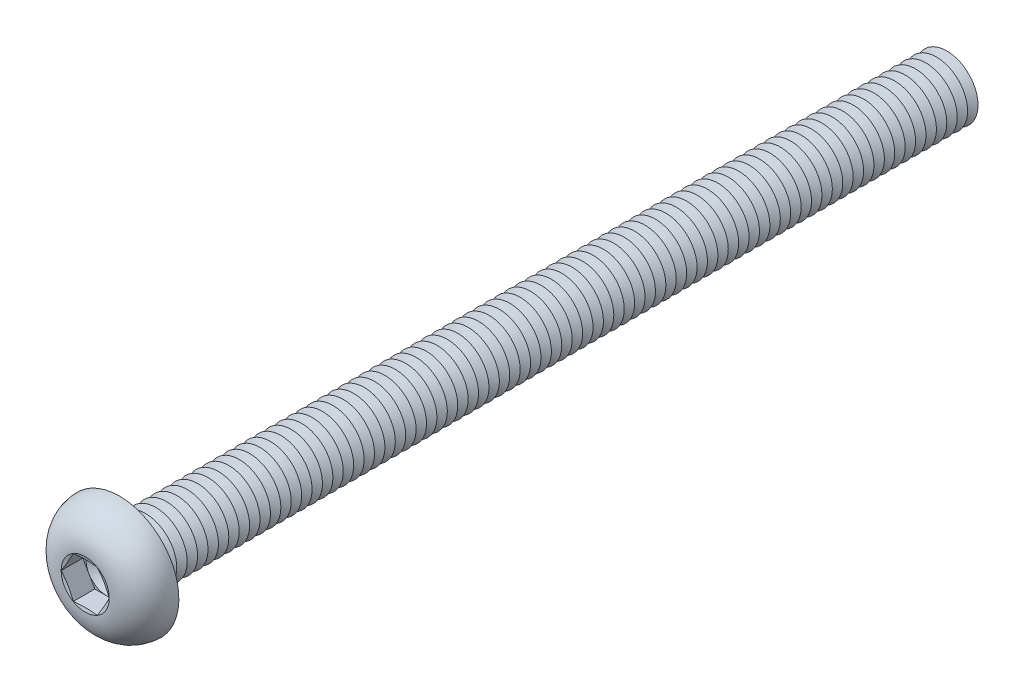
ISO-10303-21;
HEADER;
FILE_DESCRIPTION(('STEP AP214'),'2;1');
FILE_NAME('part.step','',(''),(''),'','','');
FILE_SCHEMA(('AUTOMOTIVE_DESIGN { 1 0 10303 214 1 1 1 1 }'));
ENDSEC;
DATA;
#1=APPLICATION_CONTEXT('core data for automotive mechanical design processes');
#2=APPLICATION_PROTOCOL_DEFINITION('international standard','automotive_design',2000,#1);
#3=PRODUCT_CONTEXT('',#1,'mechanical');
#4=PRODUCT('Part','Part','',(#3));
#5=PRODUCT_RELATED_PRODUCT_CATEGORY('part','',(#4));
#6=PRODUCT_DEFINITION_FORMATION('','',#4);
#7=PRODUCT_DEFINITION_CONTEXT('part definition',#1,'design');
#8=PRODUCT_DEFINITION('design','',#6,#7);
#9=PRODUCT_DEFINITION_SHAPE('','',#8);
#10=(LENGTH_UNIT() NAMED_UNIT(*) SI_UNIT(.MILLI.,.METRE.));
#11=(NAMED_UNIT(*) PLANE_ANGLE_UNIT() SI_UNIT($,.RADIAN.));
#12=(NAMED_UNIT(*) SI_UNIT($,.STERADIAN.) SOLID_ANGLE_UNIT());
#13=UNCERTAINTY_MEASURE_WITH_UNIT(LENGTH_MEASURE(1.E-05),#10,'distance_accuracy_value','');
#14=(GEOMETRIC_REPRESENTATION_CONTEXT(3) GLOBAL_UNCERTAINTY_ASSIGNED_CONTEXT((#13)) GLOBAL_UNIT_ASSIGNED_CONTEXT((#10,
#11,#12)) REPRESENTATION_CONTEXT('',''));
#15=CARTESIAN_POINT('',(0.,0.,0.));
#16=DIRECTION('',(0.,0.,1.));
#17=DIRECTION('',(1.,0.,0.));
#18=AXIS2_PLACEMENT_3D('',#15,#16,#17);
#19=CARTESIAN_POINT('',(0.,0.,0.609999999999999));
#20=DIRECTION('',(0.,0.,1.));
#21=DIRECTION('',(1.,0.,0.));
#22=AXIS2_PLACEMENT_3D('',#19,#20,#21);
#23=PLANE('',#22);
#24=CARTESIAN_POINT('',(0.,0.,0.609999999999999));
#25=DIRECTION('',(0.,0.,1.));
#26=DIRECTION('',(1.,0.,0.));
#27=AXIS2_PLACEMENT_3D('',#24,#25,#26);
#28=CIRCLE('',#27,0.999999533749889);
#29=CARTESIAN_POINT('',(0.866024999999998,0.499999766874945,0.609999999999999));
#30=VERTEX_POINT('',#29);
#31=CARTESIAN_POINT('',(0.,0.999999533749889,0.609999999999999));
#32=VERTEX_POINT('',#31);
#33=EDGE_CURVE('E118',#30,#32,#28,.T.);
#34=ORIENTED_EDGE('',*,*,#33,.F.);
#35=DIRECTION('',(-0.500000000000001,0.866025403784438,0.));
#36=VECTOR('',#35,1.);
#37=CARTESIAN_POINT('',(1.1547,0.,0.609999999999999));
#38=LINE('',#37,#36);
#39=CARTESIAN_POINT('',(0.577349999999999,0.999999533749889,0.609999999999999));
#40=VERTEX_POINT('',#39);
#41=EDGE_CURVE('E125',#30,#40,#38,.T.);
#42=ORIENTED_EDGE('',*,*,#41,.T.);
#43=DIRECTION('',(-1.,0.,0.));
#44=VECTOR('',#43,1.);
#45=CARTESIAN_POINT('',(0.577349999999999,0.999999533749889,0.609999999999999));
#46=LINE('',#45,#44);
#47=EDGE_CURVE('E136',#40,#32,#46,.T.);
#48=ORIENTED_EDGE('',*,*,#47,.T.);
#49=EDGE_LOOP('',(#34,#42,#48));
#50=FACE_BOUND('',#49,.T.);
#51=ADVANCED_FACE('F39',(#50),#23,.T.);
#52=CARTESIAN_POINT('',(0.,0.,0.609999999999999));
#53=DIRECTION('',(0.,0.,1.));
#54=DIRECTION('',(1.,0.,0.));
#55=AXIS2_PLACEMENT_3D('',#52,#53,#54);
#56=CIRCLE('',#55,0.999999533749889);
#57=CARTESIAN_POINT('',(-0.866024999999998,0.499999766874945,0.609999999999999));
#58=VERTEX_POINT('',#57);
#59=EDGE_CURVE('E11',#32,#58,#56,.T.);
#60=ORIENTED_EDGE('',*,*,#59,.F.);
#61=CARTESIAN_POINT('',(-0.577350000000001,0.999999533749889,0.609999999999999));
#62=VERTEX_POINT('',#61);
#63=EDGE_CURVE('E131',#32,#62,#46,.T.);
#64=ORIENTED_EDGE('',*,*,#63,.T.);
#65=DIRECTION('',(-0.5,-0.866025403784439,0.));
#66=VECTOR('',#65,1.);
#67=CARTESIAN_POINT('',(-0.577350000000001,0.999999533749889,0.609999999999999));
#68=LINE('',#67,#66);
#69=EDGE_CURVE('E134',#62,#58,#68,.T.);
#70=ORIENTED_EDGE('',*,*,#69,.T.);
#71=EDGE_LOOP('',(#60,#64,#70));
#72=FACE_BOUND('',#71,.T.);
#73=ADVANCED_FACE('F130',(#72),#23,.T.);
#74=CARTESIAN_POINT('',(-0.866024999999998,-0.499999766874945,0.609999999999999));
#75=VERTEX_POINT('',#74);
#76=EDGE_CURVE('E49',#58,#75,#56,.T.);
#77=ORIENTED_EDGE('',*,*,#76,.F.);
#78=CARTESIAN_POINT('',(-1.1547,0.,0.609999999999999));
#79=VERTEX_POINT('',#78);
#80=EDGE_CURVE('E143',#58,#79,#68,.T.);
#81=ORIENTED_EDGE('',*,*,#80,.T.);
#82=DIRECTION('',(0.5,-0.866025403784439,0.));
#83=VECTOR('',#82,1.);
#84=CARTESIAN_POINT('',(-1.1547,0.,0.609999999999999));
#85=LINE('',#84,#83);
#86=EDGE_CURVE('E152',#79,#75,#85,.T.);
#87=ORIENTED_EDGE('',*,*,#86,.T.);
#88=EDGE_LOOP('',(#77,#81,#87));
#89=FACE_BOUND('',#88,.T.);
#90=ADVANCED_FACE('F908',(#89),#23,.T.);
#91=CARTESIAN_POINT('',(0.,-0.999999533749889,0.609999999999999));
#92=VERTEX_POINT('',#91);
#93=EDGE_CURVE('E892',#75,#92,#56,.T.);
#94=ORIENTED_EDGE('',*,*,#93,.F.);
#95=CARTESIAN_POINT('',(-0.577349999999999,-0.999999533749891,0.609999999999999));
#96=VERTEX_POINT('',#95);
#97=EDGE_CURVE('E151',#75,#96,#85,.T.);
#98=ORIENTED_EDGE('',*,*,#97,.T.);
#99=DIRECTION('',(1.,0.,0.));
#100=VECTOR('',#99,1.);
#101=CARTESIAN_POINT('',(-0.577349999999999,-0.999999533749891,0.609999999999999));
#102=LINE('',#101,#100);
#103=EDGE_CURVE('E157',#96,#92,#102,.T.);
#104=ORIENTED_EDGE('',*,*,#103,.T.);
#105=EDGE_LOOP('',(#94,#98,#104));
#106=FACE_BOUND('',#105,.T.);
#107=ADVANCED_FACE('F901',(#106),#23,.T.);
#108=CARTESIAN_POINT('',(0.866024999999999,-0.499999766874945,0.609999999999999));
#109=VERTEX_POINT('',#108);
#110=EDGE_CURVE('E56',#92,#109,#56,.T.);
#111=ORIENTED_EDGE('',*,*,#110,.F.);
#112=CARTESIAN_POINT('',(0.577349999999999,-0.999999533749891,0.609999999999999));
#113=VERTEX_POINT('',#112);
#114=EDGE_CURVE('E156',#92,#113,#102,.T.);
#115=ORIENTED_EDGE('',*,*,#114,.T.);
#116=DIRECTION('',(0.5,0.866025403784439,0.));
#117=VECTOR('',#116,1.);
#118=CARTESIAN_POINT('',(0.577349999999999,-0.999999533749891,0.609999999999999));
#119=LINE('',#118,#117);
#120=EDGE_CURVE('E162',#113,#109,#119,.T.);
#121=ORIENTED_EDGE('',*,*,#120,.T.);
#122=EDGE_LOOP('',(#111,#115,#121));
#123=FACE_BOUND('',#122,.T.);
#124=ADVANCED_FACE('F979',(#123),#23,.T.);
#125=CARTESIAN_POINT('',(0.,0.,1.65));
#126=DIRECTION('',(0.,0.,1.));
#127=DIRECTION('',(0.,-1.,0.));
#128=AXIS2_PLACEMENT_3D('',#125,#126,#127);
#129=CONICAL_SURFACE('',#128,1.1547,1.30899693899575);
#130=CARTESIAN_POINT('',(1.15481547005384,-0.000199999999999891,1.65003094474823));
#131=CARTESIAN_POINT('',(1.13083002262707,0.0413440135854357,1.64359970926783));
#132=CARTESIAN_POINT('',(1.10680107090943,0.0829633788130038,1.63776108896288));
#133=CARTESIAN_POINT('',(1.05865826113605,0.166349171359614,1.62750303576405));
#134=CARTESIAN_POINT('',(1.03454437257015,0.208115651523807,1.62308418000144));
#135=CARTESIAN_POINT('',(0.986377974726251,0.291542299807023,1.61592375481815));
#136=CARTESIAN_POINT('',(0.962325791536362,0.333201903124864,1.61317364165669));
#137=CARTESIAN_POINT('',(0.914190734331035,0.416574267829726,1.60948600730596));
#138=CARTESIAN_POINT('',(0.890107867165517,0.458287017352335,1.60854813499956));
#139=CARTESIAN_POINT('',(0.841942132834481,0.541712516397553,1.60854813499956));
#140=CARTESIAN_POINT('',(0.817859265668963,0.583425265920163,1.60948600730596));
#141=CARTESIAN_POINT('',(0.769724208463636,0.666797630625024,1.61317364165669));
#142=CARTESIAN_POINT('',(0.745672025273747,0.708457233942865,1.61592375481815));
#143=CARTESIAN_POINT('',(0.697505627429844,0.791883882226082,1.62308418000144));
#144=CARTESIAN_POINT('',(0.673391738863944,0.833650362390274,1.62750303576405));
#145=CARTESIAN_POINT('',(0.625248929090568,0.917036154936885,1.63776108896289));
#146=CARTESIAN_POINT('',(0.60121997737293,0.958655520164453,1.64359970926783));
#147=CARTESIAN_POINT('',(0.577234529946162,1.00019953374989,1.65003094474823));
#148=B_SPLINE_CURVE_WITH_KNOTS('',3,(#130,#131,#132,#133,#134,#135,#136,#137,#138,#139,#140,
#141,#142,#143,#144,#145,#146,#147),.UNSPECIFIED.,.F.,.F.,(4,2,2,2,2,2,2,2,4),(0.,
0.145207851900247,0.290474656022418,0.434991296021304,0.579479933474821,0.723968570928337,
0.868485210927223,1.01375201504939,1.15895986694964),.UNSPECIFIED.);
#149=CARTESIAN_POINT('',(1.1547,0.,1.65));
#150=VERTEX_POINT('',#149);
#151=CARTESIAN_POINT('',(0.57735,0.99999953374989,1.65));
#152=VERTEX_POINT('',#151);
#153=EDGE_CURVE('E219',#150,#152,#148,.T.);
#154=ORIENTED_EDGE('',*,*,#153,.F.);
#155=CARTESIAN_POINT('',(0.,0.,1.65));
#156=DIRECTION('',(0.,0.,-1.));
#157=DIRECTION('',(0.,1.,0.));
#158=AXIS2_PLACEMENT_3D('',#155,#156,#157);
#159=CIRCLE('',#158,1.1547);
#160=EDGE_CURVE('E875',#152,#150,#159,.T.);
#161=ORIENTED_EDGE('',*,*,#160,.F.);
#162=EDGE_LOOP('',(#154,#161));
#163=FACE_BOUND('',#162,.T.);
#164=ADVANCED_FACE('F983',(#163),#129,.F.);
#165=CARTESIAN_POINT('',(0.577234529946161,-1.00019953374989,1.65003094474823));
#166=CARTESIAN_POINT('',(0.60121997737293,-0.958655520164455,1.64359970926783));
#167=CARTESIAN_POINT('',(0.625248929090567,-0.917036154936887,1.63776108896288));
#168=CARTESIAN_POINT('',(0.673391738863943,-0.833650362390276,1.62750303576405));
#169=CARTESIAN_POINT('',(0.697505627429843,-0.791883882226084,1.62308418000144));
#170=CARTESIAN_POINT('',(0.745672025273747,-0.708457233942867,1.61592375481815));
#171=CARTESIAN_POINT('',(0.769724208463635,-0.666797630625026,1.61317364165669));
#172=CARTESIAN_POINT('',(0.817859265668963,-0.583425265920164,1.60948600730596));
#173=CARTESIAN_POINT('',(0.841942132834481,-0.541712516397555,1.60854813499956));
#174=CARTESIAN_POINT('',(0.890107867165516,-0.458287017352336,1.60854813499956));
#175=CARTESIAN_POINT('',(0.914190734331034,-0.416574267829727,1.60948600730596));
#176=CARTESIAN_POINT('',(0.962325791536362,-0.333201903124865,1.61317364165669));
#177=CARTESIAN_POINT('',(0.986377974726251,-0.291542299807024,1.61592375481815));
#178=CARTESIAN_POINT('',(1.03454437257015,-0.208115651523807,1.62308418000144));
#179=CARTESIAN_POINT('',(1.05865826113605,-0.166349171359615,1.62750303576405));
#180=CARTESIAN_POINT('',(1.10680107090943,-0.082963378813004,1.63776108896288));
#181=CARTESIAN_POINT('',(1.13083002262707,-0.0413440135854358,1.64359970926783));
#182=CARTESIAN_POINT('',(1.15481547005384,0.00019999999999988,1.65003094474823));
#183=B_SPLINE_CURVE_WITH_KNOTS('',3,(#165,#166,#167,#168,#169,#170,#171,#172,#173,#174,#175,
#176,#177,#178,#179,#180,#181,#182),.UNSPECIFIED.,.F.,.F.,(4,2,2,2,2,2,2,2,4),(0.,
0.145207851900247,0.290474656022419,0.434991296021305,0.579479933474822,0.723968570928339,
0.868485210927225,1.0137520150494,1.15895986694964),.UNSPECIFIED.);
#184=CARTESIAN_POINT('',(0.577349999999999,-0.999999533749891,1.65));
#185=VERTEX_POINT('',#184);
#186=EDGE_CURVE('E228',#185,#150,#183,.T.);
#187=ORIENTED_EDGE('',*,*,#186,.F.);
#188=EDGE_CURVE('E880',#150,#185,#159,.T.);
#189=ORIENTED_EDGE('',*,*,#188,.F.);
#190=EDGE_LOOP('',(#187,#189));
#191=FACE_BOUND('',#190,.T.);
#192=ADVANCED_FACE('F944',(#191),#129,.F.);
#193=CARTESIAN_POINT('',(-1.7425668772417,-0.999999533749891,1.87893949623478));
#194=CARTESIAN_POINT('',(-1.65819693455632,-0.999999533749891,1.85935934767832));
#195=CARTESIAN_POINT('',(-1.57375647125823,-0.999999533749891,1.84006351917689));
#196=CARTESIAN_POINT('',(-1.40464514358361,-0.999999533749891,1.80242908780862));
#197=CARTESIAN_POINT('',(-1.31997423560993,-0.999999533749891,1.78409068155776));
#198=CARTESIAN_POINT('',(-1.14955192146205,-0.999999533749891,1.74860242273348));
#199=CARTESIAN_POINT('',(-1.06379782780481,-0.999999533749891,1.73146532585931));
#200=CARTESIAN_POINT('',(-0.891887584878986,-0.999999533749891,1.69925819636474));
#201=CARTESIAN_POINT('',(-0.805731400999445,-0.999999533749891,1.68418834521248));
#202=CARTESIAN_POINT('',(-0.635256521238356,-0.999999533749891,1.65751615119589));
#203=CARTESIAN_POINT('',(-0.550951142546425,-0.999999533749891,1.64583105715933));
#204=CARTESIAN_POINT('',(-0.381865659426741,-0.999999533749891,1.62668811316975));
#205=CARTESIAN_POINT('',(-0.297085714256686,-0.999999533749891,1.61922892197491));
#206=CARTESIAN_POINT('',(-0.127577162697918,-0.999999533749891,1.60981453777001));
#207=CARTESIAN_POINT('',(-0.0428499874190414,-0.999999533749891,1.60783514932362));
#208=CARTESIAN_POINT('',(0.126542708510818,-0.999999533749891,1.60973012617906));
#209=CARTESIAN_POINT('',(0.211208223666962,-0.999999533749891,1.61360496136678));
#210=CARTESIAN_POINT('',(0.356115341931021,-0.999999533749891,1.62460226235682));
#211=CARTESIAN_POINT('',(0.416458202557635,-0.999999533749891,1.63048841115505));
#212=CARTESIAN_POINT('',(0.536893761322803,-0.999999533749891,1.64437752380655));
#213=CARTESIAN_POINT('',(0.596986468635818,-0.999999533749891,1.65238040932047));
#214=CARTESIAN_POINT('',(0.777275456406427,-0.999999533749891,1.67888855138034));
#215=CARTESIAN_POINT('',(0.897104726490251,-0.999999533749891,1.69985858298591));
#216=CARTESIAN_POINT('',(1.07751611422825,-0.999999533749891,1.73433574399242));
#217=CARTESIAN_POINT('',(1.1383777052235,-0.999999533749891,1.74646914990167));
#218=CARTESIAN_POINT('',(1.25994955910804,-0.999999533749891,1.7714845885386));
#219=CARTESIAN_POINT('',(1.32065982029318,-0.999999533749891,1.78436662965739));
#220=CARTESIAN_POINT('',(1.44162663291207,-0.999999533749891,1.81062164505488));
#221=CARTESIAN_POINT('',(1.50188385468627,-0.999999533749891,1.82399156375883));
#222=CARTESIAN_POINT('',(1.62229550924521,-0.999999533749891,1.85116781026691));
#223=CARTESIAN_POINT('',(1.68244994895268,-0.999999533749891,1.86497410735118));
#224=CARTESIAN_POINT('',(1.7425668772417,-0.999999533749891,1.87893949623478));
#225=B_SPLINE_CURVE_WITH_KNOTS('',3,(#193,#194,#195,#196,#197,#198,#199,#200,#201,#202,#203,
#204,#205,#206,#207,#208,#209,#210,#211,#212,#213,#214,#215,#216,#217,#218,#219,#220,#221,#222,
#223,#224),.UNSPECIFIED.,.F.,.F.,(4,2,2,2,2,2,2,2,2,2,2,2,2,2,2,4),(0.,0.259842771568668,
0.519738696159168,0.782071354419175,1.04442702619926,1.29968778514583,1.55486748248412,
1.80891865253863,2.06299021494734,2.24483732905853,2.42667771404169,2.79149503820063,
2.97767344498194,3.16385393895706,3.34902052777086,3.53417411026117),.UNSPECIFIED.);
#226=CARTESIAN_POINT('',(-0.577349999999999,-0.999999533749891,1.65));
#227=VERTEX_POINT('',#226);
#228=EDGE_CURVE('E922',#227,#185,#225,.T.);
#229=ORIENTED_EDGE('',*,*,#228,.F.);
#230=EDGE_CURVE('E935',#185,#227,#159,.T.);
#231=ORIENTED_EDGE('',*,*,#230,.F.);
#232=EDGE_LOOP('',(#229,#231));
#233=FACE_BOUND('',#232,.T.);
#234=ADVANCED_FACE('F950',(#233),#129,.F.);
#235=CARTESIAN_POINT('',(-1.15481547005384,0.000199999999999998,1.65003094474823));
#236=CARTESIAN_POINT('',(-1.13083002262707,-0.0413440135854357,1.64359970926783));
#237=CARTESIAN_POINT('',(-1.10680107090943,-0.0829633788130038,1.63776108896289));
#238=CARTESIAN_POINT('',(-1.05865826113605,-0.166349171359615,1.62750303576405));
#239=CARTESIAN_POINT('',(-1.03454437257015,-0.208115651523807,1.62308418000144));
#240=CARTESIAN_POINT('',(-0.986377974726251,-0.291542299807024,1.61592375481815));
#241=CARTESIAN_POINT('',(-0.962325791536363,-0.333201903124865,1.61317364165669));
#242=CARTESIAN_POINT('',(-0.914190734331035,-0.416574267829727,1.60948600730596));
#243=CARTESIAN_POINT('',(-0.890107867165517,-0.458287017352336,1.60854813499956));
#244=CARTESIAN_POINT('',(-0.841942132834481,-0.541712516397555,1.60854813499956));
#245=CARTESIAN_POINT('',(-0.817859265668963,-0.583425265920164,1.60948600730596));
#246=CARTESIAN_POINT('',(-0.769724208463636,-0.666797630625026,1.61317364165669));
#247=CARTESIAN_POINT('',(-0.745672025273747,-0.708457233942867,1.61592375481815));
#248=CARTESIAN_POINT('',(-0.697505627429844,-0.791883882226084,1.62308418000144));
#249=CARTESIAN_POINT('',(-0.673391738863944,-0.833650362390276,1.62750303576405));
#250=CARTESIAN_POINT('',(-0.625248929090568,-0.917036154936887,1.63776108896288));
#251=CARTESIAN_POINT('',(-0.60121997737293,-0.958655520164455,1.64359970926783));
#252=CARTESIAN_POINT('',(-0.577234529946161,-1.00019953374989,1.65003094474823));
#253=B_SPLINE_CURVE_WITH_KNOTS('',3,(#235,#236,#237,#238,#239,#240,#241,#242,#243,#244,#245,
#246,#247,#248,#249,#250,#251,#252),.UNSPECIFIED.,.F.,.F.,(4,2,2,2,2,2,2,2,4),(0.,
0.145207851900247,0.290474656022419,0.434991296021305,0.579479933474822,0.723968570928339,
0.868485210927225,1.0137520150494,1.15895986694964),.UNSPECIFIED.);
#254=CARTESIAN_POINT('',(-1.1547,0.,1.65));
#255=VERTEX_POINT('',#254);
#256=EDGE_CURVE('E913',#255,#227,#253,.T.);
#257=ORIENTED_EDGE('',*,*,#256,.F.);
#258=EDGE_CURVE('E919',#227,#255,#159,.T.);
#259=ORIENTED_EDGE('',*,*,#258,.F.);
#260=EDGE_LOOP('',(#257,#259));
#261=FACE_BOUND('',#260,.T.);
#262=ADVANCED_FACE('F917',(#261),#129,.F.);
#263=CARTESIAN_POINT('',(-0.577234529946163,1.00019953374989,1.65003094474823));
#264=CARTESIAN_POINT('',(-0.601219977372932,0.958655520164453,1.64359970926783));
#265=CARTESIAN_POINT('',(-0.625248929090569,0.917036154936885,1.63776108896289));
#266=CARTESIAN_POINT('',(-0.673391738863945,0.833650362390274,1.62750303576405));
#267=CARTESIAN_POINT('',(-0.697505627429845,0.791883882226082,1.62308418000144));
#268=CARTESIAN_POINT('',(-0.745672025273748,0.708457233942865,1.61592375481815));
#269=CARTESIAN_POINT('',(-0.769724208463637,0.666797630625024,1.61317364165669));
#270=CARTESIAN_POINT('',(-0.817859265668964,0.583425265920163,1.60948600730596));
#271=CARTESIAN_POINT('',(-0.841942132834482,0.541712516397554,1.60854813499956));
#272=CARTESIAN_POINT('',(-0.890107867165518,0.458287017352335,1.60854813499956));
#273=CARTESIAN_POINT('',(-0.914190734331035,0.416574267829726,1.60948600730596));
#274=CARTESIAN_POINT('',(-0.962325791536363,0.333201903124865,1.61317364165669));
#275=CARTESIAN_POINT('',(-0.986377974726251,0.291542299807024,1.61592375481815));
#276=CARTESIAN_POINT('',(-1.03454437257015,0.208115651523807,1.62308418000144));
#277=CARTESIAN_POINT('',(-1.05865826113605,0.166349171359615,1.62750303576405));
#278=CARTESIAN_POINT('',(-1.10680107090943,0.082963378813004,1.63776108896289));
#279=CARTESIAN_POINT('',(-1.13083002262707,0.041344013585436,1.64359970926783));
#280=CARTESIAN_POINT('',(-1.15481547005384,-0.000199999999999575,1.65003094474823));
#281=B_SPLINE_CURVE_WITH_KNOTS('',3,(#263,#264,#265,#266,#267,#268,#269,#270,#271,#272,#273,
#274,#275,#276,#277,#278,#279,#280),.UNSPECIFIED.,.F.,.F.,(4,2,2,2,2,2,2,2,4),(0.,
0.145207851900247,0.290474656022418,0.434991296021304,0.57947993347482,0.723968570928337,
0.868485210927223,1.01375201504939,1.15895986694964),.UNSPECIFIED.);
#282=CARTESIAN_POINT('',(-0.577350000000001,0.999999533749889,1.65));
#283=VERTEX_POINT('',#282);
#284=EDGE_CURVE('E193',#283,#255,#281,.T.);
#285=ORIENTED_EDGE('',*,*,#284,.F.);
#286=EDGE_CURVE('E925',#255,#283,#159,.T.);
#287=ORIENTED_EDGE('',*,*,#286,.F.);
#288=EDGE_LOOP('',(#285,#287));
#289=FACE_BOUND('',#288,.T.);
#290=ADVANCED_FACE('F926',(#289),#129,.F.);
#291=CARTESIAN_POINT('',(0.,0.,-38.25));
#292=DIRECTION('',(0.,0.,1.));
#293=DIRECTION('',(0.,-1.,0.));
#294=AXIS2_PLACEMENT_3D('',#291,#292,#293);
#295=CONICAL_SURFACE('',#294,1.49999999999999,1.0471975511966);
#296=CARTESIAN_POINT('',(0.,0.,-38.5));
#297=DIRECTION('',(0.,0.,1.));
#298=DIRECTION('',(0.,-1.,0.));
#299=AXIS2_PLACEMENT_3D('',#296,#297,#298);
#300=CIRCLE('',#299,1.06698729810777);
#301=CARTESIAN_POINT('',(0.,-1.06698729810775,-38.5));
#302=VERTEX_POINT('',#301);
#303=EDGE_CURVE('E846',#302,#302,#300,.T.);
#304=ORIENTED_EDGE('',*,*,#303,.T.);
#305=EDGE_LOOP('',(#304));
#306=FACE_BOUND('',#305,.T.);
#307=CARTESIAN_POINT('',(0.,0.,-38.25));
#308=DIRECTION('',(0.,0.,1.));
#309=DIRECTION('',(0.,-1.,0.));
#310=AXIS2_PLACEMENT_3D('',#307,#308,#309);
#311=CIRCLE('',#310,1.49999999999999);
#312=CARTESIAN_POINT('',(0.,-1.49999999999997,-38.25));
#313=VERTEX_POINT('',#312);
#314=EDGE_CURVE('E842',#313,#313,#311,.T.);
#315=ORIENTED_EDGE('',*,*,#314,.F.);
#316=EDGE_LOOP('',(#315));
#317=FACE_BOUND('',#316,.T.);
#318=ADVANCED_FACE('F1008',(#306,#317),#295,.T.);
#319=CARTESIAN_POINT('',(0.,0.,-38.5));
#320=DIRECTION('',(0.,0.,-1.));
#321=DIRECTION('',(0.,1.,0.));
#322=AXIS2_PLACEMENT_3D('',#319,#320,#321);
#323=CONICAL_SURFACE('',#322,1.06698729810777,1.0471975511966);
#324=CARTESIAN_POINT('',(0.,0.,-38.75));
#325=DIRECTION('',(0.,0.,1.));
#326=DIRECTION('',(0.,-1.,0.));
#327=AXIS2_PLACEMENT_3D('',#324,#325,#326);
#328=CIRCLE('',#327,1.49999999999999);
#329=CARTESIAN_POINT('',(0.,-1.49999999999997,-38.75));
#330=VERTEX_POINT('',#329);
#331=EDGE_CURVE('E850',#330,#330,#328,.T.);
#332=ORIENTED_EDGE('',*,*,#331,.T.);
#333=EDGE_LOOP('',(#332));
#334=FACE_BOUND('',#333,.T.);
#335=ORIENTED_EDGE('',*,*,#303,.F.);
#336=EDGE_LOOP('',(#335));
#337=FACE_BOUND('',#336,.T.);
#338=ADVANCED_FACE('F1013',(#334,#337),#323,.T.);
#339=CARTESIAN_POINT('',(0.,1.5,-40.));
#340=DIRECTION('',(0.,0.,-1.));
#341=DIRECTION('',(0.,1.,0.));
#342=AXIS2_PLACEMENT_3D('',#339,#340,#341);
#343=PLANE('',#342);
#344=CARTESIAN_POINT('',(0.,0.,-40.));
#345=DIRECTION('',(0.,0.,1.));
#346=DIRECTION('',(0.,-1.,0.));
#347=AXIS2_PLACEMENT_3D('',#344,#345,#346);
#348=CIRCLE('',#347,1.06698729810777);
#349=CARTESIAN_POINT('',(0.,-1.06698729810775,-40.));
#350=VERTEX_POINT('',#349);
#351=EDGE_CURVE('E870',#350,#350,#348,.T.);
#352=ORIENTED_EDGE('',*,*,#351,.F.);
#353=EDGE_LOOP('',(#352));
#354=FACE_BOUND('',#353,.T.);
#355=ADVANCED_FACE('F1180',(#354),#343,.T.);
#356=CARTESIAN_POINT('',(0.,0.,-39.75));
#357=DIRECTION('',(0.,0.,1.));
#358=DIRECTION('',(0.,-1.,0.));
#359=AXIS2_PLACEMENT_3D('',#356,#357,#358);
#360=CONICAL_SURFACE('',#359,1.49999999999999,1.0471975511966);
#361=ORIENTED_EDGE('',*,*,#351,.T.);
#362=EDGE_LOOP('',(#361));
#363=FACE_BOUND('',#362,.T.);
#364=CARTESIAN_POINT('',(0.,0.,-39.75));
#365=DIRECTION('',(0.,0.,1.));
#366=DIRECTION('',(0.,-1.,0.));
#367=AXIS2_PLACEMENT_3D('',#364,#365,#366);
#368=CIRCLE('',#367,1.49999999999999);
#369=CARTESIAN_POINT('',(0.,-1.49999999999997,-39.75));
#370=VERTEX_POINT('',#369);
#371=EDGE_CURVE('E866',#370,#370,#368,.T.);
#372=ORIENTED_EDGE('',*,*,#371,.F.);
#373=EDGE_LOOP('',(#372));
#374=FACE_BOUND('',#373,.T.);
#375=ADVANCED_FACE('F1173',(#363,#374),#360,.T.);
#376=CARTESIAN_POINT('',(0.,0.,-39.5));
#377=DIRECTION('',(0.,0.,-1.));
#378=DIRECTION('',(0.,1.,0.));
#379=AXIS2_PLACEMENT_3D('',#376,#377,#378);
#380=CONICAL_SURFACE('',#379,1.06698729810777,1.0471975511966);
#381=ORIENTED_EDGE('',*,*,#371,.T.);
#382=EDGE_LOOP('',(#381));
#383=FACE_BOUND('',#382,.T.);
#384=CARTESIAN_POINT('',(0.,0.,-39.5));
#385=DIRECTION('',(0.,0.,1.));
#386=DIRECTION('',(0.,-1.,0.));
#387=AXIS2_PLACEMENT_3D('',#384,#385,#386);
#388=CIRCLE('',#387,1.06698729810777);
#389=CARTESIAN_POINT('',(0.,-1.06698729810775,-39.5));
#390=VERTEX_POINT('',#389);
#391=EDGE_CURVE('E862',#390,#390,#388,.T.);
#392=ORIENTED_EDGE('',*,*,#391,.F.);
#393=EDGE_LOOP('',(#392));
#394=FACE_BOUND('',#393,.T.);
#395=ADVANCED_FACE('F1179',(#383,#394),#380,.T.);
#396=CARTESIAN_POINT('',(0.,0.,-39.25));
#397=DIRECTION('',(0.,0.,1.));
#398=DIRECTION('',(0.,-1.,0.));
#399=AXIS2_PLACEMENT_3D('',#396,#397,#398);
#400=CONICAL_SURFACE('',#399,1.49999999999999,1.0471975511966);
#401=ORIENTED_EDGE('',*,*,#391,.T.);
#402=EDGE_LOOP('',(#401));
#403=FACE_BOUND('',#402,.T.);
#404=CARTESIAN_POINT('',(0.,0.,-39.25));
#405=DIRECTION('',(0.,0.,1.));
#406=DIRECTION('',(0.,-1.,0.));
#407=AXIS2_PLACEMENT_3D('',#404,#405,#406);
#408=CIRCLE('',#407,1.49999999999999);
#409=CARTESIAN_POINT('',(0.,-1.49999999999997,-39.25));
#410=VERTEX_POINT('',#409);
#411=EDGE_CURVE('E858',#410,#410,#408,.T.);
#412=ORIENTED_EDGE('',*,*,#411,.F.);
#413=EDGE_LOOP('',(#412));
#414=FACE_BOUND('',#413,.T.);
#415=ADVANCED_FACE('F1211',(#403,#414),#400,.T.);
#416=CARTESIAN_POINT('',(0.,0.,-39.));
#417=DIRECTION('',(0.,0.,-1.));
#418=DIRECTION('',(0.,1.,0.));
#419=AXIS2_PLACEMENT_3D('',#416,#417,#418);
#420=CONICAL_SURFACE('',#419,1.06698729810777,1.0471975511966);
#421=ORIENTED_EDGE('',*,*,#411,.T.);
#422=EDGE_LOOP('',(#421));
#423=FACE_BOUND('',#422,.T.);
#424=CARTESIAN_POINT('',(0.,0.,-39.));
#425=DIRECTION('',(0.,0.,1.));
#426=DIRECTION('',(0.,-1.,0.));
#427=AXIS2_PLACEMENT_3D('',#424,#425,#426);
#428=CIRCLE('',#427,1.06698729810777);
#429=CARTESIAN_POINT('',(0.,-1.06698729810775,-39.));
#430=VERTEX_POINT('',#429);
#431=EDGE_CURVE('E854',#430,#430,#428,.T.);
#432=ORIENTED_EDGE('',*,*,#431,.F.);
#433=EDGE_LOOP('',(#432));
#434=FACE_BOUND('',#433,.T.);
#435=ADVANCED_FACE('F1221',(#423,#434),#420,.T.);
#436=CARTESIAN_POINT('',(0.,0.,-38.75));
#437=DIRECTION('',(0.,0.,1.));
#438=DIRECTION('',(0.,-1.,0.));
#439=AXIS2_PLACEMENT_3D('',#436,#437,#438);
#440=CONICAL_SURFACE('',#439,1.49999999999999,1.0471975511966);
#441=ORIENTED_EDGE('',*,*,#431,.T.);
#442=EDGE_LOOP('',(#441));
#443=FACE_BOUND('',#442,.T.);
#444=ORIENTED_EDGE('',*,*,#331,.F.);
#445=EDGE_LOOP('',(#444));
#446=FACE_BOUND('',#445,.T.);
#447=ADVANCED_FACE('F1231',(#443,#446),#440,.T.);
#448=CARTESIAN_POINT('',(0.,0.,-37.75));
#449=DIRECTION('',(0.,0.,1.));
#450=DIRECTION('',(0.,-1.,0.));
#451=AXIS2_PLACEMENT_3D('',#448,#449,#450);
#452=CONICAL_SURFACE('',#451,1.49999999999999,1.0471975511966);
#453=CARTESIAN_POINT('',(0.,0.,-38.));
#454=DIRECTION('',(0.,0.,1.));
#455=DIRECTION('',(0.,-1.,0.));
#456=AXIS2_PLACEMENT_3D('',#453,#454,#455);
#457=CIRCLE('',#456,1.06698729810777);
#458=CARTESIAN_POINT('',(0.,-1.06698729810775,-38.));
#459=VERTEX_POINT('',#458);
#460=EDGE_CURVE('E838',#459,#459,#457,.T.);
#461=ORIENTED_EDGE('',*,*,#460,.T.);
#462=EDGE_LOOP('',(#461));
#463=FACE_BOUND('',#462,.T.);
#464=CARTESIAN_POINT('',(0.,0.,-37.75));
#465=DIRECTION('',(0.,0.,1.));
#466=DIRECTION('',(0.,-1.,0.));
#467=AXIS2_PLACEMENT_3D('',#464,#465,#466);
#468=CIRCLE('',#467,1.49999999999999);
#469=CARTESIAN_POINT('',(0.,-1.49999999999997,-37.75));
#470=VERTEX_POINT('',#469);
#471=EDGE_CURVE('E834',#470,#470,#468,.T.);
#472=ORIENTED_EDGE('',*,*,#471,.F.);
#473=EDGE_LOOP('',(#472));
#474=FACE_BOUND('',#473,.T.);
#475=ADVANCED_FACE('F1241',(#463,#474),#452,.T.);
#476=CARTESIAN_POINT('',(0.,0.,-38.));
#477=DIRECTION('',(0.,0.,-1.));
#478=DIRECTION('',(0.,1.,0.));
#479=AXIS2_PLACEMENT_3D('',#476,#477,#478);
#480=CONICAL_SURFACE('',#479,1.06698729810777,1.0471975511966);
#481=ORIENTED_EDGE('',*,*,#314,.T.);
#482=EDGE_LOOP('',(#481));
#483=FACE_BOUND('',#482,.T.);
#484=ORIENTED_EDGE('',*,*,#460,.F.);
#485=EDGE_LOOP('',(#484));
#486=FACE_BOUND('',#485,.T.);
#487=ADVANCED_FACE('F1251',(#483,#486),#480,.T.);
#488=CARTESIAN_POINT('',(0.,0.,-37.25));
#489=DIRECTION('',(0.,0.,1.));
#490=DIRECTION('',(0.,-1.,0.));
#491=AXIS2_PLACEMENT_3D('',#488,#489,#490);
#492=CONICAL_SURFACE('',#491,1.49999999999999,1.0471975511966);
#493=CARTESIAN_POINT('',(0.,0.,-37.5));
#494=DIRECTION('',(0.,0.,1.));
#495=DIRECTION('',(0.,-1.,0.));
#496=AXIS2_PLACEMENT_3D('',#493,#494,#495);
#497=CIRCLE('',#496,1.06698729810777);
#498=CARTESIAN_POINT('',(0.,-1.06698729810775,-37.5));
#499=VERTEX_POINT('',#498);
#500=EDGE_CURVE('E830',#499,#499,#497,.T.);
#501=ORIENTED_EDGE('',*,*,#500,.T.);
#502=EDGE_LOOP('',(#501));
#503=FACE_BOUND('',#502,.T.);
#504=CARTESIAN_POINT('',(0.,0.,-37.25));
#505=DIRECTION('',(0.,0.,1.));
#506=DIRECTION('',(0.,-1.,0.));
#507=AXIS2_PLACEMENT_3D('',#504,#505,#506);
#508=CIRCLE('',#507,1.49999999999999);
#509=CARTESIAN_POINT('',(0.,-1.49999999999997,-37.25));
#510=VERTEX_POINT('',#509);
#511=EDGE_CURVE('E826',#510,#510,#508,.T.);
#512=ORIENTED_EDGE('',*,*,#511,.F.);
#513=EDGE_LOOP('',(#512));
#514=FACE_BOUND('',#513,.T.);
#515=ADVANCED_FACE('F1261',(#503,#514),#492,.T.);
#516=CARTESIAN_POINT('',(0.,0.,-37.5));
#517=DIRECTION('',(0.,0.,-1.));
#518=DIRECTION('',(0.,1.,0.));
#519=AXIS2_PLACEMENT_3D('',#516,#517,#518);
#520=CONICAL_SURFACE('',#519,1.06698729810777,1.0471975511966);
#521=ORIENTED_EDGE('',*,*,#471,.T.);
#522=EDGE_LOOP('',(#521));
#523=FACE_BOUND('',#522,.T.);
#524=ORIENTED_EDGE('',*,*,#500,.F.);
#525=EDGE_LOOP('',(#524));
#526=FACE_BOUND('',#525,.T.);
#527=ADVANCED_FACE('F1271',(#523,#526),#520,.T.);
#528=CARTESIAN_POINT('',(0.,0.,-36.75));
#529=DIRECTION('',(0.,0.,1.));
#530=DIRECTION('',(0.,-1.,0.));
#531=AXIS2_PLACEMENT_3D('',#528,#529,#530);
#532=CONICAL_SURFACE('',#531,1.49999999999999,1.0471975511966);
#533=CARTESIAN_POINT('',(0.,0.,-37.));
#534=DIRECTION('',(0.,0.,1.));
#535=DIRECTION('',(0.,-1.,0.));
#536=AXIS2_PLACEMENT_3D('',#533,#534,#535);
#537=CIRCLE('',#536,1.06698729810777);
#538=CARTESIAN_POINT('',(0.,-1.06698729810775,-37.));
#539=VERTEX_POINT('',#538);
#540=EDGE_CURVE('E822',#539,#539,#537,.T.);
#541=ORIENTED_EDGE('',*,*,#540,.T.);
#542=EDGE_LOOP('',(#541));
#543=FACE_BOUND('',#542,.T.);
#544=CARTESIAN_POINT('',(0.,0.,-36.75));
#545=DIRECTION('',(0.,0.,1.));
#546=DIRECTION('',(0.,-1.,0.));
#547=AXIS2_PLACEMENT_3D('',#544,#545,#546);
#548=CIRCLE('',#547,1.49999999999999);
#549=CARTESIAN_POINT('',(0.,-1.49999999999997,-36.75));
#550=VERTEX_POINT('',#549);
#551=EDGE_CURVE('E818',#550,#550,#548,.T.);
#552=ORIENTED_EDGE('',*,*,#551,.F.);
#553=EDGE_LOOP('',(#552));
#554=FACE_BOUND('',#553,.T.);
#555=ADVANCED_FACE('F1281',(#543,#554),#532,.T.);
#556=CARTESIAN_POINT('',(0.,0.,-37.));
#557=DIRECTION('',(0.,0.,-1.));
#558=DIRECTION('',(0.,1.,0.));
#559=AXIS2_PLACEMENT_3D('',#556,#557,#558);
#560=CONICAL_SURFACE('',#559,1.06698729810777,1.0471975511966);
#561=ORIENTED_EDGE('',*,*,#511,.T.);
#562=EDGE_LOOP('',(#561));
#563=FACE_BOUND('',#562,.T.);
#564=ORIENTED_EDGE('',*,*,#540,.F.);
#565=EDGE_LOOP('',(#564));
#566=FACE_BOUND('',#565,.T.);
#567=ADVANCED_FACE('F1291',(#563,#566),#560,.T.);
#568=CARTESIAN_POINT('',(0.,0.,-36.25));
#569=DIRECTION('',(0.,0.,1.));
#570=DIRECTION('',(0.,-1.,0.));
#571=AXIS2_PLACEMENT_3D('',#568,#569,#570);
#572=CONICAL_SURFACE('',#571,1.49999999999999,1.0471975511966);
#573=CARTESIAN_POINT('',(0.,0.,-36.5));
#574=DIRECTION('',(0.,0.,1.));
#575=DIRECTION('',(0.,-1.,0.));
#576=AXIS2_PLACEMENT_3D('',#573,#574,#575);
#577=CIRCLE('',#576,1.06698729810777);
#578=CARTESIAN_POINT('',(0.,-1.06698729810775,-36.5));
#579=VERTEX_POINT('',#578);
#580=EDGE_CURVE('E814',#579,#579,#577,.T.);
#581=ORIENTED_EDGE('',*,*,#580,.T.);
#582=EDGE_LOOP('',(#581));
#583=FACE_BOUND('',#582,.T.);
#584=CARTESIAN_POINT('',(0.,0.,-36.25));
#585=DIRECTION('',(0.,0.,1.));
#586=DIRECTION('',(0.,-1.,0.));
#587=AXIS2_PLACEMENT_3D('',#584,#585,#586);
#588=CIRCLE('',#587,1.49999999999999);
#589=CARTESIAN_POINT('',(0.,-1.49999999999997,-36.25));
#590=VERTEX_POINT('',#589);
#591=EDGE_CURVE('E810',#590,#590,#588,.T.);
#592=ORIENTED_EDGE('',*,*,#591,.F.);
#593=EDGE_LOOP('',(#592));
#594=FACE_BOUND('',#593,.T.);
#595=ADVANCED_FACE('F1301',(#583,#594),#572,.T.);
#596=CARTESIAN_POINT('',(0.,0.,-36.5));
#597=DIRECTION('',(0.,0.,-1.));
#598=DIRECTION('',(0.,1.,0.));
#599=AXIS2_PLACEMENT_3D('',#596,#597,#598);
#600=CONICAL_SURFACE('',#599,1.06698729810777,1.0471975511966);
#601=ORIENTED_EDGE('',*,*,#551,.T.);
#602=EDGE_LOOP('',(#601));
#603=FACE_BOUND('',#602,.T.);
#604=ORIENTED_EDGE('',*,*,#580,.F.);
#605=EDGE_LOOP('',(#604));
#606=FACE_BOUND('',#605,.T.);
#607=ADVANCED_FACE('F1311',(#603,#606),#600,.T.);
#608=CARTESIAN_POINT('',(0.,0.,-35.75));
#609=DIRECTION('',(0.,0.,1.));
#610=DIRECTION('',(0.,-1.,0.));
#611=AXIS2_PLACEMENT_3D('',#608,#609,#610);
#612=CONICAL_SURFACE('',#611,1.49999999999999,1.0471975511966);
#613=CARTESIAN_POINT('',(0.,0.,-36.));
#614=DIRECTION('',(0.,0.,1.));
#615=DIRECTION('',(0.,-1.,0.));
#616=AXIS2_PLACEMENT_3D('',#613,#614,#615);
#617=CIRCLE('',#616,1.06698729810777);
#618=CARTESIAN_POINT('',(0.,-1.06698729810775,-36.));
#619=VERTEX_POINT('',#618);
#620=EDGE_CURVE('E806',#619,#619,#617,.T.);
#621=ORIENTED_EDGE('',*,*,#620,.T.);
#622=EDGE_LOOP('',(#621));
#623=FACE_BOUND('',#622,.T.);
#624=CARTESIAN_POINT('',(0.,0.,-35.75));
#625=DIRECTION('',(0.,0.,1.));
#626=DIRECTION('',(0.,-1.,0.));
#627=AXIS2_PLACEMENT_3D('',#624,#625,#626);
#628=CIRCLE('',#627,1.49999999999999);
#629=CARTESIAN_POINT('',(0.,-1.49999999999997,-35.75));
#630=VERTEX_POINT('',#629);
#631=EDGE_CURVE('E802',#630,#630,#628,.T.);
#632=ORIENTED_EDGE('',*,*,#631,.F.);
#633=EDGE_LOOP('',(#632));
#634=FACE_BOUND('',#633,.T.);
#635=ADVANCED_FACE('F1321',(#623,#634),#612,.T.);
#636=CARTESIAN_POINT('',(0.,0.,-36.));
#637=DIRECTION('',(0.,0.,-1.));
#638=DIRECTION('',(0.,1.,0.));
#639=AXIS2_PLACEMENT_3D('',#636,#637,#638);
#640=CONICAL_SURFACE('',#639,1.06698729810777,1.0471975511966);
#641=ORIENTED_EDGE('',*,*,#591,.T.);
#642=EDGE_LOOP('',(#641));
#643=FACE_BOUND('',#642,.T.);
#644=ORIENTED_EDGE('',*,*,#620,.F.);
#645=EDGE_LOOP('',(#644));
#646=FACE_BOUND('',#645,.T.);
#647=ADVANCED_FACE('F1331',(#643,#646),#640,.T.);
#648=CARTESIAN_POINT('',(0.,0.,-35.25));
#649=DIRECTION('',(0.,0.,1.));
#650=DIRECTION('',(0.,-1.,0.));
#651=AXIS2_PLACEMENT_3D('',#648,#649,#650);
#652=CONICAL_SURFACE('',#651,1.49999999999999,1.0471975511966);
#653=CARTESIAN_POINT('',(0.,0.,-35.5));
#654=DIRECTION('',(0.,0.,1.));
#655=DIRECTION('',(0.,-1.,0.));
#656=AXIS2_PLACEMENT_3D('',#653,#654,#655);
#657=CIRCLE('',#656,1.06698729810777);
#658=CARTESIAN_POINT('',(0.,-1.06698729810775,-35.5));
#659=VERTEX_POINT('',#658);
#660=EDGE_CURVE('E798',#659,#659,#657,.T.);
#661=ORIENTED_EDGE('',*,*,#660,.T.);
#662=EDGE_LOOP('',(#661));
#663=FACE_BOUND('',#662,.T.);
#664=CARTESIAN_POINT('',(0.,0.,-35.25));
#665=DIRECTION('',(0.,0.,1.));
#666=DIRECTION('',(0.,-1.,0.));
#667=AXIS2_PLACEMENT_3D('',#664,#665,#666);
#668=CIRCLE('',#667,1.49999999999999);
#669=CARTESIAN_POINT('',(0.,-1.49999999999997,-35.25));
#670=VERTEX_POINT('',#669);
#671=EDGE_CURVE('E794',#670,#670,#668,.T.);
#672=ORIENTED_EDGE('',*,*,#671,.F.);
#673=EDGE_LOOP('',(#672));
#674=FACE_BOUND('',#673,.T.);
#675=ADVANCED_FACE('F1341',(#663,#674),#652,.T.);
#676=CARTESIAN_POINT('',(0.,0.,-35.5));
#677=DIRECTION('',(0.,0.,-1.));
#678=DIRECTION('',(0.,1.,0.));
#679=AXIS2_PLACEMENT_3D('',#676,#677,#678);
#680=CONICAL_SURFACE('',#679,1.06698729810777,1.0471975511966);
#681=ORIENTED_EDGE('',*,*,#631,.T.);
#682=EDGE_LOOP('',(#681));
#683=FACE_BOUND('',#682,.T.);
#684=ORIENTED_EDGE('',*,*,#660,.F.);
#685=EDGE_LOOP('',(#684));
#686=FACE_BOUND('',#685,.T.);
#687=ADVANCED_FACE('F1351',(#683,#686),#680,.T.);
#688=CARTESIAN_POINT('',(0.,0.,-34.75));
#689=DIRECTION('',(0.,0.,1.));
#690=DIRECTION('',(0.,-1.,0.));
#691=AXIS2_PLACEMENT_3D('',#688,#689,#690);
#692=CONICAL_SURFACE('',#691,1.49999999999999,1.0471975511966);
#693=CARTESIAN_POINT('',(0.,0.,-35.));
#694=DIRECTION('',(0.,0.,1.));
#695=DIRECTION('',(0.,-1.,0.));
#696=AXIS2_PLACEMENT_3D('',#693,#694,#695);
#697=CIRCLE('',#696,1.06698729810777);
#698=CARTESIAN_POINT('',(0.,-1.06698729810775,-35.));
#699=VERTEX_POINT('',#698);
#700=EDGE_CURVE('E790',#699,#699,#697,.T.);
#701=ORIENTED_EDGE('',*,*,#700,.T.);
#702=EDGE_LOOP('',(#701));
#703=FACE_BOUND('',#702,.T.);
#704=CARTESIAN_POINT('',(0.,0.,-34.75));
#705=DIRECTION('',(0.,0.,1.));
#706=DIRECTION('',(0.,-1.,0.));
#707=AXIS2_PLACEMENT_3D('',#704,#705,#706);
#708=CIRCLE('',#707,1.49999999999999);
#709=CARTESIAN_POINT('',(0.,-1.49999999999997,-34.75));
#710=VERTEX_POINT('',#709);
#711=EDGE_CURVE('E786',#710,#710,#708,.T.);
#712=ORIENTED_EDGE('',*,*,#711,.F.);
#713=EDGE_LOOP('',(#712));
#714=FACE_BOUND('',#713,.T.);
#715=ADVANCED_FACE('F1361',(#703,#714),#692,.T.);
#716=CARTESIAN_POINT('',(0.,0.,-35.));
#717=DIRECTION('',(0.,0.,-1.));
#718=DIRECTION('',(0.,1.,0.));
#719=AXIS2_PLACEMENT_3D('',#716,#717,#718);
#720=CONICAL_SURFACE('',#719,1.06698729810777,1.0471975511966);
#721=ORIENTED_EDGE('',*,*,#671,.T.);
#722=EDGE_LOOP('',(#721));
#723=FACE_BOUND('',#722,.T.);
#724=ORIENTED_EDGE('',*,*,#700,.F.);
#725=EDGE_LOOP('',(#724));
#726=FACE_BOUND('',#725,.T.);
#727=ADVANCED_FACE('F1371',(#723,#726),#720,.T.);
#728=CARTESIAN_POINT('',(0.,0.,-34.25));
#729=DIRECTION('',(0.,0.,1.));
#730=DIRECTION('',(0.,-1.,0.));
#731=AXIS2_PLACEMENT_3D('',#728,#729,#730);
#732=CONICAL_SURFACE('',#731,1.49999999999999,1.0471975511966);
#733=CARTESIAN_POINT('',(0.,0.,-34.5));
#734=DIRECTION('',(0.,0.,1.));
#735=DIRECTION('',(0.,-1.,0.));
#736=AXIS2_PLACEMENT_3D('',#733,#734,#735);
#737=CIRCLE('',#736,1.06698729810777);
#738=CARTESIAN_POINT('',(0.,-1.06698729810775,-34.5));
#739=VERTEX_POINT('',#738);
#740=EDGE_CURVE('E782',#739,#739,#737,.T.);
#741=ORIENTED_EDGE('',*,*,#740,.T.);
#742=EDGE_LOOP('',(#741));
#743=FACE_BOUND('',#742,.T.);
#744=CARTESIAN_POINT('',(0.,0.,-34.25));
#745=DIRECTION('',(0.,0.,1.));
#746=DIRECTION('',(0.,-1.,0.));
#747=AXIS2_PLACEMENT_3D('',#744,#745,#746);
#748=CIRCLE('',#747,1.49999999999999);
#749=CARTESIAN_POINT('',(0.,-1.49999999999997,-34.25));
#750=VERTEX_POINT('',#749);
#751=EDGE_CURVE('E778',#750,#750,#748,.T.);
#752=ORIENTED_EDGE('',*,*,#751,.F.);
#753=EDGE_LOOP('',(#752));
#754=FACE_BOUND('',#753,.T.);
#755=ADVANCED_FACE('F1381',(#743,#754),#732,.T.);
#756=CARTESIAN_POINT('',(0.,0.,-34.5));
#757=DIRECTION('',(0.,0.,-1.));
#758=DIRECTION('',(0.,1.,0.));
#759=AXIS2_PLACEMENT_3D('',#756,#757,#758);
#760=CONICAL_SURFACE('',#759,1.06698729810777,1.0471975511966);
#761=ORIENTED_EDGE('',*,*,#711,.T.);
#762=EDGE_LOOP('',(#761));
#763=FACE_BOUND('',#762,.T.);
#764=ORIENTED_EDGE('',*,*,#740,.F.);
#765=EDGE_LOOP('',(#764));
#766=FACE_BOUND('',#765,.T.);
#767=ADVANCED_FACE('F1391',(#763,#766),#760,.T.);
#768=CARTESIAN_POINT('',(0.,0.,-33.75));
#769=DIRECTION('',(0.,0.,1.));
#770=DIRECTION('',(0.,-1.,0.));
#771=AXIS2_PLACEMENT_3D('',#768,#769,#770);
#772=CONICAL_SURFACE('',#771,1.49999999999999,1.0471975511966);
#773=CARTESIAN_POINT('',(0.,0.,-34.));
#774=DIRECTION('',(0.,0.,1.));
#775=DIRECTION('',(0.,-1.,0.));
#776=AXIS2_PLACEMENT_3D('',#773,#774,#775);
#777=CIRCLE('',#776,1.06698729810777);
#778=CARTESIAN_POINT('',(0.,-1.06698729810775,-34.));
#779=VERTEX_POINT('',#778);
#780=EDGE_CURVE('E774',#779,#779,#777,.T.);
#781=ORIENTED_EDGE('',*,*,#780,.T.);
#782=EDGE_LOOP('',(#781));
#783=FACE_BOUND('',#782,.T.);
#784=CARTESIAN_POINT('',(0.,0.,-33.75));
#785=DIRECTION('',(0.,0.,1.));
#786=DIRECTION('',(0.,-1.,0.));
#787=AXIS2_PLACEMENT_3D('',#784,#785,#786);
#788=CIRCLE('',#787,1.49999999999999);
#789=CARTESIAN_POINT('',(0.,-1.49999999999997,-33.75));
#790=VERTEX_POINT('',#789);
#791=EDGE_CURVE('E770',#790,#790,#788,.T.);
#792=ORIENTED_EDGE('',*,*,#791,.F.);
#793=EDGE_LOOP('',(#792));
#794=FACE_BOUND('',#793,.T.);
#795=ADVANCED_FACE('F1401',(#783,#794),#772,.T.);
#796=CARTESIAN_POINT('',(0.,0.,-34.));
#797=DIRECTION('',(0.,0.,-1.));
#798=DIRECTION('',(0.,1.,0.));
#799=AXIS2_PLACEMENT_3D('',#796,#797,#798);
#800=CONICAL_SURFACE('',#799,1.06698729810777,1.0471975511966);
#801=ORIENTED_EDGE('',*,*,#751,.T.);
#802=EDGE_LOOP('',(#801));
#803=FACE_BOUND('',#802,.T.);
#804=ORIENTED_EDGE('',*,*,#780,.F.);
#805=EDGE_LOOP('',(#804));
#806=FACE_BOUND('',#805,.T.);
#807=ADVANCED_FACE('F1411',(#803,#806),#800,.T.);
#808=CARTESIAN_POINT('',(0.,0.,-33.25));
#809=DIRECTION('',(0.,0.,1.));
#810=DIRECTION('',(0.,-1.,0.));
#811=AXIS2_PLACEMENT_3D('',#808,#809,#810);
#812=CONICAL_SURFACE('',#811,1.49999999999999,1.0471975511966);
#813=CARTESIAN_POINT('',(0.,0.,-33.5));
#814=DIRECTION('',(0.,0.,1.));
#815=DIRECTION('',(0.,-1.,0.));
#816=AXIS2_PLACEMENT_3D('',#813,#814,#815);
#817=CIRCLE('',#816,1.06698729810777);
#818=CARTESIAN_POINT('',(0.,-1.06698729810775,-33.5));
#819=VERTEX_POINT('',#818);
#820=EDGE_CURVE('E766',#819,#819,#817,.T.);
#821=ORIENTED_EDGE('',*,*,#820,.T.);
#822=EDGE_LOOP('',(#821));
#823=FACE_BOUND('',#822,.T.);
#824=CARTESIAN_POINT('',(0.,0.,-33.25));
#825=DIRECTION('',(0.,0.,1.));
#826=DIRECTION('',(0.,-1.,0.));
#827=AXIS2_PLACEMENT_3D('',#824,#825,#826);
#828=CIRCLE('',#827,1.49999999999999);
#829=CARTESIAN_POINT('',(0.,-1.49999999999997,-33.25));
#830=VERTEX_POINT('',#829);
#831=EDGE_CURVE('E762',#830,#830,#828,.T.);
#832=ORIENTED_EDGE('',*,*,#831,.F.);
#833=EDGE_LOOP('',(#832));
#834=FACE_BOUND('',#833,.T.);
#835=ADVANCED_FACE('F1421',(#823,#834),#812,.T.);
#836=CARTESIAN_POINT('',(0.,0.,-33.5));
#837=DIRECTION('',(0.,0.,-1.));
#838=DIRECTION('',(0.,1.,0.));
#839=AXIS2_PLACEMENT_3D('',#836,#837,#838);
#840=CONICAL_SURFACE('',#839,1.06698729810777,1.0471975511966);
#841=ORIENTED_EDGE('',*,*,#791,.T.);
#842=EDGE_LOOP('',(#841));
#843=FACE_BOUND('',#842,.T.);
#844=ORIENTED_EDGE('',*,*,#820,.F.);
#845=EDGE_LOOP('',(#844));
#846=FACE_BOUND('',#845,.T.);
#847=ADVANCED_FACE('F1431',(#843,#846),#840,.T.);
#848=CARTESIAN_POINT('',(0.,0.,-32.75));
#849=DIRECTION('',(0.,0.,1.));
#850=DIRECTION('',(0.,-1.,0.));
#851=AXIS2_PLACEMENT_3D('',#848,#849,#850);
#852=CONICAL_SURFACE('',#851,1.49999999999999,1.0471975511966);
#853=CARTESIAN_POINT('',(0.,0.,-33.));
#854=DIRECTION('',(0.,0.,1.));
#855=DIRECTION('',(0.,-1.,0.));
#856=AXIS2_PLACEMENT_3D('',#853,#854,#855);
#857=CIRCLE('',#856,1.06698729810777);
#858=CARTESIAN_POINT('',(0.,-1.06698729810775,-33.));
#859=VERTEX_POINT('',#858);
#860=EDGE_CURVE('E758',#859,#859,#857,.T.);
#861=ORIENTED_EDGE('',*,*,#860,.T.);
#862=EDGE_LOOP('',(#861));
#863=FACE_BOUND('',#862,.T.);
#864=CARTESIAN_POINT('',(0.,0.,-32.75));
#865=DIRECTION('',(0.,0.,1.));
#866=DIRECTION('',(0.,-1.,0.));
#867=AXIS2_PLACEMENT_3D('',#864,#865,#866);
#868=CIRCLE('',#867,1.49999999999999);
#869=CARTESIAN_POINT('',(0.,-1.49999999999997,-32.75));
#870=VERTEX_POINT('',#869);
#871=EDGE_CURVE('E754',#870,#870,#868,.T.);
#872=ORIENTED_EDGE('',*,*,#871,.F.);
#873=EDGE_LOOP('',(#872));
#874=FACE_BOUND('',#873,.T.);
#875=ADVANCED_FACE('F1441',(#863,#874),#852,.T.);
#876=CARTESIAN_POINT('',(0.,0.,-33.));
#877=DIRECTION('',(0.,0.,-1.));
#878=DIRECTION('',(0.,1.,0.));
#879=AXIS2_PLACEMENT_3D('',#876,#877,#878);
#880=CONICAL_SURFACE('',#879,1.06698729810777,1.0471975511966);
#881=ORIENTED_EDGE('',*,*,#831,.T.);
#882=EDGE_LOOP('',(#881));
#883=FACE_BOUND('',#882,.T.);
#884=ORIENTED_EDGE('',*,*,#860,.F.);
#885=EDGE_LOOP('',(#884));
#886=FACE_BOUND('',#885,.T.);
#887=ADVANCED_FACE('F1451',(#883,#886),#880,.T.);
#888=CARTESIAN_POINT('',(0.,0.,-32.25));
#889=DIRECTION('',(0.,0.,1.));
#890=DIRECTION('',(0.,-1.,0.));
#891=AXIS2_PLACEMENT_3D('',#888,#889,#890);
#892=CONICAL_SURFACE('',#891,1.49999999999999,1.0471975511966);
#893=CARTESIAN_POINT('',(0.,0.,-32.5));
#894=DIRECTION('',(0.,0.,1.));
#895=DIRECTION('',(0.,-1.,0.));
#896=AXIS2_PLACEMENT_3D('',#893,#894,#895);
#897=CIRCLE('',#896,1.06698729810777);
#898=CARTESIAN_POINT('',(0.,-1.06698729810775,-32.5));
#899=VERTEX_POINT('',#898);
#900=EDGE_CURVE('E750',#899,#899,#897,.T.);
#901=ORIENTED_EDGE('',*,*,#900,.T.);
#902=EDGE_LOOP('',(#901));
#903=FACE_BOUND('',#902,.T.);
#904=CARTESIAN_POINT('',(0.,0.,-32.25));
#905=DIRECTION('',(0.,0.,1.));
#906=DIRECTION('',(0.,-1.,0.));
#907=AXIS2_PLACEMENT_3D('',#904,#905,#906);
#908=CIRCLE('',#907,1.49999999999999);
#909=CARTESIAN_POINT('',(0.,-1.49999999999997,-32.25));
#910=VERTEX_POINT('',#909);
#911=EDGE_CURVE('E746',#910,#910,#908,.T.);
#912=ORIENTED_EDGE('',*,*,#911,.F.);
#913=EDGE_LOOP('',(#912));
#914=FACE_BOUND('',#913,.T.);
#915=ADVANCED_FACE('F1461',(#903,#914),#892,.T.);
#916=CARTESIAN_POINT('',(0.,0.,-32.5));
#917=DIRECTION('',(0.,0.,-1.));
#918=DIRECTION('',(0.,1.,0.));
#919=AXIS2_PLACEMENT_3D('',#916,#917,#918);
#920=CONICAL_SURFACE('',#919,1.06698729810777,1.0471975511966);
#921=ORIENTED_EDGE('',*,*,#871,.T.);
#922=EDGE_LOOP('',(#921));
#923=FACE_BOUND('',#922,.T.);
#924=ORIENTED_EDGE('',*,*,#900,.F.);
#925=EDGE_LOOP('',(#924));
#926=FACE_BOUND('',#925,.T.);
#927=ADVANCED_FACE('F1471',(#923,#926),#920,.T.);
#928=CARTESIAN_POINT('',(0.,0.,-31.75));
#929=DIRECTION('',(0.,0.,1.));
#930=DIRECTION('',(0.,-1.,0.));
#931=AXIS2_PLACEMENT_3D('',#928,#929,#930);
#932=CONICAL_SURFACE('',#931,1.49999999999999,1.0471975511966);
#933=CARTESIAN_POINT('',(0.,0.,-32.));
#934=DIRECTION('',(0.,0.,1.));
#935=DIRECTION('',(0.,-1.,0.));
#936=AXIS2_PLACEMENT_3D('',#933,#934,#935);
#937=CIRCLE('',#936,1.06698729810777);
#938=CARTESIAN_POINT('',(0.,-1.06698729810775,-32.));
#939=VERTEX_POINT('',#938);
#940=EDGE_CURVE('E742',#939,#939,#937,.T.);
#941=ORIENTED_EDGE('',*,*,#940,.T.);
#942=EDGE_LOOP('',(#941));
#943=FACE_BOUND('',#942,.T.);
#944=CARTESIAN_POINT('',(0.,0.,-31.75));
#945=DIRECTION('',(0.,0.,1.));
#946=DIRECTION('',(0.,-1.,0.));
#947=AXIS2_PLACEMENT_3D('',#944,#945,#946);
#948=CIRCLE('',#947,1.49999999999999);
#949=CARTESIAN_POINT('',(0.,-1.49999999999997,-31.75));
#950=VERTEX_POINT('',#949);
#951=EDGE_CURVE('E738',#950,#950,#948,.T.);
#952=ORIENTED_EDGE('',*,*,#951,.F.);
#953=EDGE_LOOP('',(#952));
#954=FACE_BOUND('',#953,.T.);
#955=ADVANCED_FACE('F1481',(#943,#954),#932,.T.);
#956=CARTESIAN_POINT('',(0.,0.,-32.));
#957=DIRECTION('',(0.,0.,-1.));
#958=DIRECTION('',(0.,1.,0.));
#959=AXIS2_PLACEMENT_3D('',#956,#957,#958);
#960=CONICAL_SURFACE('',#959,1.06698729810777,1.0471975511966);
#961=ORIENTED_EDGE('',*,*,#911,.T.);
#962=EDGE_LOOP('',(#961));
#963=FACE_BOUND('',#962,.T.);
#964=ORIENTED_EDGE('',*,*,#940,.F.);
#965=EDGE_LOOP('',(#964));
#966=FACE_BOUND('',#965,.T.);
#967=ADVANCED_FACE('F1491',(#963,#966),#960,.T.);
#968=CARTESIAN_POINT('',(0.,0.,-31.25));
#969=DIRECTION('',(0.,0.,1.));
#970=DIRECTION('',(0.,-1.,0.));
#971=AXIS2_PLACEMENT_3D('',#968,#969,#970);
#972=CONICAL_SURFACE('',#971,1.49999999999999,1.0471975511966);
#973=CARTESIAN_POINT('',(0.,0.,-31.5));
#974=DIRECTION('',(0.,0.,1.));
#975=DIRECTION('',(0.,-1.,0.));
#976=AXIS2_PLACEMENT_3D('',#973,#974,#975);
#977=CIRCLE('',#976,1.06698729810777);
#978=CARTESIAN_POINT('',(0.,-1.06698729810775,-31.5));
#979=VERTEX_POINT('',#978);
#980=EDGE_CURVE('E734',#979,#979,#977,.T.);
#981=ORIENTED_EDGE('',*,*,#980,.T.);
#982=EDGE_LOOP('',(#981));
#983=FACE_BOUND('',#982,.T.);
#984=CARTESIAN_POINT('',(0.,0.,-31.25));
#985=DIRECTION('',(0.,0.,1.));
#986=DIRECTION('',(0.,-1.,0.));
#987=AXIS2_PLACEMENT_3D('',#984,#985,#986);
#988=CIRCLE('',#987,1.49999999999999);
#989=CARTESIAN_POINT('',(0.,-1.49999999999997,-31.25));
#990=VERTEX_POINT('',#989);
#991=EDGE_CURVE('E730',#990,#990,#988,.T.);
#992=ORIENTED_EDGE('',*,*,#991,.F.);
#993=EDGE_LOOP('',(#992));
#994=FACE_BOUND('',#993,.T.);
#995=ADVANCED_FACE('F1501',(#983,#994),#972,.T.);
#996=CARTESIAN_POINT('',(0.,0.,-31.5));
#997=DIRECTION('',(0.,0.,-1.));
#998=DIRECTION('',(0.,1.,0.));
#999=AXIS2_PLACEMENT_3D('',#996,#997,#998);
#1000=CONICAL_SURFACE('',#999,1.06698729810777,1.0471975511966);
#1001=ORIENTED_EDGE('',*,*,#951,.T.);
#1002=EDGE_LOOP('',(#1001));
#1003=FACE_BOUND('',#1002,.T.);
#1004=ORIENTED_EDGE('',*,*,#980,.F.);
#1005=EDGE_LOOP('',(#1004));
#1006=FACE_BOUND('',#1005,.T.);
#1007=ADVANCED_FACE('F1511',(#1003,#1006),#1000,.T.);
#1008=CARTESIAN_POINT('',(0.,0.,-30.75));
#1009=DIRECTION('',(0.,0.,1.));
#1010=DIRECTION('',(0.,-1.,0.));
#1011=AXIS2_PLACEMENT_3D('',#1008,#1009,#1010);
#1012=CONICAL_SURFACE('',#1011,1.49999999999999,1.0471975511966);
#1013=CARTESIAN_POINT('',(0.,0.,-31.));
#1014=DIRECTION('',(0.,0.,1.));
#1015=DIRECTION('',(0.,-1.,0.));
#1016=AXIS2_PLACEMENT_3D('',#1013,#1014,#1015);
#1017=CIRCLE('',#1016,1.06698729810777);
#1018=CARTESIAN_POINT('',(0.,-1.06698729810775,-31.));
#1019=VERTEX_POINT('',#1018);
#1020=EDGE_CURVE('E726',#1019,#1019,#1017,.T.);
#1021=ORIENTED_EDGE('',*,*,#1020,.T.);
#1022=EDGE_LOOP('',(#1021));
#1023=FACE_BOUND('',#1022,.T.);
#1024=CARTESIAN_POINT('',(0.,0.,-30.75));
#1025=DIRECTION('',(0.,0.,1.));
#1026=DIRECTION('',(0.,-1.,0.));
#1027=AXIS2_PLACEMENT_3D('',#1024,#1025,#1026);
#1028=CIRCLE('',#1027,1.49999999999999);
#1029=CARTESIAN_POINT('',(0.,-1.49999999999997,-30.75));
#1030=VERTEX_POINT('',#1029);
#1031=EDGE_CURVE('E722',#1030,#1030,#1028,.T.);
#1032=ORIENTED_EDGE('',*,*,#1031,.F.);
#1033=EDGE_LOOP('',(#1032));
#1034=FACE_BOUND('',#1033,.T.);
#1035=ADVANCED_FACE('F1521',(#1023,#1034),#1012,.T.);
#1036=CARTESIAN_POINT('',(0.,0.,-31.));
#1037=DIRECTION('',(0.,0.,-1.));
#1038=DIRECTION('',(0.,1.,0.));
#1039=AXIS2_PLACEMENT_3D('',#1036,#1037,#1038);
#1040=CONICAL_SURFACE('',#1039,1.06698729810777,1.0471975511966);
#1041=ORIENTED_EDGE('',*,*,#991,.T.);
#1042=EDGE_LOOP('',(#1041));
#1043=FACE_BOUND('',#1042,.T.);
#1044=ORIENTED_EDGE('',*,*,#1020,.F.);
#1045=EDGE_LOOP('',(#1044));
#1046=FACE_BOUND('',#1045,.T.);
#1047=ADVANCED_FACE('F1531',(#1043,#1046),#1040,.T.);
#1048=CARTESIAN_POINT('',(0.,0.,-30.25));
#1049=DIRECTION('',(0.,0.,1.));
#1050=DIRECTION('',(0.,-1.,0.));
#1051=AXIS2_PLACEMENT_3D('',#1048,#1049,#1050);
#1052=CONICAL_SURFACE('',#1051,1.49999999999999,1.0471975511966);
#1053=CARTESIAN_POINT('',(0.,0.,-30.5));
#1054=DIRECTION('',(0.,0.,1.));
#1055=DIRECTION('',(0.,-1.,0.));
#1056=AXIS2_PLACEMENT_3D('',#1053,#1054,#1055);
#1057=CIRCLE('',#1056,1.06698729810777);
#1058=CARTESIAN_POINT('',(0.,-1.06698729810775,-30.5));
#1059=VERTEX_POINT('',#1058);
#1060=EDGE_CURVE('E718',#1059,#1059,#1057,.T.);
#1061=ORIENTED_EDGE('',*,*,#1060,.T.);
#1062=EDGE_LOOP('',(#1061));
#1063=FACE_BOUND('',#1062,.T.);
#1064=CARTESIAN_POINT('',(0.,0.,-30.25));
#1065=DIRECTION('',(0.,0.,1.));
#1066=DIRECTION('',(0.,-1.,0.));
#1067=AXIS2_PLACEMENT_3D('',#1064,#1065,#1066);
#1068=CIRCLE('',#1067,1.49999999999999);
#1069=CARTESIAN_POINT('',(0.,-1.49999999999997,-30.25));
#1070=VERTEX_POINT('',#1069);
#1071=EDGE_CURVE('E714',#1070,#1070,#1068,.T.);
#1072=ORIENTED_EDGE('',*,*,#1071,.F.);
#1073=EDGE_LOOP('',(#1072));
#1074=FACE_BOUND('',#1073,.T.);
#1075=ADVANCED_FACE('F1541',(#1063,#1074),#1052,.T.);
#1076=CARTESIAN_POINT('',(0.,0.,-30.5));
#1077=DIRECTION('',(0.,0.,-1.));
#1078=DIRECTION('',(0.,1.,0.));
#1079=AXIS2_PLACEMENT_3D('',#1076,#1077,#1078);
#1080=CONICAL_SURFACE('',#1079,1.06698729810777,1.0471975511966);
#1081=ORIENTED_EDGE('',*,*,#1031,.T.);
#1082=EDGE_LOOP('',(#1081));
#1083=FACE_BOUND('',#1082,.T.);
#1084=ORIENTED_EDGE('',*,*,#1060,.F.);
#1085=EDGE_LOOP('',(#1084));
#1086=FACE_BOUND('',#1085,.T.);
#1087=ADVANCED_FACE('F1551',(#1083,#1086),#1080,.T.);
#1088=CARTESIAN_POINT('',(0.,0.,-29.75));
#1089=DIRECTION('',(0.,0.,1.));
#1090=DIRECTION('',(0.,-1.,0.));
#1091=AXIS2_PLACEMENT_3D('',#1088,#1089,#1090);
#1092=CONICAL_SURFACE('',#1091,1.49999999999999,1.0471975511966);
#1093=CARTESIAN_POINT('',(0.,0.,-30.));
#1094=DIRECTION('',(0.,0.,1.));
#1095=DIRECTION('',(0.,-1.,0.));
#1096=AXIS2_PLACEMENT_3D('',#1093,#1094,#1095);
#1097=CIRCLE('',#1096,1.06698729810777);
#1098=CARTESIAN_POINT('',(0.,-1.06698729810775,-30.));
#1099=VERTEX_POINT('',#1098);
#1100=EDGE_CURVE('E710',#1099,#1099,#1097,.T.);
#1101=ORIENTED_EDGE('',*,*,#1100,.T.);
#1102=EDGE_LOOP('',(#1101));
#1103=FACE_BOUND('',#1102,.T.);
#1104=CARTESIAN_POINT('',(0.,0.,-29.75));
#1105=DIRECTION('',(0.,0.,1.));
#1106=DIRECTION('',(0.,-1.,0.));
#1107=AXIS2_PLACEMENT_3D('',#1104,#1105,#1106);
#1108=CIRCLE('',#1107,1.49999999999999);
#1109=CARTESIAN_POINT('',(0.,-1.49999999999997,-29.75));
#1110=VERTEX_POINT('',#1109);
#1111=EDGE_CURVE('E706',#1110,#1110,#1108,.T.);
#1112=ORIENTED_EDGE('',*,*,#1111,.F.);
#1113=EDGE_LOOP('',(#1112));
#1114=FACE_BOUND('',#1113,.T.);
#1115=ADVANCED_FACE('F1561',(#1103,#1114),#1092,.T.);
#1116=CARTESIAN_POINT('',(0.,0.,-30.));
#1117=DIRECTION('',(0.,0.,-1.));
#1118=DIRECTION('',(0.,1.,0.));
#1119=AXIS2_PLACEMENT_3D('',#1116,#1117,#1118);
#1120=CONICAL_SURFACE('',#1119,1.06698729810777,1.0471975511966);
#1121=ORIENTED_EDGE('',*,*,#1071,.T.);
#1122=EDGE_LOOP('',(#1121));
#1123=FACE_BOUND('',#1122,.T.);
#1124=ORIENTED_EDGE('',*,*,#1100,.F.);
#1125=EDGE_LOOP('',(#1124));
#1126=FACE_BOUND('',#1125,.T.);
#1127=ADVANCED_FACE('F1571',(#1123,#1126),#1120,.T.);
#1128=CARTESIAN_POINT('',(0.,0.,-29.25));
#1129=DIRECTION('',(0.,0.,1.));
#1130=DIRECTION('',(0.,-1.,0.));
#1131=AXIS2_PLACEMENT_3D('',#1128,#1129,#1130);
#1132=CONICAL_SURFACE('',#1131,1.49999999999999,1.0471975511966);
#1133=CARTESIAN_POINT('',(0.,0.,-29.5));
#1134=DIRECTION('',(0.,0.,1.));
#1135=DIRECTION('',(0.,-1.,0.));
#1136=AXIS2_PLACEMENT_3D('',#1133,#1134,#1135);
#1137=CIRCLE('',#1136,1.06698729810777);
#1138=CARTESIAN_POINT('',(0.,-1.06698729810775,-29.5));
#1139=VERTEX_POINT('',#1138);
#1140=EDGE_CURVE('E702',#1139,#1139,#1137,.T.);
#1141=ORIENTED_EDGE('',*,*,#1140,.T.);
#1142=EDGE_LOOP('',(#1141));
#1143=FACE_BOUND('',#1142,.T.);
#1144=CARTESIAN_POINT('',(0.,0.,-29.25));
#1145=DIRECTION('',(0.,0.,1.));
#1146=DIRECTION('',(0.,-1.,0.));
#1147=AXIS2_PLACEMENT_3D('',#1144,#1145,#1146);
#1148=CIRCLE('',#1147,1.49999999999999);
#1149=CARTESIAN_POINT('',(0.,-1.49999999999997,-29.25));
#1150=VERTEX_POINT('',#1149);
#1151=EDGE_CURVE('E698',#1150,#1150,#1148,.T.);
#1152=ORIENTED_EDGE('',*,*,#1151,.F.);
#1153=EDGE_LOOP('',(#1152));
#1154=FACE_BOUND('',#1153,.T.);
#1155=ADVANCED_FACE('F1581',(#1143,#1154),#1132,.T.);
#1156=CARTESIAN_POINT('',(0.,0.,-29.5));
#1157=DIRECTION('',(0.,0.,-1.));
#1158=DIRECTION('',(0.,1.,0.));
#1159=AXIS2_PLACEMENT_3D('',#1156,#1157,#1158);
#1160=CONICAL_SURFACE('',#1159,1.06698729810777,1.0471975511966);
#1161=ORIENTED_EDGE('',*,*,#1111,.T.);
#1162=EDGE_LOOP('',(#1161));
#1163=FACE_BOUND('',#1162,.T.);
#1164=ORIENTED_EDGE('',*,*,#1140,.F.);
#1165=EDGE_LOOP('',(#1164));
#1166=FACE_BOUND('',#1165,.T.);
#1167=ADVANCED_FACE('F1591',(#1163,#1166),#1160,.T.);
#1168=CARTESIAN_POINT('',(0.,0.,-28.75));
#1169=DIRECTION('',(0.,0.,1.));
#1170=DIRECTION('',(0.,-1.,0.));
#1171=AXIS2_PLACEMENT_3D('',#1168,#1169,#1170);
#1172=CONICAL_SURFACE('',#1171,1.49999999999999,1.0471975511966);
#1173=CARTESIAN_POINT('',(0.,0.,-29.));
#1174=DIRECTION('',(0.,0.,1.));
#1175=DIRECTION('',(0.,-1.,0.));
#1176=AXIS2_PLACEMENT_3D('',#1173,#1174,#1175);
#1177=CIRCLE('',#1176,1.06698729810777);
#1178=CARTESIAN_POINT('',(0.,-1.06698729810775,-29.));
#1179=VERTEX_POINT('',#1178);
#1180=EDGE_CURVE('E694',#1179,#1179,#1177,.T.);
#1181=ORIENTED_EDGE('',*,*,#1180,.T.);
#1182=EDGE_LOOP('',(#1181));
#1183=FACE_BOUND('',#1182,.T.);
#1184=CARTESIAN_POINT('',(0.,0.,-28.75));
#1185=DIRECTION('',(0.,0.,1.));
#1186=DIRECTION('',(0.,-1.,0.));
#1187=AXIS2_PLACEMENT_3D('',#1184,#1185,#1186);
#1188=CIRCLE('',#1187,1.49999999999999);
#1189=CARTESIAN_POINT('',(0.,-1.49999999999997,-28.75));
#1190=VERTEX_POINT('',#1189);
#1191=EDGE_CURVE('E690',#1190,#1190,#1188,.T.);
#1192=ORIENTED_EDGE('',*,*,#1191,.F.);
#1193=EDGE_LOOP('',(#1192));
#1194=FACE_BOUND('',#1193,.T.);
#1195=ADVANCED_FACE('F1601',(#1183,#1194),#1172,.T.);
#1196=CARTESIAN_POINT('',(0.,0.,-29.));
#1197=DIRECTION('',(0.,0.,-1.));
#1198=DIRECTION('',(0.,1.,0.));
#1199=AXIS2_PLACEMENT_3D('',#1196,#1197,#1198);
#1200=CONICAL_SURFACE('',#1199,1.06698729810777,1.0471975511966);
#1201=ORIENTED_EDGE('',*,*,#1151,.T.);
#1202=EDGE_LOOP('',(#1201));
#1203=FACE_BOUND('',#1202,.T.);
#1204=ORIENTED_EDGE('',*,*,#1180,.F.);
#1205=EDGE_LOOP('',(#1204));
#1206=FACE_BOUND('',#1205,.T.);
#1207=ADVANCED_FACE('F1611',(#1203,#1206),#1200,.T.);
#1208=CARTESIAN_POINT('',(0.,0.,-28.25));
#1209=DIRECTION('',(0.,0.,1.));
#1210=DIRECTION('',(0.,-1.,0.));
#1211=AXIS2_PLACEMENT_3D('',#1208,#1209,#1210);
#1212=CONICAL_SURFACE('',#1211,1.49999999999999,1.0471975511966);
#1213=CARTESIAN_POINT('',(0.,0.,-28.5));
#1214=DIRECTION('',(0.,0.,1.));
#1215=DIRECTION('',(0.,-1.,0.));
#1216=AXIS2_PLACEMENT_3D('',#1213,#1214,#1215);
#1217=CIRCLE('',#1216,1.06698729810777);
#1218=CARTESIAN_POINT('',(0.,-1.06698729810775,-28.5));
#1219=VERTEX_POINT('',#1218);
#1220=EDGE_CURVE('E686',#1219,#1219,#1217,.T.);
#1221=ORIENTED_EDGE('',*,*,#1220,.T.);
#1222=EDGE_LOOP('',(#1221));
#1223=FACE_BOUND('',#1222,.T.);
#1224=CARTESIAN_POINT('',(0.,0.,-28.25));
#1225=DIRECTION('',(0.,0.,1.));
#1226=DIRECTION('',(0.,-1.,0.));
#1227=AXIS2_PLACEMENT_3D('',#1224,#1225,#1226);
#1228=CIRCLE('',#1227,1.49999999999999);
#1229=CARTESIAN_POINT('',(0.,-1.49999999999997,-28.25));
#1230=VERTEX_POINT('',#1229);
#1231=EDGE_CURVE('E682',#1230,#1230,#1228,.T.);
#1232=ORIENTED_EDGE('',*,*,#1231,.F.);
#1233=EDGE_LOOP('',(#1232));
#1234=FACE_BOUND('',#1233,.T.);
#1235=ADVANCED_FACE('F1621',(#1223,#1234),#1212,.T.);
#1236=CARTESIAN_POINT('',(0.,0.,-28.5));
#1237=DIRECTION('',(0.,0.,-1.));
#1238=DIRECTION('',(0.,1.,0.));
#1239=AXIS2_PLACEMENT_3D('',#1236,#1237,#1238);
#1240=CONICAL_SURFACE('',#1239,1.06698729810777,1.0471975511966);
#1241=ORIENTED_EDGE('',*,*,#1191,.T.);
#1242=EDGE_LOOP('',(#1241));
#1243=FACE_BOUND('',#1242,.T.);
#1244=ORIENTED_EDGE('',*,*,#1220,.F.);
#1245=EDGE_LOOP('',(#1244));
#1246=FACE_BOUND('',#1245,.T.);
#1247=ADVANCED_FACE('F1631',(#1243,#1246),#1240,.T.);
#1248=CARTESIAN_POINT('',(0.,0.,-27.75));
#1249=DIRECTION('',(0.,0.,1.));
#1250=DIRECTION('',(0.,-1.,0.));
#1251=AXIS2_PLACEMENT_3D('',#1248,#1249,#1250);
#1252=CONICAL_SURFACE('',#1251,1.49999999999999,1.0471975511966);
#1253=CARTESIAN_POINT('',(0.,0.,-28.));
#1254=DIRECTION('',(0.,0.,1.));
#1255=DIRECTION('',(0.,-1.,0.));
#1256=AXIS2_PLACEMENT_3D('',#1253,#1254,#1255);
#1257=CIRCLE('',#1256,1.06698729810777);
#1258=CARTESIAN_POINT('',(0.,-1.06698729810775,-28.));
#1259=VERTEX_POINT('',#1258);
#1260=EDGE_CURVE('E678',#1259,#1259,#1257,.T.);
#1261=ORIENTED_EDGE('',*,*,#1260,.T.);
#1262=EDGE_LOOP('',(#1261));
#1263=FACE_BOUND('',#1262,.T.);
#1264=CARTESIAN_POINT('',(0.,0.,-27.75));
#1265=DIRECTION('',(0.,0.,1.));
#1266=DIRECTION('',(0.,-1.,0.));
#1267=AXIS2_PLACEMENT_3D('',#1264,#1265,#1266);
#1268=CIRCLE('',#1267,1.49999999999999);
#1269=CARTESIAN_POINT('',(0.,-1.49999999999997,-27.75));
#1270=VERTEX_POINT('',#1269);
#1271=EDGE_CURVE('E674',#1270,#1270,#1268,.T.);
#1272=ORIENTED_EDGE('',*,*,#1271,.F.);
#1273=EDGE_LOOP('',(#1272));
#1274=FACE_BOUND('',#1273,.T.);
#1275=ADVANCED_FACE('F1641',(#1263,#1274),#1252,.T.);
#1276=CARTESIAN_POINT('',(0.,0.,-28.));
#1277=DIRECTION('',(0.,0.,-1.));
#1278=DIRECTION('',(0.,1.,0.));
#1279=AXIS2_PLACEMENT_3D('',#1276,#1277,#1278);
#1280=CONICAL_SURFACE('',#1279,1.06698729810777,1.0471975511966);
#1281=ORIENTED_EDGE('',*,*,#1231,.T.);
#1282=EDGE_LOOP('',(#1281));
#1283=FACE_BOUND('',#1282,.T.);
#1284=ORIENTED_EDGE('',*,*,#1260,.F.);
#1285=EDGE_LOOP('',(#1284));
#1286=FACE_BOUND('',#1285,.T.);
#1287=ADVANCED_FACE('F1651',(#1283,#1286),#1280,.T.);
#1288=CARTESIAN_POINT('',(0.,0.,-27.25));
#1289=DIRECTION('',(0.,0.,1.));
#1290=DIRECTION('',(0.,-1.,0.));
#1291=AXIS2_PLACEMENT_3D('',#1288,#1289,#1290);
#1292=CONICAL_SURFACE('',#1291,1.49999999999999,1.0471975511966);
#1293=CARTESIAN_POINT('',(0.,0.,-27.5));
#1294=DIRECTION('',(0.,0.,1.));
#1295=DIRECTION('',(0.,-1.,0.));
#1296=AXIS2_PLACEMENT_3D('',#1293,#1294,#1295);
#1297=CIRCLE('',#1296,1.06698729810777);
#1298=CARTESIAN_POINT('',(0.,-1.06698729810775,-27.5));
#1299=VERTEX_POINT('',#1298);
#1300=EDGE_CURVE('E670',#1299,#1299,#1297,.T.);
#1301=ORIENTED_EDGE('',*,*,#1300,.T.);
#1302=EDGE_LOOP('',(#1301));
#1303=FACE_BOUND('',#1302,.T.);
#1304=CARTESIAN_POINT('',(0.,0.,-27.25));
#1305=DIRECTION('',(0.,0.,1.));
#1306=DIRECTION('',(0.,-1.,0.));
#1307=AXIS2_PLACEMENT_3D('',#1304,#1305,#1306);
#1308=CIRCLE('',#1307,1.49999999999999);
#1309=CARTESIAN_POINT('',(0.,-1.49999999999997,-27.25));
#1310=VERTEX_POINT('',#1309);
#1311=EDGE_CURVE('E666',#1310,#1310,#1308,.T.);
#1312=ORIENTED_EDGE('',*,*,#1311,.F.);
#1313=EDGE_LOOP('',(#1312));
#1314=FACE_BOUND('',#1313,.T.);
#1315=ADVANCED_FACE('F1661',(#1303,#1314),#1292,.T.);
#1316=CARTESIAN_POINT('',(0.,0.,-27.5));
#1317=DIRECTION('',(0.,0.,-1.));
#1318=DIRECTION('',(0.,1.,0.));
#1319=AXIS2_PLACEMENT_3D('',#1316,#1317,#1318);
#1320=CONICAL_SURFACE('',#1319,1.06698729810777,1.0471975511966);
#1321=ORIENTED_EDGE('',*,*,#1271,.T.);
#1322=EDGE_LOOP('',(#1321));
#1323=FACE_BOUND('',#1322,.T.);
#1324=ORIENTED_EDGE('',*,*,#1300,.F.);
#1325=EDGE_LOOP('',(#1324));
#1326=FACE_BOUND('',#1325,.T.);
#1327=ADVANCED_FACE('F1671',(#1323,#1326),#1320,.T.);
#1328=CARTESIAN_POINT('',(0.,0.,-26.75));
#1329=DIRECTION('',(0.,0.,1.));
#1330=DIRECTION('',(0.,-1.,0.));
#1331=AXIS2_PLACEMENT_3D('',#1328,#1329,#1330);
#1332=CONICAL_SURFACE('',#1331,1.49999999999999,1.0471975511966);
#1333=CARTESIAN_POINT('',(0.,0.,-27.));
#1334=DIRECTION('',(0.,0.,1.));
#1335=DIRECTION('',(0.,-1.,0.));
#1336=AXIS2_PLACEMENT_3D('',#1333,#1334,#1335);
#1337=CIRCLE('',#1336,1.06698729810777);
#1338=CARTESIAN_POINT('',(0.,-1.06698729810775,-27.));
#1339=VERTEX_POINT('',#1338);
#1340=EDGE_CURVE('E662',#1339,#1339,#1337,.T.);
#1341=ORIENTED_EDGE('',*,*,#1340,.T.);
#1342=EDGE_LOOP('',(#1341));
#1343=FACE_BOUND('',#1342,.T.);
#1344=CARTESIAN_POINT('',(0.,0.,-26.75));
#1345=DIRECTION('',(0.,0.,1.));
#1346=DIRECTION('',(0.,-1.,0.));
#1347=AXIS2_PLACEMENT_3D('',#1344,#1345,#1346);
#1348=CIRCLE('',#1347,1.49999999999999);
#1349=CARTESIAN_POINT('',(0.,-1.49999999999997,-26.75));
#1350=VERTEX_POINT('',#1349);
#1351=EDGE_CURVE('E658',#1350,#1350,#1348,.T.);
#1352=ORIENTED_EDGE('',*,*,#1351,.F.);
#1353=EDGE_LOOP('',(#1352));
#1354=FACE_BOUND('',#1353,.T.);
#1355=ADVANCED_FACE('F1681',(#1343,#1354),#1332,.T.);
#1356=CARTESIAN_POINT('',(0.,0.,-27.));
#1357=DIRECTION('',(0.,0.,-1.));
#1358=DIRECTION('',(0.,1.,0.));
#1359=AXIS2_PLACEMENT_3D('',#1356,#1357,#1358);
#1360=CONICAL_SURFACE('',#1359,1.06698729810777,1.0471975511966);
#1361=ORIENTED_EDGE('',*,*,#1311,.T.);
#1362=EDGE_LOOP('',(#1361));
#1363=FACE_BOUND('',#1362,.T.);
#1364=ORIENTED_EDGE('',*,*,#1340,.F.);
#1365=EDGE_LOOP('',(#1364));
#1366=FACE_BOUND('',#1365,.T.);
#1367=ADVANCED_FACE('F1691',(#1363,#1366),#1360,.T.);
#1368=CARTESIAN_POINT('',(0.,0.,-26.25));
#1369=DIRECTION('',(0.,0.,1.));
#1370=DIRECTION('',(0.,-1.,0.));
#1371=AXIS2_PLACEMENT_3D('',#1368,#1369,#1370);
#1372=CONICAL_SURFACE('',#1371,1.49999999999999,1.0471975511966);
#1373=CARTESIAN_POINT('',(0.,0.,-26.5));
#1374=DIRECTION('',(0.,0.,1.));
#1375=DIRECTION('',(0.,-1.,0.));
#1376=AXIS2_PLACEMENT_3D('',#1373,#1374,#1375);
#1377=CIRCLE('',#1376,1.06698729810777);
#1378=CARTESIAN_POINT('',(0.,-1.06698729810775,-26.5));
#1379=VERTEX_POINT('',#1378);
#1380=EDGE_CURVE('E654',#1379,#1379,#1377,.T.);
#1381=ORIENTED_EDGE('',*,*,#1380,.T.);
#1382=EDGE_LOOP('',(#1381));
#1383=FACE_BOUND('',#1382,.T.);
#1384=CARTESIAN_POINT('',(0.,0.,-26.25));
#1385=DIRECTION('',(0.,0.,1.));
#1386=DIRECTION('',(0.,-1.,0.));
#1387=AXIS2_PLACEMENT_3D('',#1384,#1385,#1386);
#1388=CIRCLE('',#1387,1.49999999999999);
#1389=CARTESIAN_POINT('',(0.,-1.49999999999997,-26.25));
#1390=VERTEX_POINT('',#1389);
#1391=EDGE_CURVE('E650',#1390,#1390,#1388,.T.);
#1392=ORIENTED_EDGE('',*,*,#1391,.F.);
#1393=EDGE_LOOP('',(#1392));
#1394=FACE_BOUND('',#1393,.T.);
#1395=ADVANCED_FACE('F1701',(#1383,#1394),#1372,.T.);
#1396=CARTESIAN_POINT('',(0.,0.,-26.5));
#1397=DIRECTION('',(0.,0.,-1.));
#1398=DIRECTION('',(0.,1.,0.));
#1399=AXIS2_PLACEMENT_3D('',#1396,#1397,#1398);
#1400=CONICAL_SURFACE('',#1399,1.06698729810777,1.0471975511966);
#1401=ORIENTED_EDGE('',*,*,#1351,.T.);
#1402=EDGE_LOOP('',(#1401));
#1403=FACE_BOUND('',#1402,.T.);
#1404=ORIENTED_EDGE('',*,*,#1380,.F.);
#1405=EDGE_LOOP('',(#1404));
#1406=FACE_BOUND('',#1405,.T.);
#1407=ADVANCED_FACE('F1711',(#1403,#1406),#1400,.T.);
#1408=CARTESIAN_POINT('',(0.,0.,-25.75));
#1409=DIRECTION('',(0.,0.,1.));
#1410=DIRECTION('',(0.,-1.,0.));
#1411=AXIS2_PLACEMENT_3D('',#1408,#1409,#1410);
#1412=CONICAL_SURFACE('',#1411,1.49999999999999,1.0471975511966);
#1413=CARTESIAN_POINT('',(0.,0.,-26.));
#1414=DIRECTION('',(0.,0.,1.));
#1415=DIRECTION('',(0.,-1.,0.));
#1416=AXIS2_PLACEMENT_3D('',#1413,#1414,#1415);
#1417=CIRCLE('',#1416,1.06698729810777);
#1418=CARTESIAN_POINT('',(0.,-1.06698729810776,-26.));
#1419=VERTEX_POINT('',#1418);
#1420=EDGE_CURVE('E646',#1419,#1419,#1417,.T.);
#1421=ORIENTED_EDGE('',*,*,#1420,.T.);
#1422=EDGE_LOOP('',(#1421));
#1423=FACE_BOUND('',#1422,.T.);
#1424=CARTESIAN_POINT('',(0.,0.,-25.75));
#1425=DIRECTION('',(0.,0.,1.));
#1426=DIRECTION('',(0.,-1.,0.));
#1427=AXIS2_PLACEMENT_3D('',#1424,#1425,#1426);
#1428=CIRCLE('',#1427,1.49999999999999);
#1429=CARTESIAN_POINT('',(0.,-1.49999999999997,-25.75));
#1430=VERTEX_POINT('',#1429);
#1431=EDGE_CURVE('E642',#1430,#1430,#1428,.T.);
#1432=ORIENTED_EDGE('',*,*,#1431,.F.);
#1433=EDGE_LOOP('',(#1432));
#1434=FACE_BOUND('',#1433,.T.);
#1435=ADVANCED_FACE('F1721',(#1423,#1434),#1412,.T.);
#1436=CARTESIAN_POINT('',(0.,0.,-26.));
#1437=DIRECTION('',(0.,0.,-1.));
#1438=DIRECTION('',(0.,1.,0.));
#1439=AXIS2_PLACEMENT_3D('',#1436,#1437,#1438);
#1440=CONICAL_SURFACE('',#1439,1.06698729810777,1.0471975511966);
#1441=ORIENTED_EDGE('',*,*,#1391,.T.);
#1442=EDGE_LOOP('',(#1441));
#1443=FACE_BOUND('',#1442,.T.);
#1444=ORIENTED_EDGE('',*,*,#1420,.F.);
#1445=EDGE_LOOP('',(#1444));
#1446=FACE_BOUND('',#1445,.T.);
#1447=ADVANCED_FACE('F1731',(#1443,#1446),#1440,.T.);
#1448=CARTESIAN_POINT('',(0.,0.,-25.25));
#1449=DIRECTION('',(0.,0.,1.));
#1450=DIRECTION('',(0.,-1.,0.));
#1451=AXIS2_PLACEMENT_3D('',#1448,#1449,#1450);
#1452=CONICAL_SURFACE('',#1451,1.49999999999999,1.0471975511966);
#1453=CARTESIAN_POINT('',(0.,0.,-25.5));
#1454=DIRECTION('',(0.,0.,1.));
#1455=DIRECTION('',(0.,-1.,0.));
#1456=AXIS2_PLACEMENT_3D('',#1453,#1454,#1455);
#1457=CIRCLE('',#1456,1.06698729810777);
#1458=CARTESIAN_POINT('',(0.,-1.06698729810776,-25.5));
#1459=VERTEX_POINT('',#1458);
#1460=EDGE_CURVE('E638',#1459,#1459,#1457,.T.);
#1461=ORIENTED_EDGE('',*,*,#1460,.T.);
#1462=EDGE_LOOP('',(#1461));
#1463=FACE_BOUND('',#1462,.T.);
#1464=CARTESIAN_POINT('',(0.,0.,-25.25));
#1465=DIRECTION('',(0.,0.,1.));
#1466=DIRECTION('',(0.,-1.,0.));
#1467=AXIS2_PLACEMENT_3D('',#1464,#1465,#1466);
#1468=CIRCLE('',#1467,1.49999999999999);
#1469=CARTESIAN_POINT('',(0.,-1.49999999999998,-25.25));
#1470=VERTEX_POINT('',#1469);
#1471=EDGE_CURVE('E634',#1470,#1470,#1468,.T.);
#1472=ORIENTED_EDGE('',*,*,#1471,.F.);
#1473=EDGE_LOOP('',(#1472));
#1474=FACE_BOUND('',#1473,.T.);
#1475=ADVANCED_FACE('F1741',(#1463,#1474),#1452,.T.);
#1476=CARTESIAN_POINT('',(0.,0.,-25.5));
#1477=DIRECTION('',(0.,0.,-1.));
#1478=DIRECTION('',(0.,1.,0.));
#1479=AXIS2_PLACEMENT_3D('',#1476,#1477,#1478);
#1480=CONICAL_SURFACE('',#1479,1.06698729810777,1.0471975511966);
#1481=ORIENTED_EDGE('',*,*,#1431,.T.);
#1482=EDGE_LOOP('',(#1481));
#1483=FACE_BOUND('',#1482,.T.);
#1484=ORIENTED_EDGE('',*,*,#1460,.F.);
#1485=EDGE_LOOP('',(#1484));
#1486=FACE_BOUND('',#1485,.T.);
#1487=ADVANCED_FACE('F1751',(#1483,#1486),#1480,.T.);
#1488=CARTESIAN_POINT('',(0.,0.,-24.75));
#1489=DIRECTION('',(0.,0.,1.));
#1490=DIRECTION('',(0.,-1.,0.));
#1491=AXIS2_PLACEMENT_3D('',#1488,#1489,#1490);
#1492=CONICAL_SURFACE('',#1491,1.49999999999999,1.0471975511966);
#1493=CARTESIAN_POINT('',(0.,0.,-25.));
#1494=DIRECTION('',(0.,0.,1.));
#1495=DIRECTION('',(0.,-1.,0.));
#1496=AXIS2_PLACEMENT_3D('',#1493,#1494,#1495);
#1497=CIRCLE('',#1496,1.06698729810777);
#1498=CARTESIAN_POINT('',(0.,-1.06698729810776,-25.));
#1499=VERTEX_POINT('',#1498);
#1500=EDGE_CURVE('E630',#1499,#1499,#1497,.T.);
#1501=ORIENTED_EDGE('',*,*,#1500,.T.);
#1502=EDGE_LOOP('',(#1501));
#1503=FACE_BOUND('',#1502,.T.);
#1504=CARTESIAN_POINT('',(0.,0.,-24.75));
#1505=DIRECTION('',(0.,0.,1.));
#1506=DIRECTION('',(0.,-1.,0.));
#1507=AXIS2_PLACEMENT_3D('',#1504,#1505,#1506);
#1508=CIRCLE('',#1507,1.49999999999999);
#1509=CARTESIAN_POINT('',(0.,-1.49999999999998,-24.75));
#1510=VERTEX_POINT('',#1509);
#1511=EDGE_CURVE('E626',#1510,#1510,#1508,.T.);
#1512=ORIENTED_EDGE('',*,*,#1511,.F.);
#1513=EDGE_LOOP('',(#1512));
#1514=FACE_BOUND('',#1513,.T.);
#1515=ADVANCED_FACE('F1761',(#1503,#1514),#1492,.T.);
#1516=CARTESIAN_POINT('',(0.,0.,-25.));
#1517=DIRECTION('',(0.,0.,-1.));
#1518=DIRECTION('',(0.,1.,0.));
#1519=AXIS2_PLACEMENT_3D('',#1516,#1517,#1518);
#1520=CONICAL_SURFACE('',#1519,1.06698729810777,1.0471975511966);
#1521=ORIENTED_EDGE('',*,*,#1471,.T.);
#1522=EDGE_LOOP('',(#1521));
#1523=FACE_BOUND('',#1522,.T.);
#1524=ORIENTED_EDGE('',*,*,#1500,.F.);
#1525=EDGE_LOOP('',(#1524));
#1526=FACE_BOUND('',#1525,.T.);
#1527=ADVANCED_FACE('F1771',(#1523,#1526),#1520,.T.);
#1528=CARTESIAN_POINT('',(0.,0.,-24.25));
#1529=DIRECTION('',(0.,0.,1.));
#1530=DIRECTION('',(0.,-1.,0.));
#1531=AXIS2_PLACEMENT_3D('',#1528,#1529,#1530);
#1532=CONICAL_SURFACE('',#1531,1.49999999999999,1.0471975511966);
#1533=CARTESIAN_POINT('',(0.,0.,-24.5));
#1534=DIRECTION('',(0.,0.,1.));
#1535=DIRECTION('',(0.,-1.,0.));
#1536=AXIS2_PLACEMENT_3D('',#1533,#1534,#1535);
#1537=CIRCLE('',#1536,1.06698729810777);
#1538=CARTESIAN_POINT('',(0.,-1.06698729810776,-24.5));
#1539=VERTEX_POINT('',#1538);
#1540=EDGE_CURVE('E622',#1539,#1539,#1537,.T.);
#1541=ORIENTED_EDGE('',*,*,#1540,.T.);
#1542=EDGE_LOOP('',(#1541));
#1543=FACE_BOUND('',#1542,.T.);
#1544=CARTESIAN_POINT('',(0.,0.,-24.25));
#1545=DIRECTION('',(0.,0.,1.));
#1546=DIRECTION('',(0.,-1.,0.));
#1547=AXIS2_PLACEMENT_3D('',#1544,#1545,#1546);
#1548=CIRCLE('',#1547,1.49999999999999);
#1549=CARTESIAN_POINT('',(0.,-1.49999999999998,-24.25));
#1550=VERTEX_POINT('',#1549);
#1551=EDGE_CURVE('E618',#1550,#1550,#1548,.T.);
#1552=ORIENTED_EDGE('',*,*,#1551,.F.);
#1553=EDGE_LOOP('',(#1552));
#1554=FACE_BOUND('',#1553,.T.);
#1555=ADVANCED_FACE('F1781',(#1543,#1554),#1532,.T.);
#1556=CARTESIAN_POINT('',(0.,0.,-24.5));
#1557=DIRECTION('',(0.,0.,-1.));
#1558=DIRECTION('',(0.,1.,0.));
#1559=AXIS2_PLACEMENT_3D('',#1556,#1557,#1558);
#1560=CONICAL_SURFACE('',#1559,1.06698729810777,1.0471975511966);
#1561=ORIENTED_EDGE('',*,*,#1511,.T.);
#1562=EDGE_LOOP('',(#1561));
#1563=FACE_BOUND('',#1562,.T.);
#1564=ORIENTED_EDGE('',*,*,#1540,.F.);
#1565=EDGE_LOOP('',(#1564));
#1566=FACE_BOUND('',#1565,.T.);
#1567=ADVANCED_FACE('F1791',(#1563,#1566),#1560,.T.);
#1568=CARTESIAN_POINT('',(0.,0.,-23.75));
#1569=DIRECTION('',(0.,0.,1.));
#1570=DIRECTION('',(0.,-1.,0.));
#1571=AXIS2_PLACEMENT_3D('',#1568,#1569,#1570);
#1572=CONICAL_SURFACE('',#1571,1.49999999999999,1.0471975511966);
#1573=CARTESIAN_POINT('',(0.,0.,-24.));
#1574=DIRECTION('',(0.,0.,1.));
#1575=DIRECTION('',(0.,-1.,0.));
#1576=AXIS2_PLACEMENT_3D('',#1573,#1574,#1575);
#1577=CIRCLE('',#1576,1.06698729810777);
#1578=CARTESIAN_POINT('',(0.,-1.06698729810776,-24.));
#1579=VERTEX_POINT('',#1578);
#1580=EDGE_CURVE('E614',#1579,#1579,#1577,.T.);
#1581=ORIENTED_EDGE('',*,*,#1580,.T.);
#1582=EDGE_LOOP('',(#1581));
#1583=FACE_BOUND('',#1582,.T.);
#1584=CARTESIAN_POINT('',(0.,0.,-23.75));
#1585=DIRECTION('',(0.,0.,1.));
#1586=DIRECTION('',(0.,-1.,0.));
#1587=AXIS2_PLACEMENT_3D('',#1584,#1585,#1586);
#1588=CIRCLE('',#1587,1.49999999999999);
#1589=CARTESIAN_POINT('',(0.,-1.49999999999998,-23.75));
#1590=VERTEX_POINT('',#1589);
#1591=EDGE_CURVE('E610',#1590,#1590,#1588,.T.);
#1592=ORIENTED_EDGE('',*,*,#1591,.F.);
#1593=EDGE_LOOP('',(#1592));
#1594=FACE_BOUND('',#1593,.T.);
#1595=ADVANCED_FACE('F1801',(#1583,#1594),#1572,.T.);
#1596=CARTESIAN_POINT('',(0.,0.,-24.));
#1597=DIRECTION('',(0.,0.,-1.));
#1598=DIRECTION('',(0.,1.,0.));
#1599=AXIS2_PLACEMENT_3D('',#1596,#1597,#1598);
#1600=CONICAL_SURFACE('',#1599,1.06698729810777,1.0471975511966);
#1601=ORIENTED_EDGE('',*,*,#1551,.T.);
#1602=EDGE_LOOP('',(#1601));
#1603=FACE_BOUND('',#1602,.T.);
#1604=ORIENTED_EDGE('',*,*,#1580,.F.);
#1605=EDGE_LOOP('',(#1604));
#1606=FACE_BOUND('',#1605,.T.);
#1607=ADVANCED_FACE('F1811',(#1603,#1606),#1600,.T.);
#1608=CARTESIAN_POINT('',(0.,0.,-23.25));
#1609=DIRECTION('',(0.,0.,1.));
#1610=DIRECTION('',(0.,-1.,0.));
#1611=AXIS2_PLACEMENT_3D('',#1608,#1609,#1610);
#1612=CONICAL_SURFACE('',#1611,1.49999999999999,1.0471975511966);
#1613=CARTESIAN_POINT('',(0.,0.,-23.5));
#1614=DIRECTION('',(0.,0.,1.));
#1615=DIRECTION('',(0.,-1.,0.));
#1616=AXIS2_PLACEMENT_3D('',#1613,#1614,#1615);
#1617=CIRCLE('',#1616,1.06698729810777);
#1618=CARTESIAN_POINT('',(0.,-1.06698729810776,-23.5));
#1619=VERTEX_POINT('',#1618);
#1620=EDGE_CURVE('E606',#1619,#1619,#1617,.T.);
#1621=ORIENTED_EDGE('',*,*,#1620,.T.);
#1622=EDGE_LOOP('',(#1621));
#1623=FACE_BOUND('',#1622,.T.);
#1624=CARTESIAN_POINT('',(0.,0.,-23.25));
#1625=DIRECTION('',(0.,0.,1.));
#1626=DIRECTION('',(0.,-1.,0.));
#1627=AXIS2_PLACEMENT_3D('',#1624,#1625,#1626);
#1628=CIRCLE('',#1627,1.49999999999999);
#1629=CARTESIAN_POINT('',(0.,-1.49999999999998,-23.25));
#1630=VERTEX_POINT('',#1629);
#1631=EDGE_CURVE('E602',#1630,#1630,#1628,.T.);
#1632=ORIENTED_EDGE('',*,*,#1631,.F.);
#1633=EDGE_LOOP('',(#1632));
#1634=FACE_BOUND('',#1633,.T.);
#1635=ADVANCED_FACE('F1821',(#1623,#1634),#1612,.T.);
#1636=CARTESIAN_POINT('',(0.,0.,-23.5));
#1637=DIRECTION('',(0.,0.,-1.));
#1638=DIRECTION('',(0.,1.,0.));
#1639=AXIS2_PLACEMENT_3D('',#1636,#1637,#1638);
#1640=CONICAL_SURFACE('',#1639,1.06698729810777,1.0471975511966);
#1641=ORIENTED_EDGE('',*,*,#1591,.T.);
#1642=EDGE_LOOP('',(#1641));
#1643=FACE_BOUND('',#1642,.T.);
#1644=ORIENTED_EDGE('',*,*,#1620,.F.);
#1645=EDGE_LOOP('',(#1644));
#1646=FACE_BOUND('',#1645,.T.);
#1647=ADVANCED_FACE('F1831',(#1643,#1646),#1640,.T.);
#1648=CARTESIAN_POINT('',(0.,0.,-22.75));
#1649=DIRECTION('',(0.,0.,1.));
#1650=DIRECTION('',(0.,-1.,0.));
#1651=AXIS2_PLACEMENT_3D('',#1648,#1649,#1650);
#1652=CONICAL_SURFACE('',#1651,1.49999999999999,1.0471975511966);
#1653=CARTESIAN_POINT('',(0.,0.,-23.));
#1654=DIRECTION('',(0.,0.,1.));
#1655=DIRECTION('',(0.,-1.,0.));
#1656=AXIS2_PLACEMENT_3D('',#1653,#1654,#1655);
#1657=CIRCLE('',#1656,1.06698729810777);
#1658=CARTESIAN_POINT('',(0.,-1.06698729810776,-23.));
#1659=VERTEX_POINT('',#1658);
#1660=EDGE_CURVE('E598',#1659,#1659,#1657,.T.);
#1661=ORIENTED_EDGE('',*,*,#1660,.T.);
#1662=EDGE_LOOP('',(#1661));
#1663=FACE_BOUND('',#1662,.T.);
#1664=CARTESIAN_POINT('',(0.,0.,-22.75));
#1665=DIRECTION('',(0.,0.,1.));
#1666=DIRECTION('',(0.,-1.,0.));
#1667=AXIS2_PLACEMENT_3D('',#1664,#1665,#1666);
#1668=CIRCLE('',#1667,1.49999999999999);
#1669=CARTESIAN_POINT('',(0.,-1.49999999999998,-22.75));
#1670=VERTEX_POINT('',#1669);
#1671=EDGE_CURVE('E594',#1670,#1670,#1668,.T.);
#1672=ORIENTED_EDGE('',*,*,#1671,.F.);
#1673=EDGE_LOOP('',(#1672));
#1674=FACE_BOUND('',#1673,.T.);
#1675=ADVANCED_FACE('F1841',(#1663,#1674),#1652,.T.);
#1676=CARTESIAN_POINT('',(0.,0.,-23.));
#1677=DIRECTION('',(0.,0.,-1.));
#1678=DIRECTION('',(0.,1.,0.));
#1679=AXIS2_PLACEMENT_3D('',#1676,#1677,#1678);
#1680=CONICAL_SURFACE('',#1679,1.06698729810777,1.0471975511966);
#1681=ORIENTED_EDGE('',*,*,#1631,.T.);
#1682=EDGE_LOOP('',(#1681));
#1683=FACE_BOUND('',#1682,.T.);
#1684=ORIENTED_EDGE('',*,*,#1660,.F.);
#1685=EDGE_LOOP('',(#1684));
#1686=FACE_BOUND('',#1685,.T.);
#1687=ADVANCED_FACE('F1851',(#1683,#1686),#1680,.T.);
#1688=CARTESIAN_POINT('',(0.,0.,-22.25));
#1689=DIRECTION('',(0.,0.,1.));
#1690=DIRECTION('',(0.,-1.,0.));
#1691=AXIS2_PLACEMENT_3D('',#1688,#1689,#1690);
#1692=CONICAL_SURFACE('',#1691,1.49999999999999,1.0471975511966);
#1693=CARTESIAN_POINT('',(0.,0.,-22.5));
#1694=DIRECTION('',(0.,0.,1.));
#1695=DIRECTION('',(0.,-1.,0.));
#1696=AXIS2_PLACEMENT_3D('',#1693,#1694,#1695);
#1697=CIRCLE('',#1696,1.06698729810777);
#1698=CARTESIAN_POINT('',(0.,-1.06698729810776,-22.5));
#1699=VERTEX_POINT('',#1698);
#1700=EDGE_CURVE('E590',#1699,#1699,#1697,.T.);
#1701=ORIENTED_EDGE('',*,*,#1700,.T.);
#1702=EDGE_LOOP('',(#1701));
#1703=FACE_BOUND('',#1702,.T.);
#1704=CARTESIAN_POINT('',(0.,0.,-22.25));
#1705=DIRECTION('',(0.,0.,1.));
#1706=DIRECTION('',(0.,-1.,0.));
#1707=AXIS2_PLACEMENT_3D('',#1704,#1705,#1706);
#1708=CIRCLE('',#1707,1.49999999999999);
#1709=CARTESIAN_POINT('',(0.,-1.49999999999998,-22.25));
#1710=VERTEX_POINT('',#1709);
#1711=EDGE_CURVE('E586',#1710,#1710,#1708,.T.);
#1712=ORIENTED_EDGE('',*,*,#1711,.F.);
#1713=EDGE_LOOP('',(#1712));
#1714=FACE_BOUND('',#1713,.T.);
#1715=ADVANCED_FACE('F1861',(#1703,#1714),#1692,.T.);
#1716=CARTESIAN_POINT('',(0.,0.,-22.5));
#1717=DIRECTION('',(0.,0.,-1.));
#1718=DIRECTION('',(0.,1.,0.));
#1719=AXIS2_PLACEMENT_3D('',#1716,#1717,#1718);
#1720=CONICAL_SURFACE('',#1719,1.06698729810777,1.0471975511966);
#1721=ORIENTED_EDGE('',*,*,#1671,.T.);
#1722=EDGE_LOOP('',(#1721));
#1723=FACE_BOUND('',#1722,.T.);
#1724=ORIENTED_EDGE('',*,*,#1700,.F.);
#1725=EDGE_LOOP('',(#1724));
#1726=FACE_BOUND('',#1725,.T.);
#1727=ADVANCED_FACE('F1871',(#1723,#1726),#1720,.T.);
#1728=CARTESIAN_POINT('',(0.,0.,-21.75));
#1729=DIRECTION('',(0.,0.,1.));
#1730=DIRECTION('',(0.,-1.,0.));
#1731=AXIS2_PLACEMENT_3D('',#1728,#1729,#1730);
#1732=CONICAL_SURFACE('',#1731,1.49999999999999,1.0471975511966);
#1733=CARTESIAN_POINT('',(0.,0.,-22.));
#1734=DIRECTION('',(0.,0.,1.));
#1735=DIRECTION('',(0.,-1.,0.));
#1736=AXIS2_PLACEMENT_3D('',#1733,#1734,#1735);
#1737=CIRCLE('',#1736,1.06698729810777);
#1738=CARTESIAN_POINT('',(0.,-1.06698729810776,-22.));
#1739=VERTEX_POINT('',#1738);
#1740=EDGE_CURVE('E582',#1739,#1739,#1737,.T.);
#1741=ORIENTED_EDGE('',*,*,#1740,.T.);
#1742=EDGE_LOOP('',(#1741));
#1743=FACE_BOUND('',#1742,.T.);
#1744=CARTESIAN_POINT('',(0.,0.,-21.75));
#1745=DIRECTION('',(0.,0.,1.));
#1746=DIRECTION('',(0.,-1.,0.));
#1747=AXIS2_PLACEMENT_3D('',#1744,#1745,#1746);
#1748=CIRCLE('',#1747,1.49999999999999);
#1749=CARTESIAN_POINT('',(0.,-1.49999999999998,-21.75));
#1750=VERTEX_POINT('',#1749);
#1751=EDGE_CURVE('E578',#1750,#1750,#1748,.T.);
#1752=ORIENTED_EDGE('',*,*,#1751,.F.);
#1753=EDGE_LOOP('',(#1752));
#1754=FACE_BOUND('',#1753,.T.);
#1755=ADVANCED_FACE('F1881',(#1743,#1754),#1732,.T.);
#1756=CARTESIAN_POINT('',(0.,0.,-22.));
#1757=DIRECTION('',(0.,0.,-1.));
#1758=DIRECTION('',(0.,1.,0.));
#1759=AXIS2_PLACEMENT_3D('',#1756,#1757,#1758);
#1760=CONICAL_SURFACE('',#1759,1.06698729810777,1.0471975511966);
#1761=ORIENTED_EDGE('',*,*,#1711,.T.);
#1762=EDGE_LOOP('',(#1761));
#1763=FACE_BOUND('',#1762,.T.);
#1764=ORIENTED_EDGE('',*,*,#1740,.F.);
#1765=EDGE_LOOP('',(#1764));
#1766=FACE_BOUND('',#1765,.T.);
#1767=ADVANCED_FACE('F1891',(#1763,#1766),#1760,.T.);
#1768=CARTESIAN_POINT('',(0.,0.,-21.25));
#1769=DIRECTION('',(0.,0.,1.));
#1770=DIRECTION('',(0.,-1.,0.));
#1771=AXIS2_PLACEMENT_3D('',#1768,#1769,#1770);
#1772=CONICAL_SURFACE('',#1771,1.49999999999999,1.0471975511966);
#1773=CARTESIAN_POINT('',(0.,0.,-21.5));
#1774=DIRECTION('',(0.,0.,1.));
#1775=DIRECTION('',(0.,-1.,0.));
#1776=AXIS2_PLACEMENT_3D('',#1773,#1774,#1775);
#1777=CIRCLE('',#1776,1.06698729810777);
#1778=CARTESIAN_POINT('',(0.,-1.06698729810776,-21.5));
#1779=VERTEX_POINT('',#1778);
#1780=EDGE_CURVE('E574',#1779,#1779,#1777,.T.);
#1781=ORIENTED_EDGE('',*,*,#1780,.T.);
#1782=EDGE_LOOP('',(#1781));
#1783=FACE_BOUND('',#1782,.T.);
#1784=CARTESIAN_POINT('',(0.,0.,-21.25));
#1785=DIRECTION('',(0.,0.,1.));
#1786=DIRECTION('',(0.,-1.,0.));
#1787=AXIS2_PLACEMENT_3D('',#1784,#1785,#1786);
#1788=CIRCLE('',#1787,1.49999999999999);
#1789=CARTESIAN_POINT('',(0.,-1.49999999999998,-21.25));
#1790=VERTEX_POINT('',#1789);
#1791=EDGE_CURVE('E570',#1790,#1790,#1788,.T.);
#1792=ORIENTED_EDGE('',*,*,#1791,.F.);
#1793=EDGE_LOOP('',(#1792));
#1794=FACE_BOUND('',#1793,.T.);
#1795=ADVANCED_FACE('F1901',(#1783,#1794),#1772,.T.);
#1796=CARTESIAN_POINT('',(0.,0.,-21.5));
#1797=DIRECTION('',(0.,0.,-1.));
#1798=DIRECTION('',(0.,1.,0.));
#1799=AXIS2_PLACEMENT_3D('',#1796,#1797,#1798);
#1800=CONICAL_SURFACE('',#1799,1.06698729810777,1.0471975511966);
#1801=ORIENTED_EDGE('',*,*,#1751,.T.);
#1802=EDGE_LOOP('',(#1801));
#1803=FACE_BOUND('',#1802,.T.);
#1804=ORIENTED_EDGE('',*,*,#1780,.F.);
#1805=EDGE_LOOP('',(#1804));
#1806=FACE_BOUND('',#1805,.T.);
#1807=ADVANCED_FACE('F1911',(#1803,#1806),#1800,.T.);
#1808=CARTESIAN_POINT('',(0.,0.,-20.75));
#1809=DIRECTION('',(0.,0.,1.));
#1810=DIRECTION('',(0.,-1.,0.));
#1811=AXIS2_PLACEMENT_3D('',#1808,#1809,#1810);
#1812=CONICAL_SURFACE('',#1811,1.49999999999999,1.0471975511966);
#1813=CARTESIAN_POINT('',(0.,0.,-21.));
#1814=DIRECTION('',(0.,0.,1.));
#1815=DIRECTION('',(0.,-1.,0.));
#1816=AXIS2_PLACEMENT_3D('',#1813,#1814,#1815);
#1817=CIRCLE('',#1816,1.06698729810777);
#1818=CARTESIAN_POINT('',(0.,-1.06698729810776,-21.));
#1819=VERTEX_POINT('',#1818);
#1820=EDGE_CURVE('E566',#1819,#1819,#1817,.T.);
#1821=ORIENTED_EDGE('',*,*,#1820,.T.);
#1822=EDGE_LOOP('',(#1821));
#1823=FACE_BOUND('',#1822,.T.);
#1824=CARTESIAN_POINT('',(0.,0.,-20.75));
#1825=DIRECTION('',(0.,0.,1.));
#1826=DIRECTION('',(0.,-1.,0.));
#1827=AXIS2_PLACEMENT_3D('',#1824,#1825,#1826);
#1828=CIRCLE('',#1827,1.49999999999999);
#1829=CARTESIAN_POINT('',(0.,-1.49999999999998,-20.75));
#1830=VERTEX_POINT('',#1829);
#1831=EDGE_CURVE('E562',#1830,#1830,#1828,.T.);
#1832=ORIENTED_EDGE('',*,*,#1831,.F.);
#1833=EDGE_LOOP('',(#1832));
#1834=FACE_BOUND('',#1833,.T.);
#1835=ADVANCED_FACE('F1921',(#1823,#1834),#1812,.T.);
#1836=CARTESIAN_POINT('',(0.,0.,-21.));
#1837=DIRECTION('',(0.,0.,-1.));
#1838=DIRECTION('',(0.,1.,0.));
#1839=AXIS2_PLACEMENT_3D('',#1836,#1837,#1838);
#1840=CONICAL_SURFACE('',#1839,1.06698729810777,1.0471975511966);
#1841=ORIENTED_EDGE('',*,*,#1791,.T.);
#1842=EDGE_LOOP('',(#1841));
#1843=FACE_BOUND('',#1842,.T.);
#1844=ORIENTED_EDGE('',*,*,#1820,.F.);
#1845=EDGE_LOOP('',(#1844));
#1846=FACE_BOUND('',#1845,.T.);
#1847=ADVANCED_FACE('F1931',(#1843,#1846),#1840,.T.);
#1848=CARTESIAN_POINT('',(0.,0.,-20.25));
#1849=DIRECTION('',(0.,0.,1.));
#1850=DIRECTION('',(0.,-1.,0.));
#1851=AXIS2_PLACEMENT_3D('',#1848,#1849,#1850);
#1852=CONICAL_SURFACE('',#1851,1.49999999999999,1.0471975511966);
#1853=CARTESIAN_POINT('',(0.,0.,-20.5));
#1854=DIRECTION('',(0.,0.,1.));
#1855=DIRECTION('',(0.,-1.,0.));
#1856=AXIS2_PLACEMENT_3D('',#1853,#1854,#1855);
#1857=CIRCLE('',#1856,1.06698729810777);
#1858=CARTESIAN_POINT('',(0.,-1.06698729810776,-20.5));
#1859=VERTEX_POINT('',#1858);
#1860=EDGE_CURVE('E558',#1859,#1859,#1857,.T.);
#1861=ORIENTED_EDGE('',*,*,#1860,.T.);
#1862=EDGE_LOOP('',(#1861));
#1863=FACE_BOUND('',#1862,.T.);
#1864=CARTESIAN_POINT('',(0.,0.,-20.25));
#1865=DIRECTION('',(0.,0.,1.));
#1866=DIRECTION('',(0.,-1.,0.));
#1867=AXIS2_PLACEMENT_3D('',#1864,#1865,#1866);
#1868=CIRCLE('',#1867,1.49999999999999);
#1869=CARTESIAN_POINT('',(0.,-1.49999999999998,-20.25));
#1870=VERTEX_POINT('',#1869);
#1871=EDGE_CURVE('E554',#1870,#1870,#1868,.T.);
#1872=ORIENTED_EDGE('',*,*,#1871,.F.);
#1873=EDGE_LOOP('',(#1872));
#1874=FACE_BOUND('',#1873,.T.);
#1875=ADVANCED_FACE('F1941',(#1863,#1874),#1852,.T.);
#1876=CARTESIAN_POINT('',(0.,0.,-20.5));
#1877=DIRECTION('',(0.,0.,-1.));
#1878=DIRECTION('',(0.,1.,0.));
#1879=AXIS2_PLACEMENT_3D('',#1876,#1877,#1878);
#1880=CONICAL_SURFACE('',#1879,1.06698729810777,1.0471975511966);
#1881=ORIENTED_EDGE('',*,*,#1831,.T.);
#1882=EDGE_LOOP('',(#1881));
#1883=FACE_BOUND('',#1882,.T.);
#1884=ORIENTED_EDGE('',*,*,#1860,.F.);
#1885=EDGE_LOOP('',(#1884));
#1886=FACE_BOUND('',#1885,.T.);
#1887=ADVANCED_FACE('F1951',(#1883,#1886),#1880,.T.);
#1888=CARTESIAN_POINT('',(0.,0.,-19.75));
#1889=DIRECTION('',(0.,0.,1.));
#1890=DIRECTION('',(0.,-1.,0.));
#1891=AXIS2_PLACEMENT_3D('',#1888,#1889,#1890);
#1892=CONICAL_SURFACE('',#1891,1.49999999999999,1.0471975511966);
#1893=CARTESIAN_POINT('',(0.,0.,-20.));
#1894=DIRECTION('',(0.,0.,1.));
#1895=DIRECTION('',(0.,-1.,0.));
#1896=AXIS2_PLACEMENT_3D('',#1893,#1894,#1895);
#1897=CIRCLE('',#1896,1.06698729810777);
#1898=CARTESIAN_POINT('',(0.,-1.06698729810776,-20.));
#1899=VERTEX_POINT('',#1898);
#1900=EDGE_CURVE('E550',#1899,#1899,#1897,.T.);
#1901=ORIENTED_EDGE('',*,*,#1900,.T.);
#1902=EDGE_LOOP('',(#1901));
#1903=FACE_BOUND('',#1902,.T.);
#1904=CARTESIAN_POINT('',(0.,0.,-19.75));
#1905=DIRECTION('',(0.,0.,1.));
#1906=DIRECTION('',(0.,-1.,0.));
#1907=AXIS2_PLACEMENT_3D('',#1904,#1905,#1906);
#1908=CIRCLE('',#1907,1.49999999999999);
#1909=CARTESIAN_POINT('',(0.,-1.49999999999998,-19.75));
#1910=VERTEX_POINT('',#1909);
#1911=EDGE_CURVE('E546',#1910,#1910,#1908,.T.);
#1912=ORIENTED_EDGE('',*,*,#1911,.F.);
#1913=EDGE_LOOP('',(#1912));
#1914=FACE_BOUND('',#1913,.T.);
#1915=ADVANCED_FACE('F1961',(#1903,#1914),#1892,.T.);
#1916=CARTESIAN_POINT('',(0.,0.,-20.));
#1917=DIRECTION('',(0.,0.,-1.));
#1918=DIRECTION('',(0.,1.,0.));
#1919=AXIS2_PLACEMENT_3D('',#1916,#1917,#1918);
#1920=CONICAL_SURFACE('',#1919,1.06698729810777,1.0471975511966);
#1921=ORIENTED_EDGE('',*,*,#1871,.T.);
#1922=EDGE_LOOP('',(#1921));
#1923=FACE_BOUND('',#1922,.T.);
#1924=ORIENTED_EDGE('',*,*,#1900,.F.);
#1925=EDGE_LOOP('',(#1924));
#1926=FACE_BOUND('',#1925,.T.);
#1927=ADVANCED_FACE('F1971',(#1923,#1926),#1920,.T.);
#1928=CARTESIAN_POINT('',(0.,0.,-19.25));
#1929=DIRECTION('',(0.,0.,1.));
#1930=DIRECTION('',(0.,-1.,0.));
#1931=AXIS2_PLACEMENT_3D('',#1928,#1929,#1930);
#1932=CONICAL_SURFACE('',#1931,1.49999999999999,1.0471975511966);
#1933=CARTESIAN_POINT('',(0.,0.,-19.5));
#1934=DIRECTION('',(0.,0.,1.));
#1935=DIRECTION('',(0.,-1.,0.));
#1936=AXIS2_PLACEMENT_3D('',#1933,#1934,#1935);
#1937=CIRCLE('',#1936,1.06698729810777);
#1938=CARTESIAN_POINT('',(0.,-1.06698729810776,-19.5));
#1939=VERTEX_POINT('',#1938);
#1940=EDGE_CURVE('E542',#1939,#1939,#1937,.T.);
#1941=ORIENTED_EDGE('',*,*,#1940,.T.);
#1942=EDGE_LOOP('',(#1941));
#1943=FACE_BOUND('',#1942,.T.);
#1944=CARTESIAN_POINT('',(0.,0.,-19.25));
#1945=DIRECTION('',(0.,0.,1.));
#1946=DIRECTION('',(0.,-1.,0.));
#1947=AXIS2_PLACEMENT_3D('',#1944,#1945,#1946);
#1948=CIRCLE('',#1947,1.49999999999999);
#1949=CARTESIAN_POINT('',(0.,-1.49999999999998,-19.25));
#1950=VERTEX_POINT('',#1949);
#1951=EDGE_CURVE('E538',#1950,#1950,#1948,.T.);
#1952=ORIENTED_EDGE('',*,*,#1951,.F.);
#1953=EDGE_LOOP('',(#1952));
#1954=FACE_BOUND('',#1953,.T.);
#1955=ADVANCED_FACE('F1981',(#1943,#1954),#1932,.T.);
#1956=CARTESIAN_POINT('',(0.,0.,-19.5));
#1957=DIRECTION('',(0.,0.,-1.));
#1958=DIRECTION('',(0.,1.,0.));
#1959=AXIS2_PLACEMENT_3D('',#1956,#1957,#1958);
#1960=CONICAL_SURFACE('',#1959,1.06698729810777,1.0471975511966);
#1961=ORIENTED_EDGE('',*,*,#1911,.T.);
#1962=EDGE_LOOP('',(#1961));
#1963=FACE_BOUND('',#1962,.T.);
#1964=ORIENTED_EDGE('',*,*,#1940,.F.);
#1965=EDGE_LOOP('',(#1964));
#1966=FACE_BOUND('',#1965,.T.);
#1967=ADVANCED_FACE('F1991',(#1963,#1966),#1960,.T.);
#1968=CARTESIAN_POINT('',(0.,0.,-18.75));
#1969=DIRECTION('',(0.,0.,1.));
#1970=DIRECTION('',(0.,-1.,0.));
#1971=AXIS2_PLACEMENT_3D('',#1968,#1969,#1970);
#1972=CONICAL_SURFACE('',#1971,1.49999999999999,1.0471975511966);
#1973=CARTESIAN_POINT('',(0.,0.,-19.));
#1974=DIRECTION('',(0.,0.,1.));
#1975=DIRECTION('',(0.,-1.,0.));
#1976=AXIS2_PLACEMENT_3D('',#1973,#1974,#1975);
#1977=CIRCLE('',#1976,1.06698729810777);
#1978=CARTESIAN_POINT('',(0.,-1.06698729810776,-19.));
#1979=VERTEX_POINT('',#1978);
#1980=EDGE_CURVE('E534',#1979,#1979,#1977,.T.);
#1981=ORIENTED_EDGE('',*,*,#1980,.T.);
#1982=EDGE_LOOP('',(#1981));
#1983=FACE_BOUND('',#1982,.T.);
#1984=CARTESIAN_POINT('',(0.,0.,-18.75));
#1985=DIRECTION('',(0.,0.,1.));
#1986=DIRECTION('',(0.,-1.,0.));
#1987=AXIS2_PLACEMENT_3D('',#1984,#1985,#1986);
#1988=CIRCLE('',#1987,1.49999999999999);
#1989=CARTESIAN_POINT('',(0.,-1.49999999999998,-18.75));
#1990=VERTEX_POINT('',#1989);
#1991=EDGE_CURVE('E530',#1990,#1990,#1988,.T.);
#1992=ORIENTED_EDGE('',*,*,#1991,.F.);
#1993=EDGE_LOOP('',(#1992));
#1994=FACE_BOUND('',#1993,.T.);
#1995=ADVANCED_FACE('F2001',(#1983,#1994),#1972,.T.);
#1996=CARTESIAN_POINT('',(0.,0.,-19.));
#1997=DIRECTION('',(0.,0.,-1.));
#1998=DIRECTION('',(0.,1.,0.));
#1999=AXIS2_PLACEMENT_3D('',#1996,#1997,#1998);
#2000=CONICAL_SURFACE('',#1999,1.06698729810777,1.0471975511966);
#2001=ORIENTED_EDGE('',*,*,#1951,.T.);
#2002=EDGE_LOOP('',(#2001));
#2003=FACE_BOUND('',#2002,.T.);
#2004=ORIENTED_EDGE('',*,*,#1980,.F.);
#2005=EDGE_LOOP('',(#2004));
#2006=FACE_BOUND('',#2005,.T.);
#2007=ADVANCED_FACE('F2011',(#2003,#2006),#2000,.T.);
#2008=CARTESIAN_POINT('',(0.,0.,-18.25));
#2009=DIRECTION('',(0.,0.,1.));
#2010=DIRECTION('',(0.,-1.,0.));
#2011=AXIS2_PLACEMENT_3D('',#2008,#2009,#2010);
#2012=CONICAL_SURFACE('',#2011,1.49999999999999,1.0471975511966);
#2013=CARTESIAN_POINT('',(0.,0.,-18.5));
#2014=DIRECTION('',(0.,0.,1.));
#2015=DIRECTION('',(0.,-1.,0.));
#2016=AXIS2_PLACEMENT_3D('',#2013,#2014,#2015);
#2017=CIRCLE('',#2016,1.06698729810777);
#2018=CARTESIAN_POINT('',(0.,-1.06698729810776,-18.5));
#2019=VERTEX_POINT('',#2018);
#2020=EDGE_CURVE('E526',#2019,#2019,#2017,.T.);
#2021=ORIENTED_EDGE('',*,*,#2020,.T.);
#2022=EDGE_LOOP('',(#2021));
#2023=FACE_BOUND('',#2022,.T.);
#2024=CARTESIAN_POINT('',(0.,0.,-18.25));
#2025=DIRECTION('',(0.,0.,1.));
#2026=DIRECTION('',(0.,-1.,0.));
#2027=AXIS2_PLACEMENT_3D('',#2024,#2025,#2026);
#2028=CIRCLE('',#2027,1.49999999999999);
#2029=CARTESIAN_POINT('',(0.,-1.49999999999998,-18.25));
#2030=VERTEX_POINT('',#2029);
#2031=EDGE_CURVE('E522',#2030,#2030,#2028,.T.);
#2032=ORIENTED_EDGE('',*,*,#2031,.F.);
#2033=EDGE_LOOP('',(#2032));
#2034=FACE_BOUND('',#2033,.T.);
#2035=ADVANCED_FACE('F2021',(#2023,#2034),#2012,.T.);
#2036=CARTESIAN_POINT('',(0.,0.,-18.5));
#2037=DIRECTION('',(0.,0.,-1.));
#2038=DIRECTION('',(0.,1.,0.));
#2039=AXIS2_PLACEMENT_3D('',#2036,#2037,#2038);
#2040=CONICAL_SURFACE('',#2039,1.06698729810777,1.0471975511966);
#2041=ORIENTED_EDGE('',*,*,#1991,.T.);
#2042=EDGE_LOOP('',(#2041));
#2043=FACE_BOUND('',#2042,.T.);
#2044=ORIENTED_EDGE('',*,*,#2020,.F.);
#2045=EDGE_LOOP('',(#2044));
#2046=FACE_BOUND('',#2045,.T.);
#2047=ADVANCED_FACE('F2031',(#2043,#2046),#2040,.T.);
#2048=CARTESIAN_POINT('',(0.,0.,-17.75));
#2049=DIRECTION('',(0.,0.,1.));
#2050=DIRECTION('',(0.,-1.,0.));
#2051=AXIS2_PLACEMENT_3D('',#2048,#2049,#2050);
#2052=CONICAL_SURFACE('',#2051,1.49999999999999,1.0471975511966);
#2053=CARTESIAN_POINT('',(0.,0.,-18.));
#2054=DIRECTION('',(0.,0.,1.));
#2055=DIRECTION('',(0.,-1.,0.));
#2056=AXIS2_PLACEMENT_3D('',#2053,#2054,#2055);
#2057=CIRCLE('',#2056,1.06698729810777);
#2058=CARTESIAN_POINT('',(0.,-1.06698729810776,-18.));
#2059=VERTEX_POINT('',#2058);
#2060=EDGE_CURVE('E518',#2059,#2059,#2057,.T.);
#2061=ORIENTED_EDGE('',*,*,#2060,.T.);
#2062=EDGE_LOOP('',(#2061));
#2063=FACE_BOUND('',#2062,.T.);
#2064=CARTESIAN_POINT('',(0.,0.,-17.75));
#2065=DIRECTION('',(0.,0.,1.));
#2066=DIRECTION('',(0.,-1.,0.));
#2067=AXIS2_PLACEMENT_3D('',#2064,#2065,#2066);
#2068=CIRCLE('',#2067,1.49999999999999);
#2069=CARTESIAN_POINT('',(0.,-1.49999999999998,-17.75));
#2070=VERTEX_POINT('',#2069);
#2071=EDGE_CURVE('E514',#2070,#2070,#2068,.T.);
#2072=ORIENTED_EDGE('',*,*,#2071,.F.);
#2073=EDGE_LOOP('',(#2072));
#2074=FACE_BOUND('',#2073,.T.);
#2075=ADVANCED_FACE('F2041',(#2063,#2074),#2052,.T.);
#2076=CARTESIAN_POINT('',(0.,0.,-18.));
#2077=DIRECTION('',(0.,0.,-1.));
#2078=DIRECTION('',(0.,1.,0.));
#2079=AXIS2_PLACEMENT_3D('',#2076,#2077,#2078);
#2080=CONICAL_SURFACE('',#2079,1.06698729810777,1.0471975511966);
#2081=ORIENTED_EDGE('',*,*,#2031,.T.);
#2082=EDGE_LOOP('',(#2081));
#2083=FACE_BOUND('',#2082,.T.);
#2084=ORIENTED_EDGE('',*,*,#2060,.F.);
#2085=EDGE_LOOP('',(#2084));
#2086=FACE_BOUND('',#2085,.T.);
#2087=ADVANCED_FACE('F2051',(#2083,#2086),#2080,.T.);
#2088=CARTESIAN_POINT('',(0.,0.,-17.25));
#2089=DIRECTION('',(0.,0.,1.));
#2090=DIRECTION('',(0.,-1.,0.));
#2091=AXIS2_PLACEMENT_3D('',#2088,#2089,#2090);
#2092=CONICAL_SURFACE('',#2091,1.49999999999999,1.0471975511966);
#2093=CARTESIAN_POINT('',(0.,0.,-17.5));
#2094=DIRECTION('',(0.,0.,1.));
#2095=DIRECTION('',(0.,-1.,0.));
#2096=AXIS2_PLACEMENT_3D('',#2093,#2094,#2095);
#2097=CIRCLE('',#2096,1.06698729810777);
#2098=CARTESIAN_POINT('',(0.,-1.06698729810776,-17.5));
#2099=VERTEX_POINT('',#2098);
#2100=EDGE_CURVE('E510',#2099,#2099,#2097,.T.);
#2101=ORIENTED_EDGE('',*,*,#2100,.T.);
#2102=EDGE_LOOP('',(#2101));
#2103=FACE_BOUND('',#2102,.T.);
#2104=CARTESIAN_POINT('',(0.,0.,-17.25));
#2105=DIRECTION('',(0.,0.,1.));
#2106=DIRECTION('',(0.,-1.,0.));
#2107=AXIS2_PLACEMENT_3D('',#2104,#2105,#2106);
#2108=CIRCLE('',#2107,1.49999999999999);
#2109=CARTESIAN_POINT('',(0.,-1.49999999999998,-17.25));
#2110=VERTEX_POINT('',#2109);
#2111=EDGE_CURVE('E506',#2110,#2110,#2108,.T.);
#2112=ORIENTED_EDGE('',*,*,#2111,.F.);
#2113=EDGE_LOOP('',(#2112));
#2114=FACE_BOUND('',#2113,.T.);
#2115=ADVANCED_FACE('F2061',(#2103,#2114),#2092,.T.);
#2116=CARTESIAN_POINT('',(0.,0.,-17.5));
#2117=DIRECTION('',(0.,0.,-1.));
#2118=DIRECTION('',(0.,1.,0.));
#2119=AXIS2_PLACEMENT_3D('',#2116,#2117,#2118);
#2120=CONICAL_SURFACE('',#2119,1.06698729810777,1.0471975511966);
#2121=ORIENTED_EDGE('',*,*,#2071,.T.);
#2122=EDGE_LOOP('',(#2121));
#2123=FACE_BOUND('',#2122,.T.);
#2124=ORIENTED_EDGE('',*,*,#2100,.F.);
#2125=EDGE_LOOP('',(#2124));
#2126=FACE_BOUND('',#2125,.T.);
#2127=ADVANCED_FACE('F2071',(#2123,#2126),#2120,.T.);
#2128=CARTESIAN_POINT('',(0.,0.,-16.75));
#2129=DIRECTION('',(0.,0.,1.));
#2130=DIRECTION('',(0.,-1.,0.));
#2131=AXIS2_PLACEMENT_3D('',#2128,#2129,#2130);
#2132=CONICAL_SURFACE('',#2131,1.49999999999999,1.0471975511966);
#2133=CARTESIAN_POINT('',(0.,0.,-17.));
#2134=DIRECTION('',(0.,0.,1.));
#2135=DIRECTION('',(0.,-1.,0.));
#2136=AXIS2_PLACEMENT_3D('',#2133,#2134,#2135);
#2137=CIRCLE('',#2136,1.06698729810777);
#2138=CARTESIAN_POINT('',(0.,-1.06698729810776,-17.));
#2139=VERTEX_POINT('',#2138);
#2140=EDGE_CURVE('E502',#2139,#2139,#2137,.T.);
#2141=ORIENTED_EDGE('',*,*,#2140,.T.);
#2142=EDGE_LOOP('',(#2141));
#2143=FACE_BOUND('',#2142,.T.);
#2144=CARTESIAN_POINT('',(0.,0.,-16.75));
#2145=DIRECTION('',(0.,0.,1.));
#2146=DIRECTION('',(0.,-1.,0.));
#2147=AXIS2_PLACEMENT_3D('',#2144,#2145,#2146);
#2148=CIRCLE('',#2147,1.49999999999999);
#2149=CARTESIAN_POINT('',(0.,-1.49999999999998,-16.75));
#2150=VERTEX_POINT('',#2149);
#2151=EDGE_CURVE('E498',#2150,#2150,#2148,.T.);
#2152=ORIENTED_EDGE('',*,*,#2151,.F.);
#2153=EDGE_LOOP('',(#2152));
#2154=FACE_BOUND('',#2153,.T.);
#2155=ADVANCED_FACE('F2081',(#2143,#2154),#2132,.T.);
#2156=CARTESIAN_POINT('',(0.,0.,-17.));
#2157=DIRECTION('',(0.,0.,-1.));
#2158=DIRECTION('',(0.,1.,0.));
#2159=AXIS2_PLACEMENT_3D('',#2156,#2157,#2158);
#2160=CONICAL_SURFACE('',#2159,1.06698729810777,1.0471975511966);
#2161=ORIENTED_EDGE('',*,*,#2111,.T.);
#2162=EDGE_LOOP('',(#2161));
#2163=FACE_BOUND('',#2162,.T.);
#2164=ORIENTED_EDGE('',*,*,#2140,.F.);
#2165=EDGE_LOOP('',(#2164));
#2166=FACE_BOUND('',#2165,.T.);
#2167=ADVANCED_FACE('F2091',(#2163,#2166),#2160,.T.);
#2168=CARTESIAN_POINT('',(0.,0.,-16.25));
#2169=DIRECTION('',(0.,0.,1.));
#2170=DIRECTION('',(0.,-1.,0.));
#2171=AXIS2_PLACEMENT_3D('',#2168,#2169,#2170);
#2172=CONICAL_SURFACE('',#2171,1.49999999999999,1.0471975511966);
#2173=CARTESIAN_POINT('',(0.,0.,-16.5));
#2174=DIRECTION('',(0.,0.,1.));
#2175=DIRECTION('',(0.,-1.,0.));
#2176=AXIS2_PLACEMENT_3D('',#2173,#2174,#2175);
#2177=CIRCLE('',#2176,1.06698729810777);
#2178=CARTESIAN_POINT('',(0.,-1.06698729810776,-16.5));
#2179=VERTEX_POINT('',#2178);
#2180=EDGE_CURVE('E494',#2179,#2179,#2177,.T.);
#2181=ORIENTED_EDGE('',*,*,#2180,.T.);
#2182=EDGE_LOOP('',(#2181));
#2183=FACE_BOUND('',#2182,.T.);
#2184=CARTESIAN_POINT('',(0.,0.,-16.25));
#2185=DIRECTION('',(0.,0.,1.));
#2186=DIRECTION('',(0.,-1.,0.));
#2187=AXIS2_PLACEMENT_3D('',#2184,#2185,#2186);
#2188=CIRCLE('',#2187,1.49999999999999);
#2189=CARTESIAN_POINT('',(0.,-1.49999999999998,-16.25));
#2190=VERTEX_POINT('',#2189);
#2191=EDGE_CURVE('E490',#2190,#2190,#2188,.T.);
#2192=ORIENTED_EDGE('',*,*,#2191,.F.);
#2193=EDGE_LOOP('',(#2192));
#2194=FACE_BOUND('',#2193,.T.);
#2195=ADVANCED_FACE('F2101',(#2183,#2194),#2172,.T.);
#2196=CARTESIAN_POINT('',(0.,0.,-16.5));
#2197=DIRECTION('',(0.,0.,-1.));
#2198=DIRECTION('',(0.,1.,0.));
#2199=AXIS2_PLACEMENT_3D('',#2196,#2197,#2198);
#2200=CONICAL_SURFACE('',#2199,1.06698729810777,1.0471975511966);
#2201=ORIENTED_EDGE('',*,*,#2151,.T.);
#2202=EDGE_LOOP('',(#2201));
#2203=FACE_BOUND('',#2202,.T.);
#2204=ORIENTED_EDGE('',*,*,#2180,.F.);
#2205=EDGE_LOOP('',(#2204));
#2206=FACE_BOUND('',#2205,.T.);
#2207=ADVANCED_FACE('F2111',(#2203,#2206),#2200,.T.);
#2208=CARTESIAN_POINT('',(0.,0.,-15.75));
#2209=DIRECTION('',(0.,0.,1.));
#2210=DIRECTION('',(0.,-1.,0.));
#2211=AXIS2_PLACEMENT_3D('',#2208,#2209,#2210);
#2212=CONICAL_SURFACE('',#2211,1.49999999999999,1.0471975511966);
#2213=CARTESIAN_POINT('',(0.,0.,-16.));
#2214=DIRECTION('',(0.,0.,1.));
#2215=DIRECTION('',(0.,-1.,0.));
#2216=AXIS2_PLACEMENT_3D('',#2213,#2214,#2215);
#2217=CIRCLE('',#2216,1.06698729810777);
#2218=CARTESIAN_POINT('',(0.,-1.06698729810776,-16.));
#2219=VERTEX_POINT('',#2218);
#2220=EDGE_CURVE('E486',#2219,#2219,#2217,.T.);
#2221=ORIENTED_EDGE('',*,*,#2220,.T.);
#2222=EDGE_LOOP('',(#2221));
#2223=FACE_BOUND('',#2222,.T.);
#2224=CARTESIAN_POINT('',(0.,0.,-15.75));
#2225=DIRECTION('',(0.,0.,1.));
#2226=DIRECTION('',(0.,-1.,0.));
#2227=AXIS2_PLACEMENT_3D('',#2224,#2225,#2226);
#2228=CIRCLE('',#2227,1.49999999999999);
#2229=CARTESIAN_POINT('',(0.,-1.49999999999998,-15.75));
#2230=VERTEX_POINT('',#2229);
#2231=EDGE_CURVE('E482',#2230,#2230,#2228,.T.);
#2232=ORIENTED_EDGE('',*,*,#2231,.F.);
#2233=EDGE_LOOP('',(#2232));
#2234=FACE_BOUND('',#2233,.T.);
#2235=ADVANCED_FACE('F2121',(#2223,#2234),#2212,.T.);
#2236=CARTESIAN_POINT('',(0.,0.,-16.));
#2237=DIRECTION('',(0.,0.,-1.));
#2238=DIRECTION('',(0.,1.,0.));
#2239=AXIS2_PLACEMENT_3D('',#2236,#2237,#2238);
#2240=CONICAL_SURFACE('',#2239,1.06698729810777,1.0471975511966);
#2241=ORIENTED_EDGE('',*,*,#2191,.T.);
#2242=EDGE_LOOP('',(#2241));
#2243=FACE_BOUND('',#2242,.T.);
#2244=ORIENTED_EDGE('',*,*,#2220,.F.);
#2245=EDGE_LOOP('',(#2244));
#2246=FACE_BOUND('',#2245,.T.);
#2247=ADVANCED_FACE('F2131',(#2243,#2246),#2240,.T.);
#2248=CARTESIAN_POINT('',(0.,0.,-15.25));
#2249=DIRECTION('',(0.,0.,1.));
#2250=DIRECTION('',(0.,-1.,0.));
#2251=AXIS2_PLACEMENT_3D('',#2248,#2249,#2250);
#2252=CONICAL_SURFACE('',#2251,1.49999999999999,1.0471975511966);
#2253=CARTESIAN_POINT('',(0.,0.,-15.5));
#2254=DIRECTION('',(0.,0.,1.));
#2255=DIRECTION('',(0.,-1.,0.));
#2256=AXIS2_PLACEMENT_3D('',#2253,#2254,#2255);
#2257=CIRCLE('',#2256,1.06698729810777);
#2258=CARTESIAN_POINT('',(0.,-1.06698729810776,-15.5));
#2259=VERTEX_POINT('',#2258);
#2260=EDGE_CURVE('E478',#2259,#2259,#2257,.T.);
#2261=ORIENTED_EDGE('',*,*,#2260,.T.);
#2262=EDGE_LOOP('',(#2261));
#2263=FACE_BOUND('',#2262,.T.);
#2264=CARTESIAN_POINT('',(0.,0.,-15.25));
#2265=DIRECTION('',(0.,0.,1.));
#2266=DIRECTION('',(0.,-1.,0.));
#2267=AXIS2_PLACEMENT_3D('',#2264,#2265,#2266);
#2268=CIRCLE('',#2267,1.49999999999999);
#2269=CARTESIAN_POINT('',(0.,-1.49999999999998,-15.25));
#2270=VERTEX_POINT('',#2269);
#2271=EDGE_CURVE('E474',#2270,#2270,#2268,.T.);
#2272=ORIENTED_EDGE('',*,*,#2271,.F.);
#2273=EDGE_LOOP('',(#2272));
#2274=FACE_BOUND('',#2273,.T.);
#2275=ADVANCED_FACE('F2141',(#2263,#2274),#2252,.T.);
#2276=CARTESIAN_POINT('',(0.,0.,-15.5));
#2277=DIRECTION('',(0.,0.,-1.));
#2278=DIRECTION('',(0.,1.,0.));
#2279=AXIS2_PLACEMENT_3D('',#2276,#2277,#2278);
#2280=CONICAL_SURFACE('',#2279,1.06698729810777,1.0471975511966);
#2281=ORIENTED_EDGE('',*,*,#2231,.T.);
#2282=EDGE_LOOP('',(#2281));
#2283=FACE_BOUND('',#2282,.T.);
#2284=ORIENTED_EDGE('',*,*,#2260,.F.);
#2285=EDGE_LOOP('',(#2284));
#2286=FACE_BOUND('',#2285,.T.);
#2287=ADVANCED_FACE('F2151',(#2283,#2286),#2280,.T.);
#2288=CARTESIAN_POINT('',(0.,0.,-14.75));
#2289=DIRECTION('',(0.,0.,1.));
#2290=DIRECTION('',(0.,-1.,0.));
#2291=AXIS2_PLACEMENT_3D('',#2288,#2289,#2290);
#2292=CONICAL_SURFACE('',#2291,1.49999999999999,1.0471975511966);
#2293=CARTESIAN_POINT('',(0.,0.,-15.));
#2294=DIRECTION('',(0.,0.,1.));
#2295=DIRECTION('',(0.,-1.,0.));
#2296=AXIS2_PLACEMENT_3D('',#2293,#2294,#2295);
#2297=CIRCLE('',#2296,1.06698729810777);
#2298=CARTESIAN_POINT('',(0.,-1.06698729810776,-15.));
#2299=VERTEX_POINT('',#2298);
#2300=EDGE_CURVE('E470',#2299,#2299,#2297,.T.);
#2301=ORIENTED_EDGE('',*,*,#2300,.T.);
#2302=EDGE_LOOP('',(#2301));
#2303=FACE_BOUND('',#2302,.T.);
#2304=CARTESIAN_POINT('',(0.,0.,-14.75));
#2305=DIRECTION('',(0.,0.,1.));
#2306=DIRECTION('',(0.,-1.,0.));
#2307=AXIS2_PLACEMENT_3D('',#2304,#2305,#2306);
#2308=CIRCLE('',#2307,1.49999999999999);
#2309=CARTESIAN_POINT('',(0.,-1.49999999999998,-14.75));
#2310=VERTEX_POINT('',#2309);
#2311=EDGE_CURVE('E466',#2310,#2310,#2308,.T.);
#2312=ORIENTED_EDGE('',*,*,#2311,.F.);
#2313=EDGE_LOOP('',(#2312));
#2314=FACE_BOUND('',#2313,.T.);
#2315=ADVANCED_FACE('F2161',(#2303,#2314),#2292,.T.);
#2316=CARTESIAN_POINT('',(0.,0.,-15.));
#2317=DIRECTION('',(0.,0.,-1.));
#2318=DIRECTION('',(0.,1.,0.));
#2319=AXIS2_PLACEMENT_3D('',#2316,#2317,#2318);
#2320=CONICAL_SURFACE('',#2319,1.06698729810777,1.0471975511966);
#2321=ORIENTED_EDGE('',*,*,#2271,.T.);
#2322=EDGE_LOOP('',(#2321));
#2323=FACE_BOUND('',#2322,.T.);
#2324=ORIENTED_EDGE('',*,*,#2300,.F.);
#2325=EDGE_LOOP('',(#2324));
#2326=FACE_BOUND('',#2325,.T.);
#2327=ADVANCED_FACE('F2171',(#2323,#2326),#2320,.T.);
#2328=CARTESIAN_POINT('',(0.,0.,-14.25));
#2329=DIRECTION('',(0.,0.,1.));
#2330=DIRECTION('',(0.,-1.,0.));
#2331=AXIS2_PLACEMENT_3D('',#2328,#2329,#2330);
#2332=CONICAL_SURFACE('',#2331,1.49999999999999,1.0471975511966);
#2333=CARTESIAN_POINT('',(0.,0.,-14.5));
#2334=DIRECTION('',(0.,0.,1.));
#2335=DIRECTION('',(0.,-1.,0.));
#2336=AXIS2_PLACEMENT_3D('',#2333,#2334,#2335);
#2337=CIRCLE('',#2336,1.06698729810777);
#2338=CARTESIAN_POINT('',(0.,-1.06698729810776,-14.5));
#2339=VERTEX_POINT('',#2338);
#2340=EDGE_CURVE('E462',#2339,#2339,#2337,.T.);
#2341=ORIENTED_EDGE('',*,*,#2340,.T.);
#2342=EDGE_LOOP('',(#2341));
#2343=FACE_BOUND('',#2342,.T.);
#2344=CARTESIAN_POINT('',(0.,0.,-14.25));
#2345=DIRECTION('',(0.,0.,1.));
#2346=DIRECTION('',(0.,-1.,0.));
#2347=AXIS2_PLACEMENT_3D('',#2344,#2345,#2346);
#2348=CIRCLE('',#2347,1.49999999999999);
#2349=CARTESIAN_POINT('',(0.,-1.49999999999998,-14.25));
#2350=VERTEX_POINT('',#2349);
#2351=EDGE_CURVE('E458',#2350,#2350,#2348,.T.);
#2352=ORIENTED_EDGE('',*,*,#2351,.F.);
#2353=EDGE_LOOP('',(#2352));
#2354=FACE_BOUND('',#2353,.T.);
#2355=ADVANCED_FACE('F2181',(#2343,#2354),#2332,.T.);
#2356=CARTESIAN_POINT('',(0.,0.,-14.5));
#2357=DIRECTION('',(0.,0.,-1.));
#2358=DIRECTION('',(0.,1.,0.));
#2359=AXIS2_PLACEMENT_3D('',#2356,#2357,#2358);
#2360=CONICAL_SURFACE('',#2359,1.06698729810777,1.0471975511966);
#2361=ORIENTED_EDGE('',*,*,#2311,.T.);
#2362=EDGE_LOOP('',(#2361));
#2363=FACE_BOUND('',#2362,.T.);
#2364=ORIENTED_EDGE('',*,*,#2340,.F.);
#2365=EDGE_LOOP('',(#2364));
#2366=FACE_BOUND('',#2365,.T.);
#2367=ADVANCED_FACE('F2191',(#2363,#2366),#2360,.T.);
#2368=CARTESIAN_POINT('',(0.,0.,-13.75));
#2369=DIRECTION('',(0.,0.,1.));
#2370=DIRECTION('',(0.,-1.,0.));
#2371=AXIS2_PLACEMENT_3D('',#2368,#2369,#2370);
#2372=CONICAL_SURFACE('',#2371,1.49999999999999,1.0471975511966);
#2373=CARTESIAN_POINT('',(0.,0.,-14.));
#2374=DIRECTION('',(0.,0.,1.));
#2375=DIRECTION('',(0.,-1.,0.));
#2376=AXIS2_PLACEMENT_3D('',#2373,#2374,#2375);
#2377=CIRCLE('',#2376,1.06698729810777);
#2378=CARTESIAN_POINT('',(0.,-1.06698729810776,-14.));
#2379=VERTEX_POINT('',#2378);
#2380=EDGE_CURVE('E454',#2379,#2379,#2377,.T.);
#2381=ORIENTED_EDGE('',*,*,#2380,.T.);
#2382=EDGE_LOOP('',(#2381));
#2383=FACE_BOUND('',#2382,.T.);
#2384=CARTESIAN_POINT('',(0.,0.,-13.75));
#2385=DIRECTION('',(0.,0.,1.));
#2386=DIRECTION('',(0.,-1.,0.));
#2387=AXIS2_PLACEMENT_3D('',#2384,#2385,#2386);
#2388=CIRCLE('',#2387,1.49999999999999);
#2389=CARTESIAN_POINT('',(0.,-1.49999999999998,-13.75));
#2390=VERTEX_POINT('',#2389);
#2391=EDGE_CURVE('E450',#2390,#2390,#2388,.T.);
#2392=ORIENTED_EDGE('',*,*,#2391,.F.);
#2393=EDGE_LOOP('',(#2392));
#2394=FACE_BOUND('',#2393,.T.);
#2395=ADVANCED_FACE('F2201',(#2383,#2394),#2372,.T.);
#2396=CARTESIAN_POINT('',(0.,0.,-14.));
#2397=DIRECTION('',(0.,0.,-1.));
#2398=DIRECTION('',(0.,1.,0.));
#2399=AXIS2_PLACEMENT_3D('',#2396,#2397,#2398);
#2400=CONICAL_SURFACE('',#2399,1.06698729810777,1.0471975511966);
#2401=ORIENTED_EDGE('',*,*,#2351,.T.);
#2402=EDGE_LOOP('',(#2401));
#2403=FACE_BOUND('',#2402,.T.);
#2404=ORIENTED_EDGE('',*,*,#2380,.F.);
#2405=EDGE_LOOP('',(#2404));
#2406=FACE_BOUND('',#2405,.T.);
#2407=ADVANCED_FACE('F2211',(#2403,#2406),#2400,.T.);
#2408=CARTESIAN_POINT('',(0.,0.,-13.25));
#2409=DIRECTION('',(0.,0.,1.));
#2410=DIRECTION('',(0.,-1.,0.));
#2411=AXIS2_PLACEMENT_3D('',#2408,#2409,#2410);
#2412=CONICAL_SURFACE('',#2411,1.49999999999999,1.0471975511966);
#2413=CARTESIAN_POINT('',(0.,0.,-13.5));
#2414=DIRECTION('',(0.,0.,1.));
#2415=DIRECTION('',(0.,-1.,0.));
#2416=AXIS2_PLACEMENT_3D('',#2413,#2414,#2415);
#2417=CIRCLE('',#2416,1.06698729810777);
#2418=CARTESIAN_POINT('',(0.,-1.06698729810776,-13.5));
#2419=VERTEX_POINT('',#2418);
#2420=EDGE_CURVE('E446',#2419,#2419,#2417,.T.);
#2421=ORIENTED_EDGE('',*,*,#2420,.T.);
#2422=EDGE_LOOP('',(#2421));
#2423=FACE_BOUND('',#2422,.T.);
#2424=CARTESIAN_POINT('',(0.,0.,-13.25));
#2425=DIRECTION('',(0.,0.,1.));
#2426=DIRECTION('',(0.,-1.,0.));
#2427=AXIS2_PLACEMENT_3D('',#2424,#2425,#2426);
#2428=CIRCLE('',#2427,1.49999999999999);
#2429=CARTESIAN_POINT('',(0.,-1.49999999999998,-13.25));
#2430=VERTEX_POINT('',#2429);
#2431=EDGE_CURVE('E442',#2430,#2430,#2428,.T.);
#2432=ORIENTED_EDGE('',*,*,#2431,.F.);
#2433=EDGE_LOOP('',(#2432));
#2434=FACE_BOUND('',#2433,.T.);
#2435=ADVANCED_FACE('F2221',(#2423,#2434),#2412,.T.);
#2436=CARTESIAN_POINT('',(0.,0.,-13.5));
#2437=DIRECTION('',(0.,0.,-1.));
#2438=DIRECTION('',(0.,1.,0.));
#2439=AXIS2_PLACEMENT_3D('',#2436,#2437,#2438);
#2440=CONICAL_SURFACE('',#2439,1.06698729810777,1.0471975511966);
#2441=ORIENTED_EDGE('',*,*,#2391,.T.);
#2442=EDGE_LOOP('',(#2441));
#2443=FACE_BOUND('',#2442,.T.);
#2444=ORIENTED_EDGE('',*,*,#2420,.F.);
#2445=EDGE_LOOP('',(#2444));
#2446=FACE_BOUND('',#2445,.T.);
#2447=ADVANCED_FACE('F2231',(#2443,#2446),#2440,.T.);
#2448=CARTESIAN_POINT('',(0.,0.,-12.75));
#2449=DIRECTION('',(0.,0.,1.));
#2450=DIRECTION('',(0.,-1.,0.));
#2451=AXIS2_PLACEMENT_3D('',#2448,#2449,#2450);
#2452=CONICAL_SURFACE('',#2451,1.49999999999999,1.0471975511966);
#2453=CARTESIAN_POINT('',(0.,0.,-13.));
#2454=DIRECTION('',(0.,0.,1.));
#2455=DIRECTION('',(0.,-1.,0.));
#2456=AXIS2_PLACEMENT_3D('',#2453,#2454,#2455);
#2457=CIRCLE('',#2456,1.06698729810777);
#2458=CARTESIAN_POINT('',(0.,-1.06698729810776,-13.));
#2459=VERTEX_POINT('',#2458);
#2460=EDGE_CURVE('E438',#2459,#2459,#2457,.T.);
#2461=ORIENTED_EDGE('',*,*,#2460,.T.);
#2462=EDGE_LOOP('',(#2461));
#2463=FACE_BOUND('',#2462,.T.);
#2464=CARTESIAN_POINT('',(0.,0.,-12.75));
#2465=DIRECTION('',(0.,0.,1.));
#2466=DIRECTION('',(0.,-1.,0.));
#2467=AXIS2_PLACEMENT_3D('',#2464,#2465,#2466);
#2468=CIRCLE('',#2467,1.49999999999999);
#2469=CARTESIAN_POINT('',(0.,-1.49999999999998,-12.75));
#2470=VERTEX_POINT('',#2469);
#2471=EDGE_CURVE('E434',#2470,#2470,#2468,.T.);
#2472=ORIENTED_EDGE('',*,*,#2471,.F.);
#2473=EDGE_LOOP('',(#2472));
#2474=FACE_BOUND('',#2473,.T.);
#2475=ADVANCED_FACE('F2241',(#2463,#2474),#2452,.T.);
#2476=CARTESIAN_POINT('',(0.,0.,-13.));
#2477=DIRECTION('',(0.,0.,-1.));
#2478=DIRECTION('',(0.,1.,0.));
#2479=AXIS2_PLACEMENT_3D('',#2476,#2477,#2478);
#2480=CONICAL_SURFACE('',#2479,1.06698729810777,1.0471975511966);
#2481=ORIENTED_EDGE('',*,*,#2431,.T.);
#2482=EDGE_LOOP('',(#2481));
#2483=FACE_BOUND('',#2482,.T.);
#2484=ORIENTED_EDGE('',*,*,#2460,.F.);
#2485=EDGE_LOOP('',(#2484));
#2486=FACE_BOUND('',#2485,.T.);
#2487=ADVANCED_FACE('F2251',(#2483,#2486),#2480,.T.);
#2488=CARTESIAN_POINT('',(0.,0.,-12.25));
#2489=DIRECTION('',(0.,0.,1.));
#2490=DIRECTION('',(0.,-1.,0.));
#2491=AXIS2_PLACEMENT_3D('',#2488,#2489,#2490);
#2492=CONICAL_SURFACE('',#2491,1.49999999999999,1.0471975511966);
#2493=CARTESIAN_POINT('',(0.,0.,-12.5));
#2494=DIRECTION('',(0.,0.,1.));
#2495=DIRECTION('',(0.,-1.,0.));
#2496=AXIS2_PLACEMENT_3D('',#2493,#2494,#2495);
#2497=CIRCLE('',#2496,1.06698729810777);
#2498=CARTESIAN_POINT('',(0.,-1.06698729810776,-12.5));
#2499=VERTEX_POINT('',#2498);
#2500=EDGE_CURVE('E430',#2499,#2499,#2497,.T.);
#2501=ORIENTED_EDGE('',*,*,#2500,.T.);
#2502=EDGE_LOOP('',(#2501));
#2503=FACE_BOUND('',#2502,.T.);
#2504=CARTESIAN_POINT('',(0.,0.,-12.25));
#2505=DIRECTION('',(0.,0.,1.));
#2506=DIRECTION('',(0.,-1.,0.));
#2507=AXIS2_PLACEMENT_3D('',#2504,#2505,#2506);
#2508=CIRCLE('',#2507,1.49999999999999);
#2509=CARTESIAN_POINT('',(0.,-1.49999999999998,-12.25));
#2510=VERTEX_POINT('',#2509);
#2511=EDGE_CURVE('E426',#2510,#2510,#2508,.T.);
#2512=ORIENTED_EDGE('',*,*,#2511,.F.);
#2513=EDGE_LOOP('',(#2512));
#2514=FACE_BOUND('',#2513,.T.);
#2515=ADVANCED_FACE('F2261',(#2503,#2514),#2492,.T.);
#2516=CARTESIAN_POINT('',(0.,0.,-12.5));
#2517=DIRECTION('',(0.,0.,-1.));
#2518=DIRECTION('',(0.,1.,0.));
#2519=AXIS2_PLACEMENT_3D('',#2516,#2517,#2518);
#2520=CONICAL_SURFACE('',#2519,1.06698729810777,1.0471975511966);
#2521=ORIENTED_EDGE('',*,*,#2471,.T.);
#2522=EDGE_LOOP('',(#2521));
#2523=FACE_BOUND('',#2522,.T.);
#2524=ORIENTED_EDGE('',*,*,#2500,.F.);
#2525=EDGE_LOOP('',(#2524));
#2526=FACE_BOUND('',#2525,.T.);
#2527=ADVANCED_FACE('F2271',(#2523,#2526),#2520,.T.);
#2528=CARTESIAN_POINT('',(0.,0.,-11.75));
#2529=DIRECTION('',(0.,0.,1.));
#2530=DIRECTION('',(0.,-1.,0.));
#2531=AXIS2_PLACEMENT_3D('',#2528,#2529,#2530);
#2532=CONICAL_SURFACE('',#2531,1.49999999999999,1.0471975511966);
#2533=CARTESIAN_POINT('',(0.,0.,-12.));
#2534=DIRECTION('',(0.,0.,1.));
#2535=DIRECTION('',(0.,-1.,0.));
#2536=AXIS2_PLACEMENT_3D('',#2533,#2534,#2535);
#2537=CIRCLE('',#2536,1.06698729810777);
#2538=CARTESIAN_POINT('',(0.,-1.06698729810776,-12.));
#2539=VERTEX_POINT('',#2538);
#2540=EDGE_CURVE('E422',#2539,#2539,#2537,.T.);
#2541=ORIENTED_EDGE('',*,*,#2540,.T.);
#2542=EDGE_LOOP('',(#2541));
#2543=FACE_BOUND('',#2542,.T.);
#2544=CARTESIAN_POINT('',(0.,0.,-11.75));
#2545=DIRECTION('',(0.,0.,1.));
#2546=DIRECTION('',(0.,-1.,0.));
#2547=AXIS2_PLACEMENT_3D('',#2544,#2545,#2546);
#2548=CIRCLE('',#2547,1.49999999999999);
#2549=CARTESIAN_POINT('',(0.,-1.49999999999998,-11.75));
#2550=VERTEX_POINT('',#2549);
#2551=EDGE_CURVE('E418',#2550,#2550,#2548,.T.);
#2552=ORIENTED_EDGE('',*,*,#2551,.F.);
#2553=EDGE_LOOP('',(#2552));
#2554=FACE_BOUND('',#2553,.T.);
#2555=ADVANCED_FACE('F2281',(#2543,#2554),#2532,.T.);
#2556=CARTESIAN_POINT('',(0.,0.,-12.));
#2557=DIRECTION('',(0.,0.,-1.));
#2558=DIRECTION('',(0.,1.,0.));
#2559=AXIS2_PLACEMENT_3D('',#2556,#2557,#2558);
#2560=CONICAL_SURFACE('',#2559,1.06698729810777,1.0471975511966);
#2561=ORIENTED_EDGE('',*,*,#2511,.T.);
#2562=EDGE_LOOP('',(#2561));
#2563=FACE_BOUND('',#2562,.T.);
#2564=ORIENTED_EDGE('',*,*,#2540,.F.);
#2565=EDGE_LOOP('',(#2564));
#2566=FACE_BOUND('',#2565,.T.);
#2567=ADVANCED_FACE('F2291',(#2563,#2566),#2560,.T.);
#2568=CARTESIAN_POINT('',(0.,0.,-11.25));
#2569=DIRECTION('',(0.,0.,1.));
#2570=DIRECTION('',(0.,-1.,0.));
#2571=AXIS2_PLACEMENT_3D('',#2568,#2569,#2570);
#2572=CONICAL_SURFACE('',#2571,1.49999999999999,1.0471975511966);
#2573=CARTESIAN_POINT('',(0.,0.,-11.5));
#2574=DIRECTION('',(0.,0.,1.));
#2575=DIRECTION('',(0.,-1.,0.));
#2576=AXIS2_PLACEMENT_3D('',#2573,#2574,#2575);
#2577=CIRCLE('',#2576,1.06698729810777);
#2578=CARTESIAN_POINT('',(0.,-1.06698729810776,-11.5));
#2579=VERTEX_POINT('',#2578);
#2580=EDGE_CURVE('E414',#2579,#2579,#2577,.T.);
#2581=ORIENTED_EDGE('',*,*,#2580,.T.);
#2582=EDGE_LOOP('',(#2581));
#2583=FACE_BOUND('',#2582,.T.);
#2584=CARTESIAN_POINT('',(0.,0.,-11.25));
#2585=DIRECTION('',(0.,0.,1.));
#2586=DIRECTION('',(0.,-1.,0.));
#2587=AXIS2_PLACEMENT_3D('',#2584,#2585,#2586);
#2588=CIRCLE('',#2587,1.49999999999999);
#2589=CARTESIAN_POINT('',(0.,-1.49999999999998,-11.25));
#2590=VERTEX_POINT('',#2589);
#2591=EDGE_CURVE('E410',#2590,#2590,#2588,.T.);
#2592=ORIENTED_EDGE('',*,*,#2591,.F.);
#2593=EDGE_LOOP('',(#2592));
#2594=FACE_BOUND('',#2593,.T.);
#2595=ADVANCED_FACE('F2301',(#2583,#2594),#2572,.T.);
#2596=CARTESIAN_POINT('',(0.,0.,-11.5));
#2597=DIRECTION('',(0.,0.,-1.));
#2598=DIRECTION('',(0.,1.,0.));
#2599=AXIS2_PLACEMENT_3D('',#2596,#2597,#2598);
#2600=CONICAL_SURFACE('',#2599,1.06698729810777,1.0471975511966);
#2601=ORIENTED_EDGE('',*,*,#2551,.T.);
#2602=EDGE_LOOP('',(#2601));
#2603=FACE_BOUND('',#2602,.T.);
#2604=ORIENTED_EDGE('',*,*,#2580,.F.);
#2605=EDGE_LOOP('',(#2604));
#2606=FACE_BOUND('',#2605,.T.);
#2607=ADVANCED_FACE('F2311',(#2603,#2606),#2600,.T.);
#2608=CARTESIAN_POINT('',(0.,0.,-10.75));
#2609=DIRECTION('',(0.,0.,1.));
#2610=DIRECTION('',(0.,-1.,0.));
#2611=AXIS2_PLACEMENT_3D('',#2608,#2609,#2610);
#2612=CONICAL_SURFACE('',#2611,1.49999999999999,1.0471975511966);
#2613=CARTESIAN_POINT('',(0.,0.,-11.));
#2614=DIRECTION('',(0.,0.,1.));
#2615=DIRECTION('',(0.,-1.,0.));
#2616=AXIS2_PLACEMENT_3D('',#2613,#2614,#2615);
#2617=CIRCLE('',#2616,1.06698729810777);
#2618=CARTESIAN_POINT('',(0.,-1.06698729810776,-11.));
#2619=VERTEX_POINT('',#2618);
#2620=EDGE_CURVE('E406',#2619,#2619,#2617,.T.);
#2621=ORIENTED_EDGE('',*,*,#2620,.T.);
#2622=EDGE_LOOP('',(#2621));
#2623=FACE_BOUND('',#2622,.T.);
#2624=CARTESIAN_POINT('',(0.,0.,-10.75));
#2625=DIRECTION('',(0.,0.,1.));
#2626=DIRECTION('',(0.,-1.,0.));
#2627=AXIS2_PLACEMENT_3D('',#2624,#2625,#2626);
#2628=CIRCLE('',#2627,1.49999999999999);
#2629=CARTESIAN_POINT('',(0.,-1.49999999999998,-10.75));
#2630=VERTEX_POINT('',#2629);
#2631=EDGE_CURVE('E402',#2630,#2630,#2628,.T.);
#2632=ORIENTED_EDGE('',*,*,#2631,.F.);
#2633=EDGE_LOOP('',(#2632));
#2634=FACE_BOUND('',#2633,.T.);
#2635=ADVANCED_FACE('F2321',(#2623,#2634),#2612,.T.);
#2636=CARTESIAN_POINT('',(0.,0.,-11.));
#2637=DIRECTION('',(0.,0.,-1.));
#2638=DIRECTION('',(0.,1.,0.));
#2639=AXIS2_PLACEMENT_3D('',#2636,#2637,#2638);
#2640=CONICAL_SURFACE('',#2639,1.06698729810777,1.0471975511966);
#2641=ORIENTED_EDGE('',*,*,#2591,.T.);
#2642=EDGE_LOOP('',(#2641));
#2643=FACE_BOUND('',#2642,.T.);
#2644=ORIENTED_EDGE('',*,*,#2620,.F.);
#2645=EDGE_LOOP('',(#2644));
#2646=FACE_BOUND('',#2645,.T.);
#2647=ADVANCED_FACE('F2331',(#2643,#2646),#2640,.T.);
#2648=CARTESIAN_POINT('',(0.,0.,-10.25));
#2649=DIRECTION('',(0.,0.,1.));
#2650=DIRECTION('',(0.,-1.,0.));
#2651=AXIS2_PLACEMENT_3D('',#2648,#2649,#2650);
#2652=CONICAL_SURFACE('',#2651,1.49999999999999,1.0471975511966);
#2653=CARTESIAN_POINT('',(0.,0.,-10.5));
#2654=DIRECTION('',(0.,0.,1.));
#2655=DIRECTION('',(0.,-1.,0.));
#2656=AXIS2_PLACEMENT_3D('',#2653,#2654,#2655);
#2657=CIRCLE('',#2656,1.06698729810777);
#2658=CARTESIAN_POINT('',(0.,-1.06698729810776,-10.5));
#2659=VERTEX_POINT('',#2658);
#2660=EDGE_CURVE('E398',#2659,#2659,#2657,.T.);
#2661=ORIENTED_EDGE('',*,*,#2660,.T.);
#2662=EDGE_LOOP('',(#2661));
#2663=FACE_BOUND('',#2662,.T.);
#2664=CARTESIAN_POINT('',(0.,0.,-10.25));
#2665=DIRECTION('',(0.,0.,1.));
#2666=DIRECTION('',(0.,-1.,0.));
#2667=AXIS2_PLACEMENT_3D('',#2664,#2665,#2666);
#2668=CIRCLE('',#2667,1.49999999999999);
#2669=CARTESIAN_POINT('',(0.,-1.49999999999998,-10.25));
#2670=VERTEX_POINT('',#2669);
#2671=EDGE_CURVE('E394',#2670,#2670,#2668,.T.);
#2672=ORIENTED_EDGE('',*,*,#2671,.F.);
#2673=EDGE_LOOP('',(#2672));
#2674=FACE_BOUND('',#2673,.T.);
#2675=ADVANCED_FACE('F2341',(#2663,#2674),#2652,.T.);
#2676=CARTESIAN_POINT('',(0.,0.,-10.5));
#2677=DIRECTION('',(0.,0.,-1.));
#2678=DIRECTION('',(0.,1.,0.));
#2679=AXIS2_PLACEMENT_3D('',#2676,#2677,#2678);
#2680=CONICAL_SURFACE('',#2679,1.06698729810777,1.0471975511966);
#2681=ORIENTED_EDGE('',*,*,#2631,.T.);
#2682=EDGE_LOOP('',(#2681));
#2683=FACE_BOUND('',#2682,.T.);
#2684=ORIENTED_EDGE('',*,*,#2660,.F.);
#2685=EDGE_LOOP('',(#2684));
#2686=FACE_BOUND('',#2685,.T.);
#2687=ADVANCED_FACE('F2351',(#2683,#2686),#2680,.T.);
#2688=CARTESIAN_POINT('',(0.,0.,-9.74999999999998));
#2689=DIRECTION('',(0.,0.,1.));
#2690=DIRECTION('',(0.,-1.,0.));
#2691=AXIS2_PLACEMENT_3D('',#2688,#2689,#2690);
#2692=CONICAL_SURFACE('',#2691,1.49999999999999,1.0471975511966);
#2693=CARTESIAN_POINT('',(0.,0.,-9.99999999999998));
#2694=DIRECTION('',(0.,0.,1.));
#2695=DIRECTION('',(0.,-1.,0.));
#2696=AXIS2_PLACEMENT_3D('',#2693,#2694,#2695);
#2697=CIRCLE('',#2696,1.06698729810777);
#2698=CARTESIAN_POINT('',(0.,-1.06698729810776,-9.99999999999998));
#2699=VERTEX_POINT('',#2698);
#2700=EDGE_CURVE('E390',#2699,#2699,#2697,.T.);
#2701=ORIENTED_EDGE('',*,*,#2700,.T.);
#2702=EDGE_LOOP('',(#2701));
#2703=FACE_BOUND('',#2702,.T.);
#2704=CARTESIAN_POINT('',(0.,0.,-9.74999999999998));
#2705=DIRECTION('',(0.,0.,1.));
#2706=DIRECTION('',(0.,-1.,0.));
#2707=AXIS2_PLACEMENT_3D('',#2704,#2705,#2706);
#2708=CIRCLE('',#2707,1.49999999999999);
#2709=CARTESIAN_POINT('',(0.,-1.49999999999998,-9.74999999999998));
#2710=VERTEX_POINT('',#2709);
#2711=EDGE_CURVE('E386',#2710,#2710,#2708,.T.);
#2712=ORIENTED_EDGE('',*,*,#2711,.F.);
#2713=EDGE_LOOP('',(#2712));
#2714=FACE_BOUND('',#2713,.T.);
#2715=ADVANCED_FACE('F2361',(#2703,#2714),#2692,.T.);
#2716=CARTESIAN_POINT('',(0.,0.,-9.99999999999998));
#2717=DIRECTION('',(0.,0.,-1.));
#2718=DIRECTION('',(0.,1.,0.));
#2719=AXIS2_PLACEMENT_3D('',#2716,#2717,#2718);
#2720=CONICAL_SURFACE('',#2719,1.06698729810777,1.0471975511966);
#2721=ORIENTED_EDGE('',*,*,#2671,.T.);
#2722=EDGE_LOOP('',(#2721));
#2723=FACE_BOUND('',#2722,.T.);
#2724=ORIENTED_EDGE('',*,*,#2700,.F.);
#2725=EDGE_LOOP('',(#2724));
#2726=FACE_BOUND('',#2725,.T.);
#2727=ADVANCED_FACE('F2371',(#2723,#2726),#2720,.T.);
#2728=CARTESIAN_POINT('',(0.,0.,-9.24999999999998));
#2729=DIRECTION('',(0.,0.,1.));
#2730=DIRECTION('',(0.,-1.,0.));
#2731=AXIS2_PLACEMENT_3D('',#2728,#2729,#2730);
#2732=CONICAL_SURFACE('',#2731,1.49999999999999,1.0471975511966);
#2733=CARTESIAN_POINT('',(0.,0.,-9.49999999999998));
#2734=DIRECTION('',(0.,0.,1.));
#2735=DIRECTION('',(0.,-1.,0.));
#2736=AXIS2_PLACEMENT_3D('',#2733,#2734,#2735);
#2737=CIRCLE('',#2736,1.06698729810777);
#2738=CARTESIAN_POINT('',(0.,-1.06698729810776,-9.49999999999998));
#2739=VERTEX_POINT('',#2738);
#2740=EDGE_CURVE('E382',#2739,#2739,#2737,.T.);
#2741=ORIENTED_EDGE('',*,*,#2740,.T.);
#2742=EDGE_LOOP('',(#2741));
#2743=FACE_BOUND('',#2742,.T.);
#2744=CARTESIAN_POINT('',(0.,0.,-9.24999999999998));
#2745=DIRECTION('',(0.,0.,1.));
#2746=DIRECTION('',(0.,-1.,0.));
#2747=AXIS2_PLACEMENT_3D('',#2744,#2745,#2746);
#2748=CIRCLE('',#2747,1.49999999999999);
#2749=CARTESIAN_POINT('',(0.,-1.49999999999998,-9.24999999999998));
#2750=VERTEX_POINT('',#2749);
#2751=EDGE_CURVE('E378',#2750,#2750,#2748,.T.);
#2752=ORIENTED_EDGE('',*,*,#2751,.F.);
#2753=EDGE_LOOP('',(#2752));
#2754=FACE_BOUND('',#2753,.T.);
#2755=ADVANCED_FACE('F2381',(#2743,#2754),#2732,.T.);
#2756=CARTESIAN_POINT('',(0.,0.,-9.49999999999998));
#2757=DIRECTION('',(0.,0.,-1.));
#2758=DIRECTION('',(0.,1.,0.));
#2759=AXIS2_PLACEMENT_3D('',#2756,#2757,#2758);
#2760=CONICAL_SURFACE('',#2759,1.06698729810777,1.0471975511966);
#2761=ORIENTED_EDGE('',*,*,#2711,.T.);
#2762=EDGE_LOOP('',(#2761));
#2763=FACE_BOUND('',#2762,.T.);
#2764=ORIENTED_EDGE('',*,*,#2740,.F.);
#2765=EDGE_LOOP('',(#2764));
#2766=FACE_BOUND('',#2765,.T.);
#2767=ADVANCED_FACE('F2391',(#2763,#2766),#2760,.T.);
#2768=CARTESIAN_POINT('',(0.,0.,-8.74999999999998));
#2769=DIRECTION('',(0.,0.,1.));
#2770=DIRECTION('',(0.,-1.,0.));
#2771=AXIS2_PLACEMENT_3D('',#2768,#2769,#2770);
#2772=CONICAL_SURFACE('',#2771,1.49999999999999,1.0471975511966);
#2773=CARTESIAN_POINT('',(0.,0.,-8.99999999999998));
#2774=DIRECTION('',(0.,0.,1.));
#2775=DIRECTION('',(0.,-1.,0.));
#2776=AXIS2_PLACEMENT_3D('',#2773,#2774,#2775);
#2777=CIRCLE('',#2776,1.06698729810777);
#2778=CARTESIAN_POINT('',(0.,-1.06698729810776,-8.99999999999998));
#2779=VERTEX_POINT('',#2778);
#2780=EDGE_CURVE('E374',#2779,#2779,#2777,.T.);
#2781=ORIENTED_EDGE('',*,*,#2780,.T.);
#2782=EDGE_LOOP('',(#2781));
#2783=FACE_BOUND('',#2782,.T.);
#2784=CARTESIAN_POINT('',(0.,0.,-8.74999999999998));
#2785=DIRECTION('',(0.,0.,1.));
#2786=DIRECTION('',(0.,-1.,0.));
#2787=AXIS2_PLACEMENT_3D('',#2784,#2785,#2786);
#2788=CIRCLE('',#2787,1.49999999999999);
#2789=CARTESIAN_POINT('',(0.,-1.49999999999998,-8.74999999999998));
#2790=VERTEX_POINT('',#2789);
#2791=EDGE_CURVE('E370',#2790,#2790,#2788,.T.);
#2792=ORIENTED_EDGE('',*,*,#2791,.F.);
#2793=EDGE_LOOP('',(#2792));
#2794=FACE_BOUND('',#2793,.T.);
#2795=ADVANCED_FACE('F2401',(#2783,#2794),#2772,.T.);
#2796=CARTESIAN_POINT('',(0.,0.,-8.99999999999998));
#2797=DIRECTION('',(0.,0.,-1.));
#2798=DIRECTION('',(0.,1.,0.));
#2799=AXIS2_PLACEMENT_3D('',#2796,#2797,#2798);
#2800=CONICAL_SURFACE('',#2799,1.06698729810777,1.0471975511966);
#2801=ORIENTED_EDGE('',*,*,#2751,.T.);
#2802=EDGE_LOOP('',(#2801));
#2803=FACE_BOUND('',#2802,.T.);
#2804=ORIENTED_EDGE('',*,*,#2780,.F.);
#2805=EDGE_LOOP('',(#2804));
#2806=FACE_BOUND('',#2805,.T.);
#2807=ADVANCED_FACE('F2411',(#2803,#2806),#2800,.T.);
#2808=CARTESIAN_POINT('',(0.,0.,-8.24999999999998));
#2809=DIRECTION('',(0.,0.,1.));
#2810=DIRECTION('',(0.,-1.,0.));
#2811=AXIS2_PLACEMENT_3D('',#2808,#2809,#2810);
#2812=CONICAL_SURFACE('',#2811,1.49999999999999,1.0471975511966);
#2813=CARTESIAN_POINT('',(0.,0.,-8.49999999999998));
#2814=DIRECTION('',(0.,0.,1.));
#2815=DIRECTION('',(0.,-1.,0.));
#2816=AXIS2_PLACEMENT_3D('',#2813,#2814,#2815);
#2817=CIRCLE('',#2816,1.06698729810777);
#2818=CARTESIAN_POINT('',(0.,-1.06698729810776,-8.49999999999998));
#2819=VERTEX_POINT('',#2818);
#2820=EDGE_CURVE('E366',#2819,#2819,#2817,.T.);
#2821=ORIENTED_EDGE('',*,*,#2820,.T.);
#2822=EDGE_LOOP('',(#2821));
#2823=FACE_BOUND('',#2822,.T.);
#2824=CARTESIAN_POINT('',(0.,0.,-8.24999999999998));
#2825=DIRECTION('',(0.,0.,1.));
#2826=DIRECTION('',(0.,-1.,0.));
#2827=AXIS2_PLACEMENT_3D('',#2824,#2825,#2826);
#2828=CIRCLE('',#2827,1.49999999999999);
#2829=CARTESIAN_POINT('',(0.,-1.49999999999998,-8.24999999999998));
#2830=VERTEX_POINT('',#2829);
#2831=EDGE_CURVE('E362',#2830,#2830,#2828,.T.);
#2832=ORIENTED_EDGE('',*,*,#2831,.F.);
#2833=EDGE_LOOP('',(#2832));
#2834=FACE_BOUND('',#2833,.T.);
#2835=ADVANCED_FACE('F2421',(#2823,#2834),#2812,.T.);
#2836=CARTESIAN_POINT('',(0.,0.,-8.49999999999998));
#2837=DIRECTION('',(0.,0.,-1.));
#2838=DIRECTION('',(0.,1.,0.));
#2839=AXIS2_PLACEMENT_3D('',#2836,#2837,#2838);
#2840=CONICAL_SURFACE('',#2839,1.06698729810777,1.0471975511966);
#2841=ORIENTED_EDGE('',*,*,#2791,.T.);
#2842=EDGE_LOOP('',(#2841));
#2843=FACE_BOUND('',#2842,.T.);
#2844=ORIENTED_EDGE('',*,*,#2820,.F.);
#2845=EDGE_LOOP('',(#2844));
#2846=FACE_BOUND('',#2845,.T.);
#2847=ADVANCED_FACE('F2431',(#2843,#2846),#2840,.T.);
#2848=CARTESIAN_POINT('',(0.,0.,-7.74999999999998));
#2849=DIRECTION('',(0.,0.,1.));
#2850=DIRECTION('',(0.,-1.,0.));
#2851=AXIS2_PLACEMENT_3D('',#2848,#2849,#2850);
#2852=CONICAL_SURFACE('',#2851,1.49999999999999,1.0471975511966);
#2853=CARTESIAN_POINT('',(0.,0.,-7.99999999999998));
#2854=DIRECTION('',(0.,0.,1.));
#2855=DIRECTION('',(0.,-1.,0.));
#2856=AXIS2_PLACEMENT_3D('',#2853,#2854,#2855);
#2857=CIRCLE('',#2856,1.06698729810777);
#2858=CARTESIAN_POINT('',(0.,-1.06698729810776,-7.99999999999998));
#2859=VERTEX_POINT('',#2858);
#2860=EDGE_CURVE('E358',#2859,#2859,#2857,.T.);
#2861=ORIENTED_EDGE('',*,*,#2860,.T.);
#2862=EDGE_LOOP('',(#2861));
#2863=FACE_BOUND('',#2862,.T.);
#2864=CARTESIAN_POINT('',(0.,0.,-7.74999999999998));
#2865=DIRECTION('',(0.,0.,1.));
#2866=DIRECTION('',(0.,-1.,0.));
#2867=AXIS2_PLACEMENT_3D('',#2864,#2865,#2866);
#2868=CIRCLE('',#2867,1.49999999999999);
#2869=CARTESIAN_POINT('',(0.,-1.49999999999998,-7.74999999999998));
#2870=VERTEX_POINT('',#2869);
#2871=EDGE_CURVE('E354',#2870,#2870,#2868,.T.);
#2872=ORIENTED_EDGE('',*,*,#2871,.F.);
#2873=EDGE_LOOP('',(#2872));
#2874=FACE_BOUND('',#2873,.T.);
#2875=ADVANCED_FACE('F2441',(#2863,#2874),#2852,.T.);
#2876=CARTESIAN_POINT('',(0.,0.,-7.99999999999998));
#2877=DIRECTION('',(0.,0.,-1.));
#2878=DIRECTION('',(0.,1.,0.));
#2879=AXIS2_PLACEMENT_3D('',#2876,#2877,#2878);
#2880=CONICAL_SURFACE('',#2879,1.06698729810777,1.0471975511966);
#2881=ORIENTED_EDGE('',*,*,#2831,.T.);
#2882=EDGE_LOOP('',(#2881));
#2883=FACE_BOUND('',#2882,.T.);
#2884=ORIENTED_EDGE('',*,*,#2860,.F.);
#2885=EDGE_LOOP('',(#2884));
#2886=FACE_BOUND('',#2885,.T.);
#2887=ADVANCED_FACE('F2451',(#2883,#2886),#2880,.T.);
#2888=CARTESIAN_POINT('',(0.,0.,-7.24999999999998));
#2889=DIRECTION('',(0.,0.,1.));
#2890=DIRECTION('',(0.,-1.,0.));
#2891=AXIS2_PLACEMENT_3D('',#2888,#2889,#2890);
#2892=CONICAL_SURFACE('',#2891,1.49999999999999,1.0471975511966);
#2893=CARTESIAN_POINT('',(0.,0.,-7.49999999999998));
#2894=DIRECTION('',(0.,0.,1.));
#2895=DIRECTION('',(0.,-1.,0.));
#2896=AXIS2_PLACEMENT_3D('',#2893,#2894,#2895);
#2897=CIRCLE('',#2896,1.06698729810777);
#2898=CARTESIAN_POINT('',(0.,-1.06698729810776,-7.49999999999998));
#2899=VERTEX_POINT('',#2898);
#2900=EDGE_CURVE('E350',#2899,#2899,#2897,.T.);
#2901=ORIENTED_EDGE('',*,*,#2900,.T.);
#2902=EDGE_LOOP('',(#2901));
#2903=FACE_BOUND('',#2902,.T.);
#2904=CARTESIAN_POINT('',(0.,0.,-7.24999999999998));
#2905=DIRECTION('',(0.,0.,1.));
#2906=DIRECTION('',(0.,-1.,0.));
#2907=AXIS2_PLACEMENT_3D('',#2904,#2905,#2906);
#2908=CIRCLE('',#2907,1.49999999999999);
#2909=CARTESIAN_POINT('',(0.,-1.49999999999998,-7.24999999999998));
#2910=VERTEX_POINT('',#2909);
#2911=EDGE_CURVE('E346',#2910,#2910,#2908,.T.);
#2912=ORIENTED_EDGE('',*,*,#2911,.F.);
#2913=EDGE_LOOP('',(#2912));
#2914=FACE_BOUND('',#2913,.T.);
#2915=ADVANCED_FACE('F2461',(#2903,#2914),#2892,.T.);
#2916=CARTESIAN_POINT('',(0.,0.,-7.49999999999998));
#2917=DIRECTION('',(0.,0.,-1.));
#2918=DIRECTION('',(0.,1.,0.));
#2919=AXIS2_PLACEMENT_3D('',#2916,#2917,#2918);
#2920=CONICAL_SURFACE('',#2919,1.06698729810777,1.0471975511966);
#2921=ORIENTED_EDGE('',*,*,#2871,.T.);
#2922=EDGE_LOOP('',(#2921));
#2923=FACE_BOUND('',#2922,.T.);
#2924=ORIENTED_EDGE('',*,*,#2900,.F.);
#2925=EDGE_LOOP('',(#2924));
#2926=FACE_BOUND('',#2925,.T.);
#2927=ADVANCED_FACE('F2471',(#2923,#2926),#2920,.T.);
#2928=CARTESIAN_POINT('',(0.,0.,-6.74999999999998));
#2929=DIRECTION('',(0.,0.,1.));
#2930=DIRECTION('',(0.,-1.,0.));
#2931=AXIS2_PLACEMENT_3D('',#2928,#2929,#2930);
#2932=CONICAL_SURFACE('',#2931,1.49999999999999,1.0471975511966);
#2933=CARTESIAN_POINT('',(0.,0.,-6.99999999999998));
#2934=DIRECTION('',(0.,0.,1.));
#2935=DIRECTION('',(0.,-1.,0.));
#2936=AXIS2_PLACEMENT_3D('',#2933,#2934,#2935);
#2937=CIRCLE('',#2936,1.06698729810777);
#2938=CARTESIAN_POINT('',(0.,-1.06698729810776,-6.99999999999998));
#2939=VERTEX_POINT('',#2938);
#2940=EDGE_CURVE('E342',#2939,#2939,#2937,.T.);
#2941=ORIENTED_EDGE('',*,*,#2940,.T.);
#2942=EDGE_LOOP('',(#2941));
#2943=FACE_BOUND('',#2942,.T.);
#2944=CARTESIAN_POINT('',(0.,0.,-6.74999999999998));
#2945=DIRECTION('',(0.,0.,1.));
#2946=DIRECTION('',(0.,-1.,0.));
#2947=AXIS2_PLACEMENT_3D('',#2944,#2945,#2946);
#2948=CIRCLE('',#2947,1.49999999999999);
#2949=CARTESIAN_POINT('',(0.,-1.49999999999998,-6.74999999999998));
#2950=VERTEX_POINT('',#2949);
#2951=EDGE_CURVE('E338',#2950,#2950,#2948,.T.);
#2952=ORIENTED_EDGE('',*,*,#2951,.F.);
#2953=EDGE_LOOP('',(#2952));
#2954=FACE_BOUND('',#2953,.T.);
#2955=ADVANCED_FACE('F2481',(#2943,#2954),#2932,.T.);
#2956=CARTESIAN_POINT('',(0.,0.,-6.99999999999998));
#2957=DIRECTION('',(0.,0.,-1.));
#2958=DIRECTION('',(0.,1.,0.));
#2959=AXIS2_PLACEMENT_3D('',#2956,#2957,#2958);
#2960=CONICAL_SURFACE('',#2959,1.06698729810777,1.0471975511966);
#2961=ORIENTED_EDGE('',*,*,#2911,.T.);
#2962=EDGE_LOOP('',(#2961));
#2963=FACE_BOUND('',#2962,.T.);
#2964=ORIENTED_EDGE('',*,*,#2940,.F.);
#2965=EDGE_LOOP('',(#2964));
#2966=FACE_BOUND('',#2965,.T.);
#2967=ADVANCED_FACE('F2491',(#2963,#2966),#2960,.T.);
#2968=CARTESIAN_POINT('',(0.,0.,-6.24999999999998));
#2969=DIRECTION('',(0.,0.,1.));
#2970=DIRECTION('',(0.,-1.,0.));
#2971=AXIS2_PLACEMENT_3D('',#2968,#2969,#2970);
#2972=CONICAL_SURFACE('',#2971,1.49999999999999,1.0471975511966);
#2973=CARTESIAN_POINT('',(0.,0.,-6.49999999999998));
#2974=DIRECTION('',(0.,0.,1.));
#2975=DIRECTION('',(0.,-1.,0.));
#2976=AXIS2_PLACEMENT_3D('',#2973,#2974,#2975);
#2977=CIRCLE('',#2976,1.06698729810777);
#2978=CARTESIAN_POINT('',(0.,-1.06698729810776,-6.49999999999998));
#2979=VERTEX_POINT('',#2978);
#2980=EDGE_CURVE('E334',#2979,#2979,#2977,.T.);
#2981=ORIENTED_EDGE('',*,*,#2980,.T.);
#2982=EDGE_LOOP('',(#2981));
#2983=FACE_BOUND('',#2982,.T.);
#2984=CARTESIAN_POINT('',(0.,0.,-6.24999999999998));
#2985=DIRECTION('',(0.,0.,1.));
#2986=DIRECTION('',(0.,-1.,0.));
#2987=AXIS2_PLACEMENT_3D('',#2984,#2985,#2986);
#2988=CIRCLE('',#2987,1.49999999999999);
#2989=CARTESIAN_POINT('',(0.,-1.49999999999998,-6.24999999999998));
#2990=VERTEX_POINT('',#2989);
#2991=EDGE_CURVE('E330',#2990,#2990,#2988,.T.);
#2992=ORIENTED_EDGE('',*,*,#2991,.F.);
#2993=EDGE_LOOP('',(#2992));
#2994=FACE_BOUND('',#2993,.T.);
#2995=ADVANCED_FACE('F2501',(#2983,#2994),#2972,.T.);
#2996=CARTESIAN_POINT('',(0.,0.,-6.49999999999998));
#2997=DIRECTION('',(0.,0.,-1.));
#2998=DIRECTION('',(0.,1.,0.));
#2999=AXIS2_PLACEMENT_3D('',#2996,#2997,#2998);
#3000=CONICAL_SURFACE('',#2999,1.06698729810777,1.0471975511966);
#3001=ORIENTED_EDGE('',*,*,#2951,.T.);
#3002=EDGE_LOOP('',(#3001));
#3003=FACE_BOUND('',#3002,.T.);
#3004=ORIENTED_EDGE('',*,*,#2980,.F.);
#3005=EDGE_LOOP('',(#3004));
#3006=FACE_BOUND('',#3005,.T.);
#3007=ADVANCED_FACE('F2511',(#3003,#3006),#3000,.T.);
#3008=CARTESIAN_POINT('',(0.,0.,-5.74999999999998));
#3009=DIRECTION('',(0.,0.,1.));
#3010=DIRECTION('',(0.,-1.,0.));
#3011=AXIS2_PLACEMENT_3D('',#3008,#3009,#3010);
#3012=CONICAL_SURFACE('',#3011,1.49999999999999,1.0471975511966);
#3013=CARTESIAN_POINT('',(0.,0.,-5.99999999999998));
#3014=DIRECTION('',(0.,0.,1.));
#3015=DIRECTION('',(0.,-1.,0.));
#3016=AXIS2_PLACEMENT_3D('',#3013,#3014,#3015);
#3017=CIRCLE('',#3016,1.06698729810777);
#3018=CARTESIAN_POINT('',(0.,-1.06698729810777,-5.99999999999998));
#3019=VERTEX_POINT('',#3018);
#3020=EDGE_CURVE('E326',#3019,#3019,#3017,.T.);
#3021=ORIENTED_EDGE('',*,*,#3020,.T.);
#3022=EDGE_LOOP('',(#3021));
#3023=FACE_BOUND('',#3022,.T.);
#3024=CARTESIAN_POINT('',(0.,0.,-5.74999999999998));
#3025=DIRECTION('',(0.,0.,1.));
#3026=DIRECTION('',(0.,-1.,0.));
#3027=AXIS2_PLACEMENT_3D('',#3024,#3025,#3026);
#3028=CIRCLE('',#3027,1.49999999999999);
#3029=CARTESIAN_POINT('',(0.,-1.49999999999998,-5.74999999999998));
#3030=VERTEX_POINT('',#3029);
#3031=EDGE_CURVE('E322',#3030,#3030,#3028,.T.);
#3032=ORIENTED_EDGE('',*,*,#3031,.F.);
#3033=EDGE_LOOP('',(#3032));
#3034=FACE_BOUND('',#3033,.T.);
#3035=ADVANCED_FACE('F2521',(#3023,#3034),#3012,.T.);
#3036=CARTESIAN_POINT('',(0.,0.,-5.99999999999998));
#3037=DIRECTION('',(0.,0.,-1.));
#3038=DIRECTION('',(0.,1.,0.));
#3039=AXIS2_PLACEMENT_3D('',#3036,#3037,#3038);
#3040=CONICAL_SURFACE('',#3039,1.06698729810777,1.0471975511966);
#3041=ORIENTED_EDGE('',*,*,#2991,.T.);
#3042=EDGE_LOOP('',(#3041));
#3043=FACE_BOUND('',#3042,.T.);
#3044=ORIENTED_EDGE('',*,*,#3020,.F.);
#3045=EDGE_LOOP('',(#3044));
#3046=FACE_BOUND('',#3045,.T.);
#3047=ADVANCED_FACE('F2531',(#3043,#3046),#3040,.T.);
#3048=CARTESIAN_POINT('',(0.,0.,-5.24999999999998));
#3049=DIRECTION('',(0.,0.,1.));
#3050=DIRECTION('',(0.,-1.,0.));
#3051=AXIS2_PLACEMENT_3D('',#3048,#3049,#3050);
#3052=CONICAL_SURFACE('',#3051,1.49999999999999,1.0471975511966);
#3053=CARTESIAN_POINT('',(0.,0.,-5.49999999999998));
#3054=DIRECTION('',(0.,0.,1.));
#3055=DIRECTION('',(0.,-1.,0.));
#3056=AXIS2_PLACEMENT_3D('',#3053,#3054,#3055);
#3057=CIRCLE('',#3056,1.06698729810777);
#3058=CARTESIAN_POINT('',(0.,-1.06698729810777,-5.49999999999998));
#3059=VERTEX_POINT('',#3058);
#3060=EDGE_CURVE('E318',#3059,#3059,#3057,.T.);
#3061=ORIENTED_EDGE('',*,*,#3060,.T.);
#3062=EDGE_LOOP('',(#3061));
#3063=FACE_BOUND('',#3062,.T.);
#3064=CARTESIAN_POINT('',(0.,0.,-5.24999999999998));
#3065=DIRECTION('',(0.,0.,1.));
#3066=DIRECTION('',(0.,-1.,0.));
#3067=AXIS2_PLACEMENT_3D('',#3064,#3065,#3066);
#3068=CIRCLE('',#3067,1.49999999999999);
#3069=CARTESIAN_POINT('',(0.,-1.49999999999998,-5.24999999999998));
#3070=VERTEX_POINT('',#3069);
#3071=EDGE_CURVE('E314',#3070,#3070,#3068,.T.);
#3072=ORIENTED_EDGE('',*,*,#3071,.F.);
#3073=EDGE_LOOP('',(#3072));
#3074=FACE_BOUND('',#3073,.T.);
#3075=ADVANCED_FACE('F2541',(#3063,#3074),#3052,.T.);
#3076=CARTESIAN_POINT('',(0.,0.,-5.49999999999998));
#3077=DIRECTION('',(0.,0.,-1.));
#3078=DIRECTION('',(0.,1.,0.));
#3079=AXIS2_PLACEMENT_3D('',#3076,#3077,#3078);
#3080=CONICAL_SURFACE('',#3079,1.06698729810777,1.0471975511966);
#3081=ORIENTED_EDGE('',*,*,#3031,.T.);
#3082=EDGE_LOOP('',(#3081));
#3083=FACE_BOUND('',#3082,.T.);
#3084=ORIENTED_EDGE('',*,*,#3060,.F.);
#3085=EDGE_LOOP('',(#3084));
#3086=FACE_BOUND('',#3085,.T.);
#3087=ADVANCED_FACE('F2551',(#3083,#3086),#3080,.T.);
#3088=CARTESIAN_POINT('',(0.,0.,-4.74999999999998));
#3089=DIRECTION('',(0.,0.,1.));
#3090=DIRECTION('',(0.,-1.,0.));
#3091=AXIS2_PLACEMENT_3D('',#3088,#3089,#3090);
#3092=CONICAL_SURFACE('',#3091,1.49999999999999,1.0471975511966);
#3093=CARTESIAN_POINT('',(0.,0.,-4.99999999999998));
#3094=DIRECTION('',(0.,0.,1.));
#3095=DIRECTION('',(0.,-1.,0.));
#3096=AXIS2_PLACEMENT_3D('',#3093,#3094,#3095);
#3097=CIRCLE('',#3096,1.06698729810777);
#3098=CARTESIAN_POINT('',(0.,-1.06698729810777,-4.99999999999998));
#3099=VERTEX_POINT('',#3098);
#3100=EDGE_CURVE('E310',#3099,#3099,#3097,.T.);
#3101=ORIENTED_EDGE('',*,*,#3100,.T.);
#3102=EDGE_LOOP('',(#3101));
#3103=FACE_BOUND('',#3102,.T.);
#3104=CARTESIAN_POINT('',(0.,0.,-4.74999999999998));
#3105=DIRECTION('',(0.,0.,1.));
#3106=DIRECTION('',(0.,-1.,0.));
#3107=AXIS2_PLACEMENT_3D('',#3104,#3105,#3106);
#3108=CIRCLE('',#3107,1.49999999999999);
#3109=CARTESIAN_POINT('',(0.,-1.49999999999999,-4.74999999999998));
#3110=VERTEX_POINT('',#3109);
#3111=EDGE_CURVE('E306',#3110,#3110,#3108,.T.);
#3112=ORIENTED_EDGE('',*,*,#3111,.F.);
#3113=EDGE_LOOP('',(#3112));
#3114=FACE_BOUND('',#3113,.T.);
#3115=ADVANCED_FACE('F2561',(#3103,#3114),#3092,.T.);
#3116=CARTESIAN_POINT('',(0.,0.,-4.99999999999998));
#3117=DIRECTION('',(0.,0.,-1.));
#3118=DIRECTION('',(0.,1.,0.));
#3119=AXIS2_PLACEMENT_3D('',#3116,#3117,#3118);
#3120=CONICAL_SURFACE('',#3119,1.06698729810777,1.0471975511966);
#3121=ORIENTED_EDGE('',*,*,#3071,.T.);
#3122=EDGE_LOOP('',(#3121));
#3123=FACE_BOUND('',#3122,.T.);
#3124=ORIENTED_EDGE('',*,*,#3100,.F.);
#3125=EDGE_LOOP('',(#3124));
#3126=FACE_BOUND('',#3125,.T.);
#3127=ADVANCED_FACE('F2571',(#3123,#3126),#3120,.T.);
#3128=CARTESIAN_POINT('',(0.,0.,-4.24999999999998));
#3129=DIRECTION('',(0.,0.,1.));
#3130=DIRECTION('',(0.,-1.,0.));
#3131=AXIS2_PLACEMENT_3D('',#3128,#3129,#3130);
#3132=CONICAL_SURFACE('',#3131,1.49999999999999,1.0471975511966);
#3133=CARTESIAN_POINT('',(0.,0.,-4.49999999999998));
#3134=DIRECTION('',(0.,0.,1.));
#3135=DIRECTION('',(0.,-1.,0.));
#3136=AXIS2_PLACEMENT_3D('',#3133,#3134,#3135);
#3137=CIRCLE('',#3136,1.06698729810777);
#3138=CARTESIAN_POINT('',(0.,-1.06698729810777,-4.49999999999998));
#3139=VERTEX_POINT('',#3138);
#3140=EDGE_CURVE('E302',#3139,#3139,#3137,.T.);
#3141=ORIENTED_EDGE('',*,*,#3140,.T.);
#3142=EDGE_LOOP('',(#3141));
#3143=FACE_BOUND('',#3142,.T.);
#3144=CARTESIAN_POINT('',(0.,0.,-4.24999999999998));
#3145=DIRECTION('',(0.,0.,1.));
#3146=DIRECTION('',(0.,-1.,0.));
#3147=AXIS2_PLACEMENT_3D('',#3144,#3145,#3146);
#3148=CIRCLE('',#3147,1.49999999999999);
#3149=CARTESIAN_POINT('',(0.,-1.49999999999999,-4.24999999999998));
#3150=VERTEX_POINT('',#3149);
#3151=EDGE_CURVE('E298',#3150,#3150,#3148,.T.);
#3152=ORIENTED_EDGE('',*,*,#3151,.F.);
#3153=EDGE_LOOP('',(#3152));
#3154=FACE_BOUND('',#3153,.T.);
#3155=ADVANCED_FACE('F2581',(#3143,#3154),#3132,.T.);
#3156=CARTESIAN_POINT('',(0.,0.,-4.49999999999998));
#3157=DIRECTION('',(0.,0.,-1.));
#3158=DIRECTION('',(0.,1.,0.));
#3159=AXIS2_PLACEMENT_3D('',#3156,#3157,#3158);
#3160=CONICAL_SURFACE('',#3159,1.06698729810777,1.0471975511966);
#3161=ORIENTED_EDGE('',*,*,#3111,.T.);
#3162=EDGE_LOOP('',(#3161));
#3163=FACE_BOUND('',#3162,.T.);
#3164=ORIENTED_EDGE('',*,*,#3140,.F.);
#3165=EDGE_LOOP('',(#3164));
#3166=FACE_BOUND('',#3165,.T.);
#3167=ADVANCED_FACE('F2591',(#3163,#3166),#3160,.T.);
#3168=CARTESIAN_POINT('',(0.,0.,-3.74999999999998));
#3169=DIRECTION('',(0.,0.,1.));
#3170=DIRECTION('',(0.,-1.,0.));
#3171=AXIS2_PLACEMENT_3D('',#3168,#3169,#3170);
#3172=CONICAL_SURFACE('',#3171,1.49999999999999,1.0471975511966);
#3173=CARTESIAN_POINT('',(0.,0.,-3.99999999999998));
#3174=DIRECTION('',(0.,0.,1.));
#3175=DIRECTION('',(0.,-1.,0.));
#3176=AXIS2_PLACEMENT_3D('',#3173,#3174,#3175);
#3177=CIRCLE('',#3176,1.06698729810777);
#3178=CARTESIAN_POINT('',(0.,-1.06698729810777,-3.99999999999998));
#3179=VERTEX_POINT('',#3178);
#3180=EDGE_CURVE('E294',#3179,#3179,#3177,.T.);
#3181=ORIENTED_EDGE('',*,*,#3180,.T.);
#3182=EDGE_LOOP('',(#3181));
#3183=FACE_BOUND('',#3182,.T.);
#3184=CARTESIAN_POINT('',(0.,0.,-3.74999999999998));
#3185=DIRECTION('',(0.,0.,1.));
#3186=DIRECTION('',(0.,-1.,0.));
#3187=AXIS2_PLACEMENT_3D('',#3184,#3185,#3186);
#3188=CIRCLE('',#3187,1.49999999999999);
#3189=CARTESIAN_POINT('',(0.,-1.49999999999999,-3.74999999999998));
#3190=VERTEX_POINT('',#3189);
#3191=EDGE_CURVE('E290',#3190,#3190,#3188,.T.);
#3192=ORIENTED_EDGE('',*,*,#3191,.F.);
#3193=EDGE_LOOP('',(#3192));
#3194=FACE_BOUND('',#3193,.T.);
#3195=ADVANCED_FACE('F2601',(#3183,#3194),#3172,.T.);
#3196=CARTESIAN_POINT('',(0.,0.,-3.99999999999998));
#3197=DIRECTION('',(0.,0.,-1.));
#3198=DIRECTION('',(0.,1.,0.));
#3199=AXIS2_PLACEMENT_3D('',#3196,#3197,#3198);
#3200=CONICAL_SURFACE('',#3199,1.06698729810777,1.0471975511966);
#3201=ORIENTED_EDGE('',*,*,#3151,.T.);
#3202=EDGE_LOOP('',(#3201));
#3203=FACE_BOUND('',#3202,.T.);
#3204=ORIENTED_EDGE('',*,*,#3180,.F.);
#3205=EDGE_LOOP('',(#3204));
#3206=FACE_BOUND('',#3205,.T.);
#3207=ADVANCED_FACE('F2611',(#3203,#3206),#3200,.T.);
#3208=CARTESIAN_POINT('',(0.,0.,-3.24999999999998));
#3209=DIRECTION('',(0.,0.,1.));
#3210=DIRECTION('',(0.,-1.,0.));
#3211=AXIS2_PLACEMENT_3D('',#3208,#3209,#3210);
#3212=CONICAL_SURFACE('',#3211,1.49999999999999,1.0471975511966);
#3213=CARTESIAN_POINT('',(0.,0.,-3.49999999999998));
#3214=DIRECTION('',(0.,0.,1.));
#3215=DIRECTION('',(0.,-1.,0.));
#3216=AXIS2_PLACEMENT_3D('',#3213,#3214,#3215);
#3217=CIRCLE('',#3216,1.06698729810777);
#3218=CARTESIAN_POINT('',(0.,-1.06698729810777,-3.49999999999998));
#3219=VERTEX_POINT('',#3218);
#3220=EDGE_CURVE('E286',#3219,#3219,#3217,.T.);
#3221=ORIENTED_EDGE('',*,*,#3220,.T.);
#3222=EDGE_LOOP('',(#3221));
#3223=FACE_BOUND('',#3222,.T.);
#3224=CARTESIAN_POINT('',(0.,0.,-3.24999999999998));
#3225=DIRECTION('',(0.,0.,1.));
#3226=DIRECTION('',(0.,-1.,0.));
#3227=AXIS2_PLACEMENT_3D('',#3224,#3225,#3226);
#3228=CIRCLE('',#3227,1.49999999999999);
#3229=CARTESIAN_POINT('',(0.,-1.49999999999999,-3.24999999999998));
#3230=VERTEX_POINT('',#3229);
#3231=EDGE_CURVE('E282',#3230,#3230,#3228,.T.);
#3232=ORIENTED_EDGE('',*,*,#3231,.F.);
#3233=EDGE_LOOP('',(#3232));
#3234=FACE_BOUND('',#3233,.T.);
#3235=ADVANCED_FACE('F2621',(#3223,#3234),#3212,.T.);
#3236=CARTESIAN_POINT('',(0.,0.,-3.49999999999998));
#3237=DIRECTION('',(0.,0.,-1.));
#3238=DIRECTION('',(0.,1.,0.));
#3239=AXIS2_PLACEMENT_3D('',#3236,#3237,#3238);
#3240=CONICAL_SURFACE('',#3239,1.06698729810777,1.0471975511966);
#3241=ORIENTED_EDGE('',*,*,#3191,.T.);
#3242=EDGE_LOOP('',(#3241));
#3243=FACE_BOUND('',#3242,.T.);
#3244=ORIENTED_EDGE('',*,*,#3220,.F.);
#3245=EDGE_LOOP('',(#3244));
#3246=FACE_BOUND('',#3245,.T.);
#3247=ADVANCED_FACE('F2631',(#3243,#3246),#3240,.T.);
#3248=CARTESIAN_POINT('',(0.,0.,-2.74999999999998));
#3249=DIRECTION('',(0.,0.,1.));
#3250=DIRECTION('',(0.,-1.,0.));
#3251=AXIS2_PLACEMENT_3D('',#3248,#3249,#3250);
#3252=CONICAL_SURFACE('',#3251,1.49999999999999,1.0471975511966);
#3253=CARTESIAN_POINT('',(0.,0.,-2.99999999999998));
#3254=DIRECTION('',(0.,0.,1.));
#3255=DIRECTION('',(0.,-1.,0.));
#3256=AXIS2_PLACEMENT_3D('',#3253,#3254,#3255);
#3257=CIRCLE('',#3256,1.06698729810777);
#3258=CARTESIAN_POINT('',(0.,-1.06698729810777,-2.99999999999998));
#3259=VERTEX_POINT('',#3258);
#3260=EDGE_CURVE('E278',#3259,#3259,#3257,.T.);
#3261=ORIENTED_EDGE('',*,*,#3260,.T.);
#3262=EDGE_LOOP('',(#3261));
#3263=FACE_BOUND('',#3262,.T.);
#3264=CARTESIAN_POINT('',(0.,0.,-2.74999999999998));
#3265=DIRECTION('',(0.,0.,1.));
#3266=DIRECTION('',(0.,-1.,0.));
#3267=AXIS2_PLACEMENT_3D('',#3264,#3265,#3266);
#3268=CIRCLE('',#3267,1.49999999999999);
#3269=CARTESIAN_POINT('',(0.,-1.49999999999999,-2.74999999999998));
#3270=VERTEX_POINT('',#3269);
#3271=EDGE_CURVE('E274',#3270,#3270,#3268,.T.);
#3272=ORIENTED_EDGE('',*,*,#3271,.F.);
#3273=EDGE_LOOP('',(#3272));
#3274=FACE_BOUND('',#3273,.T.);
#3275=ADVANCED_FACE('F2641',(#3263,#3274),#3252,.T.);
#3276=CARTESIAN_POINT('',(0.,0.,-2.99999999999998));
#3277=DIRECTION('',(0.,0.,-1.));
#3278=DIRECTION('',(0.,1.,0.));
#3279=AXIS2_PLACEMENT_3D('',#3276,#3277,#3278);
#3280=CONICAL_SURFACE('',#3279,1.06698729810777,1.0471975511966);
#3281=ORIENTED_EDGE('',*,*,#3231,.T.);
#3282=EDGE_LOOP('',(#3281));
#3283=FACE_BOUND('',#3282,.T.);
#3284=ORIENTED_EDGE('',*,*,#3260,.F.);
#3285=EDGE_LOOP('',(#3284));
#3286=FACE_BOUND('',#3285,.T.);
#3287=ADVANCED_FACE('F2651',(#3283,#3286),#3280,.T.);
#3288=CARTESIAN_POINT('',(0.,0.,-2.24999999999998));
#3289=DIRECTION('',(0.,0.,1.));
#3290=DIRECTION('',(0.,-1.,0.));
#3291=AXIS2_PLACEMENT_3D('',#3288,#3289,#3290);
#3292=CONICAL_SURFACE('',#3291,1.49999999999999,1.0471975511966);
#3293=CARTESIAN_POINT('',(0.,0.,-2.49999999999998));
#3294=DIRECTION('',(0.,0.,1.));
#3295=DIRECTION('',(0.,-1.,0.));
#3296=AXIS2_PLACEMENT_3D('',#3293,#3294,#3295);
#3297=CIRCLE('',#3296,1.06698729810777);
#3298=CARTESIAN_POINT('',(0.,-1.06698729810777,-2.49999999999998));
#3299=VERTEX_POINT('',#3298);
#3300=EDGE_CURVE('E270',#3299,#3299,#3297,.T.);
#3301=ORIENTED_EDGE('',*,*,#3300,.T.);
#3302=EDGE_LOOP('',(#3301));
#3303=FACE_BOUND('',#3302,.T.);
#3304=CARTESIAN_POINT('',(0.,0.,-2.24999999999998));
#3305=DIRECTION('',(0.,0.,1.));
#3306=DIRECTION('',(0.,-1.,0.));
#3307=AXIS2_PLACEMENT_3D('',#3304,#3305,#3306);
#3308=CIRCLE('',#3307,1.49999999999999);
#3309=CARTESIAN_POINT('',(0.,-1.49999999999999,-2.24999999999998));
#3310=VERTEX_POINT('',#3309);
#3311=EDGE_CURVE('E266',#3310,#3310,#3308,.T.);
#3312=ORIENTED_EDGE('',*,*,#3311,.F.);
#3313=EDGE_LOOP('',(#3312));
#3314=FACE_BOUND('',#3313,.T.);
#3315=ADVANCED_FACE('F2661',(#3303,#3314),#3292,.T.);
#3316=CARTESIAN_POINT('',(0.,0.,-2.49999999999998));
#3317=DIRECTION('',(0.,0.,-1.));
#3318=DIRECTION('',(0.,1.,0.));
#3319=AXIS2_PLACEMENT_3D('',#3316,#3317,#3318);
#3320=CONICAL_SURFACE('',#3319,1.06698729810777,1.0471975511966);
#3321=ORIENTED_EDGE('',*,*,#3271,.T.);
#3322=EDGE_LOOP('',(#3321));
#3323=FACE_BOUND('',#3322,.T.);
#3324=ORIENTED_EDGE('',*,*,#3300,.F.);
#3325=EDGE_LOOP('',(#3324));
#3326=FACE_BOUND('',#3325,.T.);
#3327=ADVANCED_FACE('F2671',(#3323,#3326),#3320,.T.);
#3328=CARTESIAN_POINT('',(0.,0.,-1.74999999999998));
#3329=DIRECTION('',(0.,0.,1.));
#3330=DIRECTION('',(0.,-1.,0.));
#3331=AXIS2_PLACEMENT_3D('',#3328,#3329,#3330);
#3332=CONICAL_SURFACE('',#3331,1.49999999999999,1.0471975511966);
#3333=CARTESIAN_POINT('',(0.,0.,-1.99999999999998));
#3334=DIRECTION('',(0.,0.,1.));
#3335=DIRECTION('',(0.,-1.,0.));
#3336=AXIS2_PLACEMENT_3D('',#3333,#3334,#3335);
#3337=CIRCLE('',#3336,1.06698729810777);
#3338=CARTESIAN_POINT('',(0.,-1.06698729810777,-1.99999999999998));
#3339=VERTEX_POINT('',#3338);
#3340=EDGE_CURVE('E262',#3339,#3339,#3337,.T.);
#3341=ORIENTED_EDGE('',*,*,#3340,.T.);
#3342=EDGE_LOOP('',(#3341));
#3343=FACE_BOUND('',#3342,.T.);
#3344=CARTESIAN_POINT('',(0.,0.,-1.74999999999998));
#3345=DIRECTION('',(0.,0.,1.));
#3346=DIRECTION('',(0.,-1.,0.));
#3347=AXIS2_PLACEMENT_3D('',#3344,#3345,#3346);
#3348=CIRCLE('',#3347,1.49999999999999);
#3349=CARTESIAN_POINT('',(0.,-1.49999999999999,-1.74999999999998));
#3350=VERTEX_POINT('',#3349);
#3351=EDGE_CURVE('E258',#3350,#3350,#3348,.T.);
#3352=ORIENTED_EDGE('',*,*,#3351,.F.);
#3353=EDGE_LOOP('',(#3352));
#3354=FACE_BOUND('',#3353,.T.);
#3355=ADVANCED_FACE('F2681',(#3343,#3354),#3332,.T.);
#3356=CARTESIAN_POINT('',(0.,0.,-1.99999999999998));
#3357=DIRECTION('',(0.,0.,-1.));
#3358=DIRECTION('',(0.,1.,0.));
#3359=AXIS2_PLACEMENT_3D('',#3356,#3357,#3358);
#3360=CONICAL_SURFACE('',#3359,1.06698729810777,1.0471975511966);
#3361=ORIENTED_EDGE('',*,*,#3311,.T.);
#3362=EDGE_LOOP('',(#3361));
#3363=FACE_BOUND('',#3362,.T.);
#3364=ORIENTED_EDGE('',*,*,#3340,.F.);
#3365=EDGE_LOOP('',(#3364));
#3366=FACE_BOUND('',#3365,.T.);
#3367=ADVANCED_FACE('F2691',(#3363,#3366),#3360,.T.);
#3368=CARTESIAN_POINT('',(0.,0.,-1.24999999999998));
#3369=DIRECTION('',(0.,0.,1.));
#3370=DIRECTION('',(0.,-1.,0.));
#3371=AXIS2_PLACEMENT_3D('',#3368,#3369,#3370);
#3372=CONICAL_SURFACE('',#3371,1.49999999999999,1.0471975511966);
#3373=CARTESIAN_POINT('',(0.,0.,-1.49999999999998));
#3374=DIRECTION('',(0.,0.,1.));
#3375=DIRECTION('',(0.,-1.,0.));
#3376=AXIS2_PLACEMENT_3D('',#3373,#3374,#3375);
#3377=CIRCLE('',#3376,1.06698729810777);
#3378=CARTESIAN_POINT('',(0.,-1.06698729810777,-1.49999999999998));
#3379=VERTEX_POINT('',#3378);
#3380=EDGE_CURVE('E254',#3379,#3379,#3377,.T.);
#3381=ORIENTED_EDGE('',*,*,#3380,.T.);
#3382=EDGE_LOOP('',(#3381));
#3383=FACE_BOUND('',#3382,.T.);
#3384=CARTESIAN_POINT('',(0.,0.,-1.24999999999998));
#3385=DIRECTION('',(0.,0.,1.));
#3386=DIRECTION('',(0.,-1.,0.));
#3387=AXIS2_PLACEMENT_3D('',#3384,#3385,#3386);
#3388=CIRCLE('',#3387,1.49999999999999);
#3389=CARTESIAN_POINT('',(0.,-1.49999999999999,-1.24999999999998));
#3390=VERTEX_POINT('',#3389);
#3391=EDGE_CURVE('E250',#3390,#3390,#3388,.T.);
#3392=ORIENTED_EDGE('',*,*,#3391,.F.);
#3393=EDGE_LOOP('',(#3392));
#3394=FACE_BOUND('',#3393,.T.);
#3395=ADVANCED_FACE('F2701',(#3383,#3394),#3372,.T.);
#3396=CARTESIAN_POINT('',(0.,0.,-1.49999999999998));
#3397=DIRECTION('',(0.,0.,-1.));
#3398=DIRECTION('',(0.,1.,0.));
#3399=AXIS2_PLACEMENT_3D('',#3396,#3397,#3398);
#3400=CONICAL_SURFACE('',#3399,1.06698729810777,1.0471975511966);
#3401=ORIENTED_EDGE('',*,*,#3351,.T.);
#3402=EDGE_LOOP('',(#3401));
#3403=FACE_BOUND('',#3402,.T.);
#3404=ORIENTED_EDGE('',*,*,#3380,.F.);
#3405=EDGE_LOOP('',(#3404));
#3406=FACE_BOUND('',#3405,.T.);
#3407=ADVANCED_FACE('F2711',(#3403,#3406),#3400,.T.);
#3408=CARTESIAN_POINT('',(0.,0.,-0.74999999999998));
#3409=DIRECTION('',(0.,0.,1.));
#3410=DIRECTION('',(0.,-1.,0.));
#3411=AXIS2_PLACEMENT_3D('',#3408,#3409,#3410);
#3412=CONICAL_SURFACE('',#3411,1.49999999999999,1.0471975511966);
#3413=CARTESIAN_POINT('',(0.,0.,-0.99999999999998));
#3414=DIRECTION('',(0.,0.,1.));
#3415=DIRECTION('',(0.,-1.,0.));
#3416=AXIS2_PLACEMENT_3D('',#3413,#3414,#3415);
#3417=CIRCLE('',#3416,1.06698729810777);
#3418=CARTESIAN_POINT('',(0.,-1.06698729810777,-0.99999999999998));
#3419=VERTEX_POINT('',#3418);
#3420=EDGE_CURVE('E246',#3419,#3419,#3417,.T.);
#3421=ORIENTED_EDGE('',*,*,#3420,.T.);
#3422=EDGE_LOOP('',(#3421));
#3423=FACE_BOUND('',#3422,.T.);
#3424=CARTESIAN_POINT('',(0.,0.,-0.74999999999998));
#3425=DIRECTION('',(0.,0.,1.));
#3426=DIRECTION('',(0.,-1.,0.));
#3427=AXIS2_PLACEMENT_3D('',#3424,#3425,#3426);
#3428=CIRCLE('',#3427,1.49999999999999);
#3429=CARTESIAN_POINT('',(0.,-1.49999999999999,-0.749999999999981));
#3430=VERTEX_POINT('',#3429);
#3431=EDGE_CURVE('E238',#3430,#3430,#3428,.T.);
#3432=ORIENTED_EDGE('',*,*,#3431,.F.);
#3433=EDGE_LOOP('',(#3432));
#3434=FACE_BOUND('',#3433,.T.);
#3435=ADVANCED_FACE('F2721',(#3423,#3434),#3412,.T.);
#3436=CARTESIAN_POINT('',(0.,0.,-0.99999999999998));
#3437=DIRECTION('',(0.,0.,-1.));
#3438=DIRECTION('',(0.,1.,0.));
#3439=AXIS2_PLACEMENT_3D('',#3436,#3437,#3438);
#3440=CONICAL_SURFACE('',#3439,1.06698729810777,1.0471975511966);
#3441=ORIENTED_EDGE('',*,*,#3391,.T.);
#3442=EDGE_LOOP('',(#3441));
#3443=FACE_BOUND('',#3442,.T.);
#3444=ORIENTED_EDGE('',*,*,#3420,.F.);
#3445=EDGE_LOOP('',(#3444));
#3446=FACE_BOUND('',#3445,.T.);
#3447=ADVANCED_FACE('F2731',(#3443,#3446),#3440,.T.);
#3448=CARTESIAN_POINT('',(0.,0.,-0.249999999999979));
#3449=DIRECTION('',(0.,0.,1.));
#3450=DIRECTION('',(0.,-1.,0.));
#3451=AXIS2_PLACEMENT_3D('',#3448,#3449,#3450);
#3452=CONICAL_SURFACE('',#3451,1.49999999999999,1.0471975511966);
#3453=CARTESIAN_POINT('',(0.,0.,-0.49999999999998));
#3454=DIRECTION('',(0.,0.,1.));
#3455=DIRECTION('',(0.,-1.,0.));
#3456=AXIS2_PLACEMENT_3D('',#3453,#3454,#3455);
#3457=CIRCLE('',#3456,1.06698729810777);
#3458=CARTESIAN_POINT('',(0.,-1.06698729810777,-0.49999999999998));
#3459=VERTEX_POINT('',#3458);
#3460=EDGE_CURVE('E227',#3459,#3459,#3457,.T.);
#3461=ORIENTED_EDGE('',*,*,#3460,.T.);
#3462=EDGE_LOOP('',(#3461));
#3463=FACE_BOUND('',#3462,.T.);
#3464=CARTESIAN_POINT('',(0.,0.,-0.249999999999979));
#3465=DIRECTION('',(0.,0.,1.));
#3466=DIRECTION('',(0.,-1.,0.));
#3467=AXIS2_PLACEMENT_3D('',#3464,#3465,#3466);
#3468=CIRCLE('',#3467,1.49999999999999);
#3469=CARTESIAN_POINT('',(0.,-1.49999999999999,-0.24999999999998));
#3470=VERTEX_POINT('',#3469);
#3471=EDGE_CURVE('E242',#3470,#3470,#3468,.T.);
#3472=ORIENTED_EDGE('',*,*,#3471,.F.);
#3473=EDGE_LOOP('',(#3472));
#3474=FACE_BOUND('',#3473,.T.);
#3475=ADVANCED_FACE('F1005',(#3463,#3474),#3452,.T.);
#3476=CARTESIAN_POINT('',(0.,0.,-0.49999999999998));
#3477=DIRECTION('',(0.,0.,-1.));
#3478=DIRECTION('',(0.,1.,0.));
#3479=AXIS2_PLACEMENT_3D('',#3476,#3477,#3478);
#3480=CONICAL_SURFACE('',#3479,1.06698729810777,1.0471975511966);
#3481=ORIENTED_EDGE('',*,*,#3431,.T.);
#3482=EDGE_LOOP('',(#3481));
#3483=FACE_BOUND('',#3482,.T.);
#3484=ORIENTED_EDGE('',*,*,#3460,.F.);
#3485=EDGE_LOOP('',(#3484));
#3486=FACE_BOUND('',#3485,.T.);
#3487=ADVANCED_FACE('F216',(#3483,#3486),#3480,.T.);
#3488=CARTESIAN_POINT('',(1.7425668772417,0.999999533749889,1.87893949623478));
#3489=CARTESIAN_POINT('',(1.65819693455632,0.999999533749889,1.85935934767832));
#3490=CARTESIAN_POINT('',(1.57375647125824,0.999999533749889,1.84006351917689));
#3491=CARTESIAN_POINT('',(1.40464514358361,0.999999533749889,1.80242908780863));
#3492=CARTESIAN_POINT('',(1.31997423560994,0.999999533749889,1.78409068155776));
#3493=CARTESIAN_POINT('',(1.14955192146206,0.999999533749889,1.74860242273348));
#3494=CARTESIAN_POINT('',(1.06379782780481,0.999999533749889,1.73146532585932));
#3495=CARTESIAN_POINT('',(0.891887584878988,0.999999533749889,1.69925819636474));
#3496=CARTESIAN_POINT('',(0.805731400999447,0.999999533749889,1.68418834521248));
#3497=CARTESIAN_POINT('',(0.635256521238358,0.999999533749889,1.65751615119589));
#3498=CARTESIAN_POINT('',(0.550951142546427,0.999999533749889,1.64583105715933));
#3499=CARTESIAN_POINT('',(0.381865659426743,0.999999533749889,1.62668811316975));
#3500=CARTESIAN_POINT('',(0.297085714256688,0.999999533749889,1.61922892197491));
#3501=CARTESIAN_POINT('',(0.127577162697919,0.999999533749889,1.60981453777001));
#3502=CARTESIAN_POINT('',(0.0428499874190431,0.999999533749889,1.60783514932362));
#3503=CARTESIAN_POINT('',(-0.126542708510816,0.999999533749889,1.60973012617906));
#3504=CARTESIAN_POINT('',(-0.211208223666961,0.999999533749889,1.61360496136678));
#3505=CARTESIAN_POINT('',(-0.35611534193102,0.999999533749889,1.62460226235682));
#3506=CARTESIAN_POINT('',(-0.416458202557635,0.999999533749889,1.63048841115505));
#3507=CARTESIAN_POINT('',(-0.536893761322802,0.999999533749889,1.64437752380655));
#3508=CARTESIAN_POINT('',(-0.596986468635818,0.999999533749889,1.65238040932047));
#3509=CARTESIAN_POINT('',(-0.777275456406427,0.999999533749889,1.67888855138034));
#3510=CARTESIAN_POINT('',(-0.897104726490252,0.999999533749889,1.69985858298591));
#3511=CARTESIAN_POINT('',(-1.07751611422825,0.999999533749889,1.73433574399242));
#3512=CARTESIAN_POINT('',(-1.1383777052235,0.999999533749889,1.74646914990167));
#3513=CARTESIAN_POINT('',(-1.25994955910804,0.999999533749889,1.7714845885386));
#3514=CARTESIAN_POINT('',(-1.32065982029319,0.999999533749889,1.7843666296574));
#3515=CARTESIAN_POINT('',(-1.44162663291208,0.999999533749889,1.81062164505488));
#3516=CARTESIAN_POINT('',(-1.50188385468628,0.999999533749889,1.82399156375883));
#3517=CARTESIAN_POINT('',(-1.62229550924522,0.999999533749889,1.85116781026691));
#3518=CARTESIAN_POINT('',(-1.68244994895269,0.999999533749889,1.86497410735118));
#3519=CARTESIAN_POINT('',(-1.7425668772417,0.999999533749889,1.87893949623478));
#3520=B_SPLINE_CURVE_WITH_KNOTS('',3,(#3488,#3489,#3490,#3491,#3492,#3493,#3494,#3495,#3496,
#3497,#3498,#3499,#3500,#3501,#3502,#3503,#3504,#3505,#3506,#3507,#3508,#3509,#3510,#3511,#3512,
#3513,#3514,#3515,#3516,#3517,#3518,#3519),.UNSPECIFIED.,.F.,.F.,(4,2,2,2,2,2,2,2,2,2,2,2,2,2,2,
4),(0.,0.259842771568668,0.519738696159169,0.782071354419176,1.04442702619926,1.29968778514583,
1.55486748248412,1.80891865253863,2.06299021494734,2.24483732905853,2.42667771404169,
2.79149503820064,2.97767344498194,3.16385393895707,3.34902052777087,3.53417411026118),.UNSPECIFIED.);
#3521=EDGE_CURVE('E169',#152,#283,#3520,.T.);
#3522=ORIENTED_EDGE('',*,*,#3521,.F.);
#3523=EDGE_CURVE('E874',#283,#152,#159,.T.);
#3524=ORIENTED_EDGE('',*,*,#3523,.F.);
#3525=EDGE_LOOP('',(#3522,#3524));
#3526=FACE_BOUND('',#3525,.T.);
#3527=ADVANCED_FACE('F200',(#3526),#129,.F.);
#3528=CARTESIAN_POINT('',(0.,0.,0.));
#3529=DIRECTION('',(0.,0.,-1.));
#3530=DIRECTION('',(0.,1.,0.));
#3531=AXIS2_PLACEMENT_3D('',#3528,#3529,#3530);
#3532=DEGENERATE_TOROIDAL_SURFACE('',#3531,1.19939477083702,1.65060522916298,.T.);
#3533=ORIENTED_EDGE('',*,*,#160,.T.);
#3534=ORIENTED_EDGE('',*,*,#188,.T.);
#3535=ORIENTED_EDGE('',*,*,#230,.T.);
#3536=ORIENTED_EDGE('',*,*,#258,.T.);
#3537=ORIENTED_EDGE('',*,*,#286,.T.);
#3538=ORIENTED_EDGE('',*,*,#3523,.T.);
#3539=EDGE_LOOP('',(#3533,#3534,#3535,#3536,#3537,#3538));
#3540=FACE_BOUND('',#3539,.T.);
#3541=CARTESIAN_POINT('',(0.,0.,0.));
#3542=DIRECTION('',(0.,0.,-1.));
#3543=DIRECTION('',(0.,1.,0.));
#3544=AXIS2_PLACEMENT_3D('',#3541,#3542,#3543);
#3545=CIRCLE('',#3544,2.85);
#3546=CARTESIAN_POINT('',(0.,2.85,0.));
#3547=VERTEX_POINT('',#3546);
#3548=EDGE_CURVE('E879',#3547,#3547,#3545,.T.);
#3549=ORIENTED_EDGE('',*,*,#3548,.F.);
#3550=EDGE_LOOP('',(#3549));
#3551=FACE_BOUND('',#3550,.T.);
#3552=ADVANCED_FACE('F931',(#3540,#3551),#3532,.T.);
#3553=CARTESIAN_POINT('',(0.,1.5,0.));
#3554=DIRECTION('',(0.,0.,-1.));
#3555=DIRECTION('',(0.,1.,0.));
#3556=AXIS2_PLACEMENT_3D('',#3553,#3554,#3555);
#3557=PLANE('',#3556);
#3558=CARTESIAN_POINT('',(0.,0.,0.));
#3559=DIRECTION('',(0.,0.,-1.));
#3560=DIRECTION('',(0.,1.,0.));
#3561=AXIS2_PLACEMENT_3D('',#3558,#3559,#3560);
#3562=CIRCLE('',#3561,1.74999999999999);
#3563=CARTESIAN_POINT('',(0.,1.74999999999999,0.));
#3564=VERTEX_POINT('',#3563);
#3565=EDGE_CURVE('E883',#3564,#3564,#3562,.F.);
#3566=ORIENTED_EDGE('',*,*,#3565,.T.);
#3567=EDGE_LOOP('',(#3566));
#3568=FACE_BOUND('',#3567,.T.);
#3569=ORIENTED_EDGE('',*,*,#3548,.T.);
#3570=EDGE_LOOP('',(#3569));
#3571=FACE_BOUND('',#3570,.T.);
#3572=ADVANCED_FACE('F1004',(#3568,#3571),#3557,.T.);
#3573=CARTESIAN_POINT('',(0.,0.,-0.25));
#3574=DIRECTION('',(0.,0.,-1.));
#3575=DIRECTION('',(0.,1.,0.));
#3576=AXIS2_PLACEMENT_3D('',#3573,#3574,#3575);
#3577=TOROIDAL_SURFACE('',#3576,1.74999999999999,0.25);
#3578=ORIENTED_EDGE('',*,*,#3565,.F.);
#3579=EDGE_LOOP('',(#3578));
#3580=FACE_BOUND('',#3579,.T.);
#3581=ORIENTED_EDGE('',*,*,#3471,.T.);
#3582=EDGE_LOOP('',(#3581));
#3583=FACE_BOUND('',#3582,.T.);
#3584=ADVANCED_FACE('F41',(#3580,#3583),#3577,.F.);
#3585=CARTESIAN_POINT('',(1.1547,0.,0.609999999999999));
#3586=DIRECTION('',(0.866025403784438,0.500000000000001,0.));
#3587=DIRECTION('',(-0.500000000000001,0.866025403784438,0.));
#3588=AXIS2_PLACEMENT_3D('',#3585,#3586,#3587);
#3589=PLANE('',#3588);
#3590=ORIENTED_EDGE('',*,*,#153,.T.);
#3591=DIRECTION('',(0.,0.,1.));
#3592=VECTOR('',#3591,1.);
#3593=CARTESIAN_POINT('',(0.577349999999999,0.999999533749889,0.609999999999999));
#3594=LINE('',#3593,#3592);
#3595=EDGE_CURVE('E64',#40,#152,#3594,.T.);
#3596=ORIENTED_EDGE('',*,*,#3595,.F.);
#3597=ORIENTED_EDGE('',*,*,#41,.F.);
#3598=CARTESIAN_POINT('',(1.1547,0.,0.609999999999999));
#3599=VERTEX_POINT('',#3598);
#3600=EDGE_CURVE('E140',#3599,#30,#38,.T.);
#3601=ORIENTED_EDGE('',*,*,#3600,.F.);
#3602=DIRECTION('',(0.,0.,1.));
#3603=VECTOR('',#3602,1.);
#3604=CARTESIAN_POINT('',(1.1547,0.,0.609999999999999));
#3605=LINE('',#3604,#3603);
#3606=EDGE_CURVE('E165',#3599,#150,#3605,.T.);
#3607=ORIENTED_EDGE('',*,*,#3606,.T.);
#3608=EDGE_LOOP('',(#3590,#3596,#3597,#3601,#3607));
#3609=FACE_BOUND('',#3608,.T.);
#3610=ADVANCED_FACE('F210',(#3609),#3589,.F.);
#3611=CARTESIAN_POINT('',(0.577349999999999,-0.999999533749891,0.609999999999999));
#3612=DIRECTION('',(0.866025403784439,-0.5,0.));
#3613=DIRECTION('',(0.5,0.866025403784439,0.));
#3614=AXIS2_PLACEMENT_3D('',#3611,#3612,#3613);
#3615=PLANE('',#3614);
#3616=ORIENTED_EDGE('',*,*,#186,.T.);
#3617=ORIENTED_EDGE('',*,*,#3606,.F.);
#3618=EDGE_CURVE('E161',#109,#3599,#119,.T.);
#3619=ORIENTED_EDGE('',*,*,#3618,.F.);
#3620=ORIENTED_EDGE('',*,*,#120,.F.);
#3621=DIRECTION('',(0.,0.,1.));
#3622=VECTOR('',#3621,1.);
#3623=CARTESIAN_POINT('',(0.577349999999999,-0.999999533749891,0.609999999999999));
#3624=LINE('',#3623,#3622);
#3625=EDGE_CURVE('E170',#113,#185,#3624,.T.);
#3626=ORIENTED_EDGE('',*,*,#3625,.T.);
#3627=EDGE_LOOP('',(#3616,#3617,#3619,#3620,#3626));
#3628=FACE_BOUND('',#3627,.T.);
#3629=ADVANCED_FACE('F214',(#3628),#3615,.F.);
#3630=CARTESIAN_POINT('',(-0.577349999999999,-0.999999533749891,0.609999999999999));
#3631=DIRECTION('',(0.,-1.,0.));
#3632=DIRECTION('',(0.,0.,-1.));
#3633=AXIS2_PLACEMENT_3D('',#3630,#3631,#3632);
#3634=PLANE('',#3633);
#3635=ORIENTED_EDGE('',*,*,#228,.T.);
#3636=ORIENTED_EDGE('',*,*,#3625,.F.);
#3637=ORIENTED_EDGE('',*,*,#114,.F.);
#3638=ORIENTED_EDGE('',*,*,#103,.F.);
#3639=DIRECTION('',(0.,0.,1.));
#3640=VECTOR('',#3639,1.);
#3641=CARTESIAN_POINT('',(-0.577349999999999,-0.999999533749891,0.609999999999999));
#3642=LINE('',#3641,#3640);
#3643=EDGE_CURVE('E174',#96,#227,#3642,.T.);
#3644=ORIENTED_EDGE('',*,*,#3643,.T.);
#3645=EDGE_LOOP('',(#3635,#3636,#3637,#3638,#3644));
#3646=FACE_BOUND('',#3645,.T.);
#3647=ADVANCED_FACE('F963',(#3646),#3634,.F.);
#3648=CARTESIAN_POINT('',(-1.1547,0.,0.609999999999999));
#3649=DIRECTION('',(-0.866025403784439,-0.5,0.));
#3650=DIRECTION('',(0.5,-0.866025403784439,0.));
#3651=AXIS2_PLACEMENT_3D('',#3648,#3649,#3650);
#3652=PLANE('',#3651);
#3653=ORIENTED_EDGE('',*,*,#256,.T.);
#3654=ORIENTED_EDGE('',*,*,#3643,.F.);
#3655=ORIENTED_EDGE('',*,*,#97,.F.);
#3656=ORIENTED_EDGE('',*,*,#86,.F.);
#3657=DIRECTION('',(0.,0.,1.));
#3658=VECTOR('',#3657,1.);
#3659=CARTESIAN_POINT('',(-1.1547,0.,0.609999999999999));
#3660=LINE('',#3659,#3658);
#3661=EDGE_CURVE('E178',#79,#255,#3660,.T.);
#3662=ORIENTED_EDGE('',*,*,#3661,.T.);
#3663=EDGE_LOOP('',(#3653,#3654,#3655,#3656,#3662));
#3664=FACE_BOUND('',#3663,.T.);
#3665=ADVANCED_FACE('F906',(#3664),#3652,.F.);
#3666=CARTESIAN_POINT('',(-0.577350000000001,0.999999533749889,0.609999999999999));
#3667=DIRECTION('',(-0.866025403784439,0.5,0.));
#3668=DIRECTION('',(-0.5,-0.866025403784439,0.));
#3669=AXIS2_PLACEMENT_3D('',#3666,#3667,#3668);
#3670=PLANE('',#3669);
#3671=ORIENTED_EDGE('',*,*,#284,.T.);
#3672=ORIENTED_EDGE('',*,*,#3661,.F.);
#3673=ORIENTED_EDGE('',*,*,#80,.F.);
#3674=ORIENTED_EDGE('',*,*,#69,.F.);
#3675=DIRECTION('',(0.,0.,1.));
#3676=VECTOR('',#3675,1.);
#3677=CARTESIAN_POINT('',(-0.577350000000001,0.999999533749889,0.609999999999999));
#3678=LINE('',#3677,#3676);
#3679=EDGE_CURVE('E138',#62,#283,#3678,.T.);
#3680=ORIENTED_EDGE('',*,*,#3679,.T.);
#3681=EDGE_LOOP('',(#3671,#3672,#3673,#3674,#3680));
#3682=FACE_BOUND('',#3681,.T.);
#3683=ADVANCED_FACE('F207',(#3682),#3670,.F.);
#3684=CARTESIAN_POINT('',(0.577349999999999,0.999999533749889,0.609999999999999));
#3685=DIRECTION('',(0.,1.,0.));
#3686=DIRECTION('',(0.,0.,1.));
#3687=AXIS2_PLACEMENT_3D('',#3684,#3685,#3686);
#3688=PLANE('',#3687);
#3689=ORIENTED_EDGE('',*,*,#3521,.T.);
#3690=ORIENTED_EDGE('',*,*,#3679,.F.);
#3691=ORIENTED_EDGE('',*,*,#63,.F.);
#3692=ORIENTED_EDGE('',*,*,#47,.F.);
#3693=ORIENTED_EDGE('',*,*,#3595,.T.);
#3694=EDGE_LOOP('',(#3689,#3690,#3691,#3692,#3693));
#3695=FACE_BOUND('',#3694,.T.);
#3696=ADVANCED_FACE('F135',(#3695),#3688,.F.);
#3697=EDGE_CURVE('E43',#109,#30,#56,.T.);
#3698=ORIENTED_EDGE('',*,*,#3697,.F.);
#3699=ORIENTED_EDGE('',*,*,#3618,.T.);
#3700=ORIENTED_EDGE('',*,*,#3600,.T.);
#3701=EDGE_LOOP('',(#3698,#3699,#3700));
#3702=FACE_BOUND('',#3701,.T.);
#3703=ADVANCED_FACE('F115',(#3702),#23,.T.);
#3704=CARTESIAN_POINT('',(0.,0.,0.609999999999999));
#3705=DIRECTION('',(0.,0.,1.));
#3706=DIRECTION('',(1.,0.,0.));
#3707=AXIS2_PLACEMENT_3D('',#3704,#3705,#3706);
#3708=CONICAL_SURFACE('',#3707,0.999999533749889,1.0471975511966);
#3709=CARTESIAN_POINT('',(0.,0.,0.0326500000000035));
#3710=VERTEX_POINT('',#3709);
#3711=VERTEX_LOOP('',#3710);
#3712=FACE_BOUND('',#3711,.T.);
#3713=ORIENTED_EDGE('',*,*,#33,.T.);
#3714=ORIENTED_EDGE('',*,*,#59,.T.);
#3715=ORIENTED_EDGE('',*,*,#76,.T.);
#3716=ORIENTED_EDGE('',*,*,#93,.T.);
#3717=ORIENTED_EDGE('',*,*,#110,.T.);
#3718=ORIENTED_EDGE('',*,*,#3697,.T.);
#3719=EDGE_LOOP('',(#3713,#3714,#3715,#3716,#3717,#3718));
#3720=FACE_BOUND('',#3719,.T.);
#3721=ADVANCED_FACE('F113',(#3712,#3720),#3708,.F.);
#3722=CLOSED_SHELL('',(#51,#73,#90,#107,#124,#164,#192,#234,#262,#290,#318,#338,#355,#375,#395,
#415,#435,#447,#475,#487,#515,#527,#555,#567,#595,#607,#635,#647,#675,#687,#715,#727,#755,#767,
#795,#807,#835,#847,#875,#887,#915,#927,#955,#967,#995,#1007,#1035,#1047,#1075,#1087,#1115,
#1127,#1155,#1167,#1195,#1207,#1235,#1247,#1275,#1287,#1315,#1327,#1355,#1367,#1395,#1407,#1435,
#1447,#1475,#1487,#1515,#1527,#1555,#1567,#1595,#1607,#1635,#1647,#1675,#1687,#1715,#1727,#1755,
#1767,#1795,#1807,#1835,#1847,#1875,#1887,#1915,#1927,#1955,#1967,#1995,#2007,#2035,#2047,#2075,
#2087,#2115,#2127,#2155,#2167,#2195,#2207,#2235,#2247,#2275,#2287,#2315,#2327,#2355,#2367,#2395,
#2407,#2435,#2447,#2475,#2487,#2515,#2527,#2555,#2567,#2595,#2607,#2635,#2647,#2675,#2687,#2715,
#2727,#2755,#2767,#2795,#2807,#2835,#2847,#2875,#2887,#2915,#2927,#2955,#2967,#2995,#3007,#3035,
#3047,#3075,#3087,#3115,#3127,#3155,#3167,#3195,#3207,#3235,#3247,#3275,#3287,#3315,#3327,#3355,
#3367,#3395,#3407,#3435,#3447,#3475,#3487,#3527,#3552,#3572,#3584,#3610,#3629,#3647,#3665,#3683,
#3696,#3703,#3721));
#3723=MANIFOLD_SOLID_BREP('B2',#3722);
#3724=ADVANCED_BREP_SHAPE_REPRESENTATION('',(#18,#3723),#14);
#3725=SHAPE_DEFINITION_REPRESENTATION(#9,#3724);
ENDSEC;
END-ISO-10303-21;
